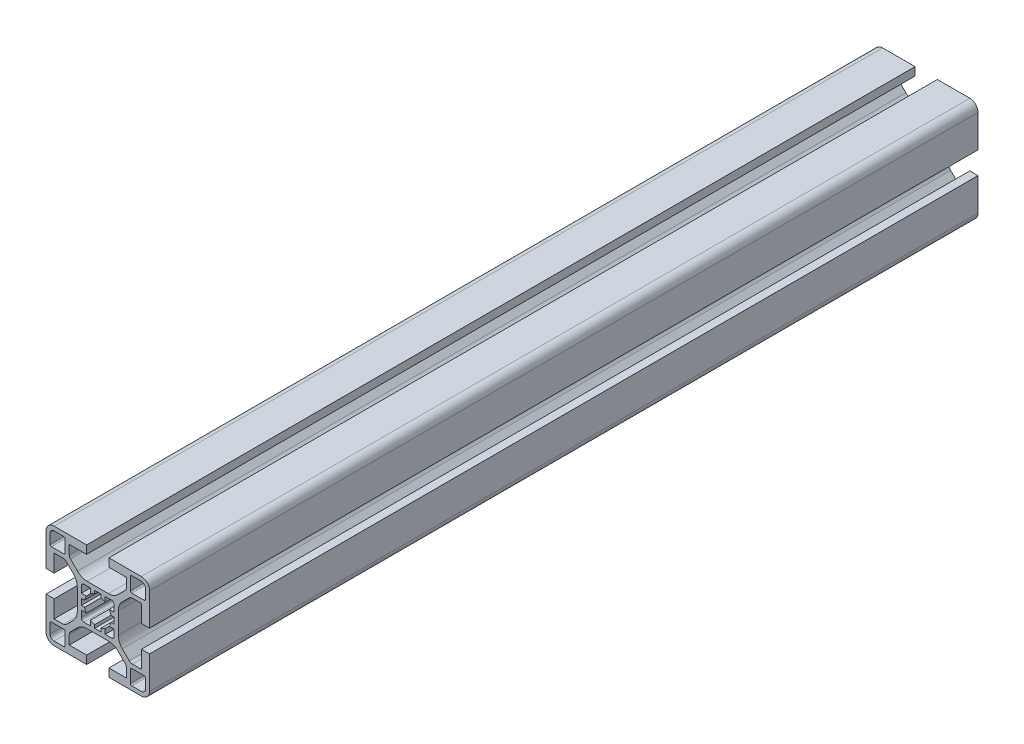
ISO-10303-21;
HEADER;
FILE_DESCRIPTION(('STEP AP214'),'2;1');
FILE_NAME('part.step','',(''),(''),'','','');
FILE_SCHEMA(('AUTOMOTIVE_DESIGN { 1 0 10303 214 1 1 1 1 }'));
ENDSEC;
DATA;
#1=APPLICATION_CONTEXT('core data for automotive mechanical design processes');
#2=APPLICATION_PROTOCOL_DEFINITION('international standard','automotive_design',2000,#1);
#3=PRODUCT_CONTEXT('',#1,'mechanical');
#4=PRODUCT('Part','Part','',(#3));
#5=PRODUCT_RELATED_PRODUCT_CATEGORY('part','',(#4));
#6=PRODUCT_DEFINITION_FORMATION('','',#4);
#7=PRODUCT_DEFINITION_CONTEXT('part definition',#1,'design');
#8=PRODUCT_DEFINITION('design','',#6,#7);
#9=PRODUCT_DEFINITION_SHAPE('','',#8);
#10=(LENGTH_UNIT() NAMED_UNIT(*) SI_UNIT(.MILLI.,.METRE.));
#11=(NAMED_UNIT(*) PLANE_ANGLE_UNIT() SI_UNIT($,.RADIAN.));
#12=(NAMED_UNIT(*) SI_UNIT($,.STERADIAN.) SOLID_ANGLE_UNIT());
#13=UNCERTAINTY_MEASURE_WITH_UNIT(LENGTH_MEASURE(1.E-05),#10,'distance_accuracy_value','');
#14=(GEOMETRIC_REPRESENTATION_CONTEXT(3) GLOBAL_UNCERTAINTY_ASSIGNED_CONTEXT((#13)) GLOBAL_UNIT_ASSIGNED_CONTEXT((#10,
#11,#12)) REPRESENTATION_CONTEXT('',''));
#15=CARTESIAN_POINT('',(0.,0.,0.));
#16=DIRECTION('',(0.,0.,1.));
#17=DIRECTION('',(1.,0.,0.));
#18=AXIS2_PLACEMENT_3D('',#15,#16,#17);
#19=CARTESIAN_POINT('',(0.,0.,-304.8));
#20=DIRECTION('',(0.,0.,1.));
#21=DIRECTION('',(1.,0.,0.));
#22=AXIS2_PLACEMENT_3D('',#19,#20,#21);
#23=CYLINDRICAL_SURFACE('',#22,5.);
#24=CARTESIAN_POINT('',(0.,0.,0.));
#25=DIRECTION('',(0.,0.,1.));
#26=DIRECTION('',(1.,0.,0.));
#27=AXIS2_PLACEMENT_3D('',#24,#25,#26);
#28=CIRCLE('',#27,5.);
#29=CARTESIAN_POINT('',(-4.20832508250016,2.7,0.));
#30=VERTEX_POINT('',#29);
#31=CARTESIAN_POINT('',(-4.88394911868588,1.07100000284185,0.));
#32=VERTEX_POINT('',#31);
#33=EDGE_CURVE('E1928',#30,#32,#28,.T.);
#34=ORIENTED_EDGE('',*,*,#33,.T.);
#35=DIRECTION('',(0.,0.,1.));
#36=VECTOR('',#35,1.);
#37=CARTESIAN_POINT('',(-4.8839491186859,1.07100000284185,-304.8));
#38=LINE('',#37,#36);
#39=CARTESIAN_POINT('',(-4.88394911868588,1.07100000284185,-304.8));
#40=VERTEX_POINT('',#39);
#41=EDGE_CURVE('E11',#32,#40,#38,.F.);
#42=ORIENTED_EDGE('',*,*,#41,.T.);
#43=CARTESIAN_POINT('',(0.,0.,-304.8));
#44=DIRECTION('',(0.,0.,1.));
#45=DIRECTION('',(1.,0.,0.));
#46=AXIS2_PLACEMENT_3D('',#43,#44,#45);
#47=CIRCLE('',#46,5.);
#48=CARTESIAN_POINT('',(-4.20832508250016,2.7,-304.8));
#49=VERTEX_POINT('',#48);
#50=EDGE_CURVE('E1930',#49,#40,#47,.T.);
#51=ORIENTED_EDGE('',*,*,#50,.F.);
#52=DIRECTION('',(0.,0.,1.));
#53=VECTOR('',#52,1.);
#54=CARTESIAN_POINT('',(-4.20832508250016,2.7,-304.8));
#55=LINE('',#54,#53);
#56=EDGE_CURVE('E41',#49,#30,#55,.T.);
#57=ORIENTED_EDGE('',*,*,#56,.T.);
#58=EDGE_LOOP('',(#34,#42,#51,#57));
#59=FACE_BOUND('',#58,.T.);
#60=ADVANCED_FACE('F33',(#59),#23,.F.);
#61=CARTESIAN_POINT('',(-1.15,4.86595314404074,0.));
#62=VERTEX_POINT('',#61);
#63=CARTESIAN_POINT('',(-2.69999999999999,4.20832508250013,0.));
#64=VERTEX_POINT('',#63);
#65=EDGE_CURVE('E1938',#62,#64,#28,.T.);
#66=ORIENTED_EDGE('',*,*,#65,.T.);
#67=DIRECTION('',(0.,0.,1.));
#68=VECTOR('',#67,1.);
#69=CARTESIAN_POINT('',(-2.70000000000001,4.20832508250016,-304.8));
#70=LINE('',#69,#68);
#71=CARTESIAN_POINT('',(-2.70000000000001,4.20832508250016,-304.8));
#72=VERTEX_POINT('',#71);
#73=EDGE_CURVE('E1921',#64,#72,#70,.F.);
#74=ORIENTED_EDGE('',*,*,#73,.T.);
#75=CARTESIAN_POINT('',(-1.15,4.86595314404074,-304.8));
#76=VERTEX_POINT('',#75);
#77=EDGE_CURVE('E1978',#76,#72,#47,.T.);
#78=ORIENTED_EDGE('',*,*,#77,.F.);
#79=DIRECTION('',(0.,0.,1.));
#80=VECTOR('',#79,1.);
#81=CARTESIAN_POINT('',(-1.15,4.86595314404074,-304.8));
#82=LINE('',#81,#80);
#83=EDGE_CURVE('E1918',#76,#62,#82,.T.);
#84=ORIENTED_EDGE('',*,*,#83,.T.);
#85=EDGE_LOOP('',(#66,#74,#78,#84));
#86=FACE_BOUND('',#85,.T.);
#87=ADVANCED_FACE('F2000',(#86),#23,.F.);
#88=CARTESIAN_POINT('',(2.70000000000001,4.20832508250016,0.));
#89=VERTEX_POINT('',#88);
#90=CARTESIAN_POINT('',(1.14999999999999,4.86595314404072,0.));
#91=VERTEX_POINT('',#90);
#92=EDGE_CURVE('E1370',#89,#91,#28,.T.);
#93=ORIENTED_EDGE('',*,*,#92,.T.);
#94=DIRECTION('',(0.,0.,1.));
#95=VECTOR('',#94,1.);
#96=CARTESIAN_POINT('',(1.15,4.86595314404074,-304.8));
#97=LINE('',#96,#95);
#98=CARTESIAN_POINT('',(1.15,4.86595314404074,-304.8));
#99=VERTEX_POINT('',#98);
#100=EDGE_CURVE('E1915',#91,#99,#97,.F.);
#101=ORIENTED_EDGE('',*,*,#100,.T.);
#102=CARTESIAN_POINT('',(2.70000000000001,4.20832508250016,-304.8));
#103=VERTEX_POINT('',#102);
#104=EDGE_CURVE('E1365',#103,#99,#47,.T.);
#105=ORIENTED_EDGE('',*,*,#104,.F.);
#106=DIRECTION('',(0.,0.,1.));
#107=VECTOR('',#106,1.);
#108=CARTESIAN_POINT('',(2.70000000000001,4.20832508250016,-304.8));
#109=LINE('',#108,#107);
#110=EDGE_CURVE('E1912',#103,#89,#109,.T.);
#111=ORIENTED_EDGE('',*,*,#110,.T.);
#112=EDGE_LOOP('',(#93,#101,#105,#111));
#113=FACE_BOUND('',#112,.T.);
#114=ADVANCED_FACE('F1985',(#113),#23,.F.);
#115=CARTESIAN_POINT('',(4.87693487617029,1.10249998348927,0.));
#116=VERTEX_POINT('',#115);
#117=CARTESIAN_POINT('',(4.20832508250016,2.7,0.));
#118=VERTEX_POINT('',#117);
#119=EDGE_CURVE('E1367',#116,#118,#28,.T.);
#120=ORIENTED_EDGE('',*,*,#119,.T.);
#121=DIRECTION('',(0.,0.,1.));
#122=VECTOR('',#121,1.);
#123=CARTESIAN_POINT('',(4.20832508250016,2.7,-304.8));
#124=LINE('',#123,#122);
#125=CARTESIAN_POINT('',(4.20832508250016,2.7,-304.8));
#126=VERTEX_POINT('',#125);
#127=EDGE_CURVE('E1909',#118,#126,#124,.F.);
#128=ORIENTED_EDGE('',*,*,#127,.T.);
#129=CARTESIAN_POINT('',(4.87693487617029,1.10249998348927,-304.8));
#130=VERTEX_POINT('',#129);
#131=EDGE_CURVE('E1361',#130,#126,#47,.T.);
#132=ORIENTED_EDGE('',*,*,#131,.F.);
#133=DIRECTION('',(0.,0.,1.));
#134=VECTOR('',#133,1.);
#135=CARTESIAN_POINT('',(4.87693487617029,1.10249998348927,-304.8));
#136=LINE('',#135,#134);
#137=EDGE_CURVE('E1906',#130,#116,#136,.T.);
#138=ORIENTED_EDGE('',*,*,#137,.T.);
#139=EDGE_LOOP('',(#120,#128,#132,#138));
#140=FACE_BOUND('',#139,.T.);
#141=ADVANCED_FACE('F2057',(#140),#23,.F.);
#142=CARTESIAN_POINT('',(4.20832508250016,-2.7,0.));
#143=VERTEX_POINT('',#142);
#144=CARTESIAN_POINT('',(4.86032236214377,-1.1735699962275,0.));
#145=VERTEX_POINT('',#144);
#146=EDGE_CURVE('E1360',#143,#145,#28,.T.);
#147=ORIENTED_EDGE('',*,*,#146,.T.);
#148=DIRECTION('',(0.,0.,1.));
#149=VECTOR('',#148,1.);
#150=CARTESIAN_POINT('',(4.86032236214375,-1.1735699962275,-304.8));
#151=LINE('',#150,#149);
#152=CARTESIAN_POINT('',(4.86032236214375,-1.1735699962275,-304.8));
#153=VERTEX_POINT('',#152);
#154=EDGE_CURVE('E1903',#145,#153,#151,.F.);
#155=ORIENTED_EDGE('',*,*,#154,.T.);
#156=CARTESIAN_POINT('',(4.20832508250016,-2.7,-304.8));
#157=VERTEX_POINT('',#156);
#158=EDGE_CURVE('E1366',#157,#153,#47,.T.);
#159=ORIENTED_EDGE('',*,*,#158,.F.);
#160=DIRECTION('',(0.,0.,1.));
#161=VECTOR('',#160,1.);
#162=CARTESIAN_POINT('',(4.20832508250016,-2.7,-304.8));
#163=LINE('',#162,#161);
#164=EDGE_CURVE('E1900',#157,#143,#163,.T.);
#165=ORIENTED_EDGE('',*,*,#164,.T.);
#166=EDGE_LOOP('',(#147,#155,#159,#165));
#167=FACE_BOUND('',#166,.T.);
#168=ADVANCED_FACE('F1955',(#167),#23,.F.);
#169=CARTESIAN_POINT('',(1.15,-4.86595314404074,0.));
#170=VERTEX_POINT('',#169);
#171=CARTESIAN_POINT('',(2.70000000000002,-4.20832508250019,0.));
#172=VERTEX_POINT('',#171);
#173=EDGE_CURVE('E1946',#170,#172,#28,.T.);
#174=ORIENTED_EDGE('',*,*,#173,.T.);
#175=DIRECTION('',(0.,0.,1.));
#176=VECTOR('',#175,1.);
#177=CARTESIAN_POINT('',(2.70000000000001,-4.20832508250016,-304.8));
#178=LINE('',#177,#176);
#179=CARTESIAN_POINT('',(2.70000000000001,-4.20832508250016,-304.8));
#180=VERTEX_POINT('',#179);
#181=EDGE_CURVE('E1897',#172,#180,#178,.F.);
#182=ORIENTED_EDGE('',*,*,#181,.T.);
#183=CARTESIAN_POINT('',(1.15,-4.86595314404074,-304.8));
#184=VERTEX_POINT('',#183);
#185=EDGE_CURVE('E1969',#184,#180,#47,.T.);
#186=ORIENTED_EDGE('',*,*,#185,.F.);
#187=DIRECTION('',(0.,0.,1.));
#188=VECTOR('',#187,1.);
#189=CARTESIAN_POINT('',(1.15,-4.86595314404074,-304.8));
#190=LINE('',#189,#188);
#191=EDGE_CURVE('E1894',#184,#170,#190,.T.);
#192=ORIENTED_EDGE('',*,*,#191,.T.);
#193=EDGE_LOOP('',(#174,#182,#186,#192));
#194=FACE_BOUND('',#193,.T.);
#195=ADVANCED_FACE('F2047',(#194),#23,.F.);
#196=CARTESIAN_POINT('',(-2.70000000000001,-4.20832508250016,0.));
#197=VERTEX_POINT('',#196);
#198=CARTESIAN_POINT('',(-1.15,-4.86595314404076,0.));
#199=VERTEX_POINT('',#198);
#200=EDGE_CURVE('E1942',#197,#199,#28,.T.);
#201=ORIENTED_EDGE('',*,*,#200,.T.);
#202=DIRECTION('',(0.,0.,1.));
#203=VECTOR('',#202,1.);
#204=CARTESIAN_POINT('',(-1.15,-4.86595314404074,-304.8));
#205=LINE('',#204,#203);
#206=CARTESIAN_POINT('',(-1.15,-4.86595314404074,-304.8));
#207=VERTEX_POINT('',#206);
#208=EDGE_CURVE('E1891',#199,#207,#205,.F.);
#209=ORIENTED_EDGE('',*,*,#208,.T.);
#210=CARTESIAN_POINT('',(-2.70000000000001,-4.20832508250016,-304.8));
#211=VERTEX_POINT('',#210);
#212=EDGE_CURVE('E1971',#211,#207,#47,.T.);
#213=ORIENTED_EDGE('',*,*,#212,.F.);
#214=DIRECTION('',(0.,0.,1.));
#215=VECTOR('',#214,1.);
#216=CARTESIAN_POINT('',(-2.70000000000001,-4.20832508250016,-304.8));
#217=LINE('',#216,#215);
#218=EDGE_CURVE('E1888',#211,#197,#217,.T.);
#219=ORIENTED_EDGE('',*,*,#218,.T.);
#220=EDGE_LOOP('',(#201,#209,#213,#219));
#221=FACE_BOUND('',#220,.T.);
#222=ADVANCED_FACE('F2038',(#221),#23,.F.);
#223=CARTESIAN_POINT('',(-16.05,-4.1,-304.8));
#224=DIRECTION('',(0.,1.,0.));
#225=DIRECTION('',(0.,0.,1.));
#226=AXIS2_PLACEMENT_3D('',#223,#224,#225);
#227=PLANE('',#226);
#228=DIRECTION('',(-1.,0.,0.));
#229=VECTOR('',#228,1.);
#230=CARTESIAN_POINT('',(-16.05,-4.1,0.));
#231=LINE('',#230,#229);
#232=CARTESIAN_POINT('',(-16.05,-4.1,0.));
#233=VERTEX_POINT('',#232);
#234=CARTESIAN_POINT('',(-19.05,-4.1,0.));
#235=VERTEX_POINT('',#234);
#236=EDGE_CURVE('E1364',#233,#235,#231,.T.);
#237=ORIENTED_EDGE('',*,*,#236,.F.);
#238=DIRECTION('',(0.,0.,1.));
#239=VECTOR('',#238,1.);
#240=CARTESIAN_POINT('',(-16.05,-4.1,-304.8));
#241=LINE('',#240,#239);
#242=CARTESIAN_POINT('',(-16.05,-4.1,-304.8));
#243=VERTEX_POINT('',#242);
#244=EDGE_CURVE('E1755',#243,#233,#241,.T.);
#245=ORIENTED_EDGE('',*,*,#244,.F.);
#246=DIRECTION('',(-1.,0.,0.));
#247=VECTOR('',#246,1.);
#248=CARTESIAN_POINT('',(-16.05,-4.1,-304.8));
#249=LINE('',#248,#247);
#250=CARTESIAN_POINT('',(-19.05,-4.1,-304.8));
#251=VERTEX_POINT('',#250);
#252=EDGE_CURVE('E1371',#243,#251,#249,.T.);
#253=ORIENTED_EDGE('',*,*,#252,.T.);
#254=DIRECTION('',(0.,0.,1.));
#255=VECTOR('',#254,1.);
#256=CARTESIAN_POINT('',(-19.05,-4.1,-304.8));
#257=LINE('',#256,#255);
#258=EDGE_CURVE('E1564',#251,#235,#257,.T.);
#259=ORIENTED_EDGE('',*,*,#258,.T.);
#260=EDGE_LOOP('',(#237,#245,#253,#259));
#261=FACE_BOUND('',#260,.T.);
#262=ADVANCED_FACE('F35',(#261),#227,.T.);
#263=CARTESIAN_POINT('',(-16.05,-10.5,-304.8));
#264=DIRECTION('',(1.,0.,0.));
#265=DIRECTION('',(0.,0.,-1.));
#266=AXIS2_PLACEMENT_3D('',#263,#264,#265);
#267=PLANE('',#266);
#268=DIRECTION('',(0.,1.,0.));
#269=VECTOR('',#268,1.);
#270=CARTESIAN_POINT('',(-16.05,-10.5,0.));
#271=LINE('',#270,#269);
#272=CARTESIAN_POINT('',(-16.05,-10.5,0.));
#273=VERTEX_POINT('',#272);
#274=EDGE_CURVE('E1375',#273,#233,#271,.T.);
#275=ORIENTED_EDGE('',*,*,#274,.F.);
#276=DIRECTION('',(0.,0.,1.));
#277=VECTOR('',#276,1.);
#278=CARTESIAN_POINT('',(-16.05,-10.5,-304.8));
#279=LINE('',#278,#277);
#280=CARTESIAN_POINT('',(-16.05,-10.5,-304.8));
#281=VERTEX_POINT('',#280);
#282=EDGE_CURVE('E1758',#281,#273,#279,.T.);
#283=ORIENTED_EDGE('',*,*,#282,.F.);
#284=DIRECTION('',(0.,1.,0.));
#285=VECTOR('',#284,1.);
#286=CARTESIAN_POINT('',(-16.05,-10.5,-304.8));
#287=LINE('',#286,#285);
#288=EDGE_CURVE('E1561',#281,#243,#287,.T.);
#289=ORIENTED_EDGE('',*,*,#288,.T.);
#290=ORIENTED_EDGE('',*,*,#244,.T.);
#291=EDGE_LOOP('',(#275,#283,#289,#290));
#292=FACE_BOUND('',#291,.T.);
#293=ADVANCED_FACE('F2052',(#292),#267,.T.);
#294=CARTESIAN_POINT('',(-12.7127,-10.5,-304.8));
#295=DIRECTION('',(0.,1.,0.));
#296=DIRECTION('',(0.,0.,1.));
#297=AXIS2_PLACEMENT_3D('',#294,#295,#296);
#298=PLANE('',#297);
#299=DIRECTION('',(-1.,0.,0.));
#300=VECTOR('',#299,1.);
#301=CARTESIAN_POINT('',(-12.7127,-10.5,0.));
#302=LINE('',#301,#300);
#303=CARTESIAN_POINT('',(-12.7127,-10.5,0.));
#304=VERTEX_POINT('',#303);
#305=EDGE_CURVE('E1750',#304,#273,#302,.T.);
#306=ORIENTED_EDGE('',*,*,#305,.F.);
#307=DIRECTION('',(0.,0.,1.));
#308=VECTOR('',#307,1.);
#309=CARTESIAN_POINT('',(-12.7127,-10.5,-304.8));
#310=LINE('',#309,#308);
#311=CARTESIAN_POINT('',(-12.7127,-10.5,-304.8));
#312=VERTEX_POINT('',#311);
#313=EDGE_CURVE('E1760',#312,#304,#310,.T.);
#314=ORIENTED_EDGE('',*,*,#313,.F.);
#315=DIRECTION('',(-1.,0.,0.));
#316=VECTOR('',#315,1.);
#317=CARTESIAN_POINT('',(-12.7127,-10.5,-304.8));
#318=LINE('',#317,#316);
#319=EDGE_CURVE('E1558',#312,#281,#318,.T.);
#320=ORIENTED_EDGE('',*,*,#319,.T.);
#321=ORIENTED_EDGE('',*,*,#282,.T.);
#322=EDGE_LOOP('',(#306,#314,#320,#321));
#323=FACE_BOUND('',#322,.T.);
#324=ADVANCED_FACE('F2248',(#323),#298,.T.);
#325=CARTESIAN_POINT('',(-12.7126614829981,-8.90019364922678,-304.8));
#326=DIRECTION('',(0.,0.,1.));
#327=DIRECTION('',(1.,0.,0.));
#328=AXIS2_PLACEMENT_3D('',#325,#326,#327);
#329=CYLINDRICAL_SURFACE('',#328,1.59980635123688);
#330=CARTESIAN_POINT('',(-12.7126614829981,-8.90019364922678,0.));
#331=DIRECTION('',(0.,0.,-1.));
#332=DIRECTION('',(-1.,0.,0.));
#333=AXIS2_PLACEMENT_3D('',#330,#331,#332);
#334=CIRCLE('',#333,1.59980635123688);
#335=CARTESIAN_POINT('',(-11.58135,-10.03135,0.));
#336=VERTEX_POINT('',#335);
#337=EDGE_CURVE('E1747',#336,#304,#334,.T.);
#338=ORIENTED_EDGE('',*,*,#337,.F.);
#339=DIRECTION('',(0.,0.,1.));
#340=VECTOR('',#339,1.);
#341=CARTESIAN_POINT('',(-11.58135,-10.03135,-304.8));
#342=LINE('',#341,#340);
#343=CARTESIAN_POINT('',(-11.58135,-10.03135,-304.8));
#344=VERTEX_POINT('',#343);
#345=EDGE_CURVE('E1762',#344,#336,#342,.T.);
#346=ORIENTED_EDGE('',*,*,#345,.F.);
#347=CARTESIAN_POINT('',(-12.7126614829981,-8.90019364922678,-304.8));
#348=DIRECTION('',(0.,0.,-1.));
#349=DIRECTION('',(-1.,0.,0.));
#350=AXIS2_PLACEMENT_3D('',#347,#348,#349);
#351=CIRCLE('',#350,1.59980635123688);
#352=EDGE_CURVE('E1555',#344,#312,#351,.T.);
#353=ORIENTED_EDGE('',*,*,#352,.T.);
#354=ORIENTED_EDGE('',*,*,#313,.T.);
#355=EDGE_LOOP('',(#338,#346,#353,#354));
#356=FACE_BOUND('',#355,.T.);
#357=ADVANCED_FACE('F2253',(#356),#329,.F.);
#358=CARTESIAN_POINT('',(-9.01446500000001,-7.464465,-304.8));
#359=DIRECTION('',(-0.707106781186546,0.707106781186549,0.));
#360=DIRECTION('',(-0.707106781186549,-0.707106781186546,0.));
#361=AXIS2_PLACEMENT_3D('',#358,#359,#360);
#362=PLANE('',#361);
#363=DIRECTION('',(-0.707106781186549,-0.707106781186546,0.));
#364=VECTOR('',#363,1.);
#365=CARTESIAN_POINT('',(-9.01446500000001,-7.464465,0.));
#366=LINE('',#365,#364);
#367=CARTESIAN_POINT('',(-9.01446500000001,-7.464465,0.));
#368=VERTEX_POINT('',#367);
#369=EDGE_CURVE('E1744',#368,#336,#366,.T.);
#370=ORIENTED_EDGE('',*,*,#369,.F.);
#371=DIRECTION('',(0.,0.,1.));
#372=VECTOR('',#371,1.);
#373=CARTESIAN_POINT('',(-9.01446500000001,-7.464465,-304.8));
#374=LINE('',#373,#372);
#375=CARTESIAN_POINT('',(-9.01446500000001,-7.464465,-304.8));
#376=VERTEX_POINT('',#375);
#377=EDGE_CURVE('E1764',#376,#368,#374,.T.);
#378=ORIENTED_EDGE('',*,*,#377,.F.);
#379=DIRECTION('',(-0.707106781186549,-0.707106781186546,0.));
#380=VECTOR('',#379,1.);
#381=CARTESIAN_POINT('',(-9.01446500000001,-7.464465,-304.8));
#382=LINE('',#381,#380);
#383=EDGE_CURVE('E1552',#376,#344,#382,.T.);
#384=ORIENTED_EDGE('',*,*,#383,.T.);
#385=ORIENTED_EDGE('',*,*,#345,.T.);
#386=EDGE_LOOP('',(#370,#378,#384,#385));
#387=FACE_BOUND('',#386,.T.);
#388=ADVANCED_FACE('F2256',(#387),#362,.T.);
#389=CARTESIAN_POINT('',(-12.5500101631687,-3.92892797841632,-304.8));
#390=DIRECTION('',(0.,0.,1.));
#391=DIRECTION('',(1.,0.,0.));
#392=AXIS2_PLACEMENT_3D('',#389,#390,#391);
#393=CYLINDRICAL_SURFACE('',#392,5.00001016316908);
#394=CARTESIAN_POINT('',(-12.5500101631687,-3.92892797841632,0.));
#395=DIRECTION('',(0.,0.,-1.));
#396=DIRECTION('',(-1.,0.,0.));
#397=AXIS2_PLACEMENT_3D('',#394,#395,#396);
#398=CIRCLE('',#397,5.00001016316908);
#399=CARTESIAN_POINT('',(-7.55,-3.92893,0.));
#400=VERTEX_POINT('',#399);
#401=EDGE_CURVE('E1741',#400,#368,#398,.T.);
#402=ORIENTED_EDGE('',*,*,#401,.F.);
#403=DIRECTION('',(0.,0.,1.));
#404=VECTOR('',#403,1.);
#405=CARTESIAN_POINT('',(-7.55,-3.92893,-304.8));
#406=LINE('',#405,#404);
#407=CARTESIAN_POINT('',(-7.55,-3.92893,-304.8));
#408=VERTEX_POINT('',#407);
#409=EDGE_CURVE('E1766',#408,#400,#406,.T.);
#410=ORIENTED_EDGE('',*,*,#409,.F.);
#411=CARTESIAN_POINT('',(-12.5500101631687,-3.92892797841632,-304.8));
#412=DIRECTION('',(0.,0.,-1.));
#413=DIRECTION('',(-1.,0.,0.));
#414=AXIS2_PLACEMENT_3D('',#411,#412,#413);
#415=CIRCLE('',#414,5.00001016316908);
#416=EDGE_CURVE('E1549',#408,#376,#415,.T.);
#417=ORIENTED_EDGE('',*,*,#416,.T.);
#418=ORIENTED_EDGE('',*,*,#377,.T.);
#419=EDGE_LOOP('',(#402,#410,#417,#418));
#420=FACE_BOUND('',#419,.T.);
#421=ADVANCED_FACE('F2261',(#420),#393,.F.);
#422=CARTESIAN_POINT('',(-7.55,3.92893,-304.8));
#423=DIRECTION('',(-1.,0.,0.));
#424=DIRECTION('',(0.,0.,1.));
#425=AXIS2_PLACEMENT_3D('',#422,#423,#424);
#426=PLANE('',#425);
#427=DIRECTION('',(0.,-1.,0.));
#428=VECTOR('',#427,1.);
#429=CARTESIAN_POINT('',(-7.55,3.92893,0.));
#430=LINE('',#429,#428);
#431=CARTESIAN_POINT('',(-7.55,3.92893,0.));
#432=VERTEX_POINT('',#431);
#433=EDGE_CURVE('E1738',#432,#400,#430,.T.);
#434=ORIENTED_EDGE('',*,*,#433,.F.);
#435=DIRECTION('',(0.,0.,1.));
#436=VECTOR('',#435,1.);
#437=CARTESIAN_POINT('',(-7.55,3.92893,-304.8));
#438=LINE('',#437,#436);
#439=CARTESIAN_POINT('',(-7.55,3.92893,-304.8));
#440=VERTEX_POINT('',#439);
#441=EDGE_CURVE('E1768',#440,#432,#438,.T.);
#442=ORIENTED_EDGE('',*,*,#441,.F.);
#443=DIRECTION('',(0.,-1.,0.));
#444=VECTOR('',#443,1.);
#445=CARTESIAN_POINT('',(-7.55,3.92893,-304.8));
#446=LINE('',#445,#444);
#447=EDGE_CURVE('E1546',#440,#408,#446,.T.);
#448=ORIENTED_EDGE('',*,*,#447,.T.);
#449=ORIENTED_EDGE('',*,*,#409,.T.);
#450=EDGE_LOOP('',(#434,#442,#448,#449));
#451=FACE_BOUND('',#450,.T.);
#452=ADVANCED_FACE('F2264',(#451),#426,.T.);
#453=CARTESIAN_POINT('',(-12.5500101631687,3.92892797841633,-304.8));
#454=DIRECTION('',(0.,0.,1.));
#455=DIRECTION('',(1.,0.,0.));
#456=AXIS2_PLACEMENT_3D('',#453,#454,#455);
#457=CYLINDRICAL_SURFACE('',#456,5.00001016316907);
#458=CARTESIAN_POINT('',(-12.5500101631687,3.92892797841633,0.));
#459=DIRECTION('',(0.,0.,-1.));
#460=DIRECTION('',(-1.,0.,0.));
#461=AXIS2_PLACEMENT_3D('',#458,#459,#460);
#462=CIRCLE('',#461,5.00001016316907);
#463=CARTESIAN_POINT('',(-9.01446500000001,7.464465,0.));
#464=VERTEX_POINT('',#463);
#465=EDGE_CURVE('E1735',#464,#432,#462,.T.);
#466=ORIENTED_EDGE('',*,*,#465,.F.);
#467=DIRECTION('',(0.,0.,1.));
#468=VECTOR('',#467,1.);
#469=CARTESIAN_POINT('',(-9.01446500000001,7.464465,-304.8));
#470=LINE('',#469,#468);
#471=CARTESIAN_POINT('',(-9.01446500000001,7.464465,-304.8));
#472=VERTEX_POINT('',#471);
#473=EDGE_CURVE('E1770',#472,#464,#470,.T.);
#474=ORIENTED_EDGE('',*,*,#473,.F.);
#475=CARTESIAN_POINT('',(-12.5500101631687,3.92892797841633,-304.8));
#476=DIRECTION('',(0.,0.,-1.));
#477=DIRECTION('',(-1.,0.,0.));
#478=AXIS2_PLACEMENT_3D('',#475,#476,#477);
#479=CIRCLE('',#478,5.00001016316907);
#480=EDGE_CURVE('E1543',#472,#440,#479,.T.);
#481=ORIENTED_EDGE('',*,*,#480,.T.);
#482=ORIENTED_EDGE('',*,*,#441,.T.);
#483=EDGE_LOOP('',(#466,#474,#481,#482));
#484=FACE_BOUND('',#483,.T.);
#485=ADVANCED_FACE('F2269',(#484),#457,.F.);
#486=CARTESIAN_POINT('',(-11.58135,10.03135,-304.8));
#487=DIRECTION('',(-0.707106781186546,-0.707106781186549,0.));
#488=DIRECTION('',(0.707106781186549,-0.707106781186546,0.));
#489=AXIS2_PLACEMENT_3D('',#486,#487,#488);
#490=PLANE('',#489);
#491=DIRECTION('',(0.707106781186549,-0.707106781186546,0.));
#492=VECTOR('',#491,1.);
#493=CARTESIAN_POINT('',(-11.58135,10.03135,0.));
#494=LINE('',#493,#492);
#495=CARTESIAN_POINT('',(-11.58135,10.03135,0.));
#496=VERTEX_POINT('',#495);
#497=EDGE_CURVE('E1732',#496,#464,#494,.T.);
#498=ORIENTED_EDGE('',*,*,#497,.F.);
#499=DIRECTION('',(0.,0.,1.));
#500=VECTOR('',#499,1.);
#501=CARTESIAN_POINT('',(-11.58135,10.03135,-304.8));
#502=LINE('',#501,#500);
#503=CARTESIAN_POINT('',(-11.58135,10.03135,-304.8));
#504=VERTEX_POINT('',#503);
#505=EDGE_CURVE('E1772',#504,#496,#502,.T.);
#506=ORIENTED_EDGE('',*,*,#505,.F.);
#507=DIRECTION('',(0.707106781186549,-0.707106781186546,0.));
#508=VECTOR('',#507,1.);
#509=CARTESIAN_POINT('',(-11.58135,10.03135,-304.8));
#510=LINE('',#509,#508);
#511=EDGE_CURVE('E1540',#504,#472,#510,.T.);
#512=ORIENTED_EDGE('',*,*,#511,.T.);
#513=ORIENTED_EDGE('',*,*,#473,.T.);
#514=EDGE_LOOP('',(#498,#506,#512,#513));
#515=FACE_BOUND('',#514,.T.);
#516=ADVANCED_FACE('F2272',(#515),#490,.T.);
#517=CARTESIAN_POINT('',(-12.7126614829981,8.90019364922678,-304.8));
#518=DIRECTION('',(0.,0.,1.));
#519=DIRECTION('',(1.,0.,0.));
#520=AXIS2_PLACEMENT_3D('',#517,#518,#519);
#521=CYLINDRICAL_SURFACE('',#520,1.59980635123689);
#522=CARTESIAN_POINT('',(-12.7126614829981,8.90019364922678,0.));
#523=DIRECTION('',(0.,0.,-1.));
#524=DIRECTION('',(-1.,0.,0.));
#525=AXIS2_PLACEMENT_3D('',#522,#523,#524);
#526=CIRCLE('',#525,1.59980635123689);
#527=CARTESIAN_POINT('',(-12.7127,10.5,0.));
#528=VERTEX_POINT('',#527);
#529=EDGE_CURVE('E1729',#528,#496,#526,.T.);
#530=ORIENTED_EDGE('',*,*,#529,.F.);
#531=DIRECTION('',(0.,0.,1.));
#532=VECTOR('',#531,1.);
#533=CARTESIAN_POINT('',(-12.7127,10.5,-304.8));
#534=LINE('',#533,#532);
#535=CARTESIAN_POINT('',(-12.7127,10.5,-304.8));
#536=VERTEX_POINT('',#535);
#537=EDGE_CURVE('E1774',#536,#528,#534,.T.);
#538=ORIENTED_EDGE('',*,*,#537,.F.);
#539=CARTESIAN_POINT('',(-12.7126614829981,8.90019364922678,-304.8));
#540=DIRECTION('',(0.,0.,-1.));
#541=DIRECTION('',(-1.,0.,0.));
#542=AXIS2_PLACEMENT_3D('',#539,#540,#541);
#543=CIRCLE('',#542,1.59980635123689);
#544=EDGE_CURVE('E1537',#536,#504,#543,.T.);
#545=ORIENTED_EDGE('',*,*,#544,.T.);
#546=ORIENTED_EDGE('',*,*,#505,.T.);
#547=EDGE_LOOP('',(#530,#538,#545,#546));
#548=FACE_BOUND('',#547,.T.);
#549=ADVANCED_FACE('F2277',(#548),#521,.F.);
#550=CARTESIAN_POINT('',(-16.05,10.5,-304.8));
#551=DIRECTION('',(0.,-1.,0.));
#552=DIRECTION('',(0.,0.,-1.));
#553=AXIS2_PLACEMENT_3D('',#550,#551,#552);
#554=PLANE('',#553);
#555=DIRECTION('',(1.,0.,0.));
#556=VECTOR('',#555,1.);
#557=CARTESIAN_POINT('',(-16.05,10.5,0.));
#558=LINE('',#557,#556);
#559=CARTESIAN_POINT('',(-16.05,10.5,0.));
#560=VERTEX_POINT('',#559);
#561=EDGE_CURVE('E1726',#560,#528,#558,.T.);
#562=ORIENTED_EDGE('',*,*,#561,.F.);
#563=DIRECTION('',(0.,0.,1.));
#564=VECTOR('',#563,1.);
#565=CARTESIAN_POINT('',(-16.05,10.5,-304.8));
#566=LINE('',#565,#564);
#567=CARTESIAN_POINT('',(-16.05,10.5,-304.8));
#568=VERTEX_POINT('',#567);
#569=EDGE_CURVE('E1776',#568,#560,#566,.T.);
#570=ORIENTED_EDGE('',*,*,#569,.F.);
#571=DIRECTION('',(1.,0.,0.));
#572=VECTOR('',#571,1.);
#573=CARTESIAN_POINT('',(-16.05,10.5,-304.8));
#574=LINE('',#573,#572);
#575=EDGE_CURVE('E1534',#568,#536,#574,.T.);
#576=ORIENTED_EDGE('',*,*,#575,.T.);
#577=ORIENTED_EDGE('',*,*,#537,.T.);
#578=EDGE_LOOP('',(#562,#570,#576,#577));
#579=FACE_BOUND('',#578,.T.);
#580=ADVANCED_FACE('F2280',(#579),#554,.T.);
#581=CARTESIAN_POINT('',(-16.05,4.1,-304.8));
#582=DIRECTION('',(1.,0.,0.));
#583=DIRECTION('',(0.,0.,-1.));
#584=AXIS2_PLACEMENT_3D('',#581,#582,#583);
#585=PLANE('',#584);
#586=DIRECTION('',(0.,1.,0.));
#587=VECTOR('',#586,1.);
#588=CARTESIAN_POINT('',(-16.05,4.1,0.));
#589=LINE('',#588,#587);
#590=CARTESIAN_POINT('',(-16.05,4.1,0.));
#591=VERTEX_POINT('',#590);
#592=EDGE_CURVE('E1723',#591,#560,#589,.T.);
#593=ORIENTED_EDGE('',*,*,#592,.F.);
#594=DIRECTION('',(0.,0.,1.));
#595=VECTOR('',#594,1.);
#596=CARTESIAN_POINT('',(-16.05,4.1,-304.8));
#597=LINE('',#596,#595);
#598=CARTESIAN_POINT('',(-16.05,4.1,-304.8));
#599=VERTEX_POINT('',#598);
#600=EDGE_CURVE('E1778',#599,#591,#597,.T.);
#601=ORIENTED_EDGE('',*,*,#600,.F.);
#602=DIRECTION('',(0.,1.,0.));
#603=VECTOR('',#602,1.);
#604=CARTESIAN_POINT('',(-16.05,4.1,-304.8));
#605=LINE('',#604,#603);
#606=EDGE_CURVE('E1531',#599,#568,#605,.T.);
#607=ORIENTED_EDGE('',*,*,#606,.T.);
#608=ORIENTED_EDGE('',*,*,#569,.T.);
#609=EDGE_LOOP('',(#593,#601,#607,#608));
#610=FACE_BOUND('',#609,.T.);
#611=ADVANCED_FACE('F2285',(#610),#585,.T.);
#612=CARTESIAN_POINT('',(-19.05,4.1,-304.8));
#613=DIRECTION('',(0.,-1.,0.));
#614=DIRECTION('',(0.,0.,-1.));
#615=AXIS2_PLACEMENT_3D('',#612,#613,#614);
#616=PLANE('',#615);
#617=DIRECTION('',(1.,0.,0.));
#618=VECTOR('',#617,1.);
#619=CARTESIAN_POINT('',(-19.05,4.1,0.));
#620=LINE('',#619,#618);
#621=CARTESIAN_POINT('',(-19.05,4.1,0.));
#622=VERTEX_POINT('',#621);
#623=EDGE_CURVE('E1720',#622,#591,#620,.T.);
#624=ORIENTED_EDGE('',*,*,#623,.F.);
#625=DIRECTION('',(0.,0.,1.));
#626=VECTOR('',#625,1.);
#627=CARTESIAN_POINT('',(-19.05,4.1,-304.8));
#628=LINE('',#627,#626);
#629=CARTESIAN_POINT('',(-19.05,4.1,-304.8));
#630=VERTEX_POINT('',#629);
#631=EDGE_CURVE('E1780',#630,#622,#628,.T.);
#632=ORIENTED_EDGE('',*,*,#631,.F.);
#633=DIRECTION('',(1.,0.,0.));
#634=VECTOR('',#633,1.);
#635=CARTESIAN_POINT('',(-19.05,4.1,-304.8));
#636=LINE('',#635,#634);
#637=EDGE_CURVE('E1528',#630,#599,#636,.T.);
#638=ORIENTED_EDGE('',*,*,#637,.T.);
#639=ORIENTED_EDGE('',*,*,#600,.T.);
#640=EDGE_LOOP('',(#624,#632,#638,#639));
#641=FACE_BOUND('',#640,.T.);
#642=ADVANCED_FACE('F2288',(#641),#616,.T.);
#643=CARTESIAN_POINT('',(-19.05,16.05,-304.8));
#644=DIRECTION('',(-1.,0.,0.));
#645=DIRECTION('',(0.,0.,1.));
#646=AXIS2_PLACEMENT_3D('',#643,#644,#645);
#647=PLANE('',#646);
#648=DIRECTION('',(0.,-1.,0.));
#649=VECTOR('',#648,1.);
#650=CARTESIAN_POINT('',(-19.05,16.05,0.));
#651=LINE('',#650,#649);
#652=CARTESIAN_POINT('',(-19.05,16.05,0.));
#653=VERTEX_POINT('',#652);
#654=EDGE_CURVE('E1717',#653,#622,#651,.T.);
#655=ORIENTED_EDGE('',*,*,#654,.F.);
#656=DIRECTION('',(0.,0.,1.));
#657=VECTOR('',#656,1.);
#658=CARTESIAN_POINT('',(-19.05,16.05,-304.8));
#659=LINE('',#658,#657);
#660=CARTESIAN_POINT('',(-19.05,16.05,-304.8));
#661=VERTEX_POINT('',#660);
#662=EDGE_CURVE('E1782',#661,#653,#659,.T.);
#663=ORIENTED_EDGE('',*,*,#662,.F.);
#664=DIRECTION('',(0.,-1.,0.));
#665=VECTOR('',#664,1.);
#666=CARTESIAN_POINT('',(-19.05,16.05,-304.8));
#667=LINE('',#666,#665);
#668=EDGE_CURVE('E1525',#661,#630,#667,.T.);
#669=ORIENTED_EDGE('',*,*,#668,.T.);
#670=ORIENTED_EDGE('',*,*,#631,.T.);
#671=EDGE_LOOP('',(#655,#663,#669,#670));
#672=FACE_BOUND('',#671,.T.);
#673=ADVANCED_FACE('F2293',(#672),#647,.T.);
#674=CARTESIAN_POINT('',(-16.05,16.05,-304.8));
#675=DIRECTION('',(0.,0.,1.));
#676=DIRECTION('',(1.,0.,0.));
#677=AXIS2_PLACEMENT_3D('',#674,#675,#676);
#678=CYLINDRICAL_SURFACE('',#677,3.);
#679=CARTESIAN_POINT('',(-16.05,16.05,0.));
#680=DIRECTION('',(0.,0.,1.));
#681=DIRECTION('',(1.,0.,0.));
#682=AXIS2_PLACEMENT_3D('',#679,#680,#681);
#683=CIRCLE('',#682,3.);
#684=CARTESIAN_POINT('',(-16.05,19.05,0.));
#685=VERTEX_POINT('',#684);
#686=EDGE_CURVE('E1714',#685,#653,#683,.T.);
#687=ORIENTED_EDGE('',*,*,#686,.F.);
#688=DIRECTION('',(0.,0.,1.));
#689=VECTOR('',#688,1.);
#690=CARTESIAN_POINT('',(-16.05,19.05,-304.8));
#691=LINE('',#690,#689);
#692=CARTESIAN_POINT('',(-16.05,19.05,-304.8));
#693=VERTEX_POINT('',#692);
#694=EDGE_CURVE('E1784',#693,#685,#691,.T.);
#695=ORIENTED_EDGE('',*,*,#694,.F.);
#696=CARTESIAN_POINT('',(-16.05,16.05,-304.8));
#697=DIRECTION('',(0.,0.,1.));
#698=DIRECTION('',(1.,0.,0.));
#699=AXIS2_PLACEMENT_3D('',#696,#697,#698);
#700=CIRCLE('',#699,3.);
#701=EDGE_CURVE('E1522',#693,#661,#700,.T.);
#702=ORIENTED_EDGE('',*,*,#701,.T.);
#703=ORIENTED_EDGE('',*,*,#662,.T.);
#704=EDGE_LOOP('',(#687,#695,#702,#703));
#705=FACE_BOUND('',#704,.T.);
#706=ADVANCED_FACE('F2296',(#705),#678,.T.);
#707=CARTESIAN_POINT('',(-4.1,19.05,-304.8));
#708=DIRECTION('',(0.,1.,0.));
#709=DIRECTION('',(0.,0.,1.));
#710=AXIS2_PLACEMENT_3D('',#707,#708,#709);
#711=PLANE('',#710);
#712=DIRECTION('',(-1.,0.,0.));
#713=VECTOR('',#712,1.);
#714=CARTESIAN_POINT('',(-4.1,19.05,0.));
#715=LINE('',#714,#713);
#716=CARTESIAN_POINT('',(-4.1,19.05,0.));
#717=VERTEX_POINT('',#716);
#718=EDGE_CURVE('E1711',#717,#685,#715,.T.);
#719=ORIENTED_EDGE('',*,*,#718,.F.);
#720=DIRECTION('',(0.,0.,1.));
#721=VECTOR('',#720,1.);
#722=CARTESIAN_POINT('',(-4.1,19.05,-304.8));
#723=LINE('',#722,#721);
#724=CARTESIAN_POINT('',(-4.1,19.05,-304.8));
#725=VERTEX_POINT('',#724);
#726=EDGE_CURVE('E1786',#725,#717,#723,.T.);
#727=ORIENTED_EDGE('',*,*,#726,.F.);
#728=DIRECTION('',(-1.,0.,0.));
#729=VECTOR('',#728,1.);
#730=CARTESIAN_POINT('',(-4.1,19.05,-304.8));
#731=LINE('',#730,#729);
#732=EDGE_CURVE('E1519',#725,#693,#731,.T.);
#733=ORIENTED_EDGE('',*,*,#732,.T.);
#734=ORIENTED_EDGE('',*,*,#694,.T.);
#735=EDGE_LOOP('',(#719,#727,#733,#734));
#736=FACE_BOUND('',#735,.T.);
#737=ADVANCED_FACE('F2301',(#736),#711,.T.);
#738=CARTESIAN_POINT('',(-4.1,16.05,-304.8));
#739=DIRECTION('',(1.,0.,0.));
#740=DIRECTION('',(0.,0.,-1.));
#741=AXIS2_PLACEMENT_3D('',#738,#739,#740);
#742=PLANE('',#741);
#743=DIRECTION('',(0.,1.,0.));
#744=VECTOR('',#743,1.);
#745=CARTESIAN_POINT('',(-4.1,16.05,0.));
#746=LINE('',#745,#744);
#747=CARTESIAN_POINT('',(-4.1,16.05,0.));
#748=VERTEX_POINT('',#747);
#749=EDGE_CURVE('E1708',#748,#717,#746,.T.);
#750=ORIENTED_EDGE('',*,*,#749,.F.);
#751=DIRECTION('',(0.,0.,1.));
#752=VECTOR('',#751,1.);
#753=CARTESIAN_POINT('',(-4.1,16.05,-304.8));
#754=LINE('',#753,#752);
#755=CARTESIAN_POINT('',(-4.1,16.05,-304.8));
#756=VERTEX_POINT('',#755);
#757=EDGE_CURVE('E1788',#756,#748,#754,.T.);
#758=ORIENTED_EDGE('',*,*,#757,.F.);
#759=DIRECTION('',(0.,1.,0.));
#760=VECTOR('',#759,1.);
#761=CARTESIAN_POINT('',(-4.1,16.05,-304.8));
#762=LINE('',#761,#760);
#763=EDGE_CURVE('E1516',#756,#725,#762,.T.);
#764=ORIENTED_EDGE('',*,*,#763,.T.);
#765=ORIENTED_EDGE('',*,*,#726,.T.);
#766=EDGE_LOOP('',(#750,#758,#764,#765));
#767=FACE_BOUND('',#766,.T.);
#768=ADVANCED_FACE('F2304',(#767),#742,.T.);
#769=CARTESIAN_POINT('',(-10.5,16.05,-304.8));
#770=DIRECTION('',(0.,-1.,0.));
#771=DIRECTION('',(0.,0.,-1.));
#772=AXIS2_PLACEMENT_3D('',#769,#770,#771);
#773=PLANE('',#772);
#774=DIRECTION('',(1.,0.,0.));
#775=VECTOR('',#774,1.);
#776=CARTESIAN_POINT('',(-10.5,16.05,0.));
#777=LINE('',#776,#775);
#778=CARTESIAN_POINT('',(-10.5,16.05,0.));
#779=VERTEX_POINT('',#778);
#780=EDGE_CURVE('E1705',#779,#748,#777,.T.);
#781=ORIENTED_EDGE('',*,*,#780,.F.);
#782=DIRECTION('',(0.,0.,1.));
#783=VECTOR('',#782,1.);
#784=CARTESIAN_POINT('',(-10.5,16.05,-304.8));
#785=LINE('',#784,#783);
#786=CARTESIAN_POINT('',(-10.5,16.05,-304.8));
#787=VERTEX_POINT('',#786);
#788=EDGE_CURVE('E1790',#787,#779,#785,.T.);
#789=ORIENTED_EDGE('',*,*,#788,.F.);
#790=DIRECTION('',(1.,0.,0.));
#791=VECTOR('',#790,1.);
#792=CARTESIAN_POINT('',(-10.5,16.05,-304.8));
#793=LINE('',#792,#791);
#794=EDGE_CURVE('E1513',#787,#756,#793,.T.);
#795=ORIENTED_EDGE('',*,*,#794,.T.);
#796=ORIENTED_EDGE('',*,*,#757,.T.);
#797=EDGE_LOOP('',(#781,#789,#795,#796));
#798=FACE_BOUND('',#797,.T.);
#799=ADVANCED_FACE('F2309',(#798),#773,.T.);
#800=CARTESIAN_POINT('',(-10.5,12.7127,-304.8));
#801=DIRECTION('',(1.,0.,0.));
#802=DIRECTION('',(0.,0.,-1.));
#803=AXIS2_PLACEMENT_3D('',#800,#801,#802);
#804=PLANE('',#803);
#805=DIRECTION('',(0.,1.,0.));
#806=VECTOR('',#805,1.);
#807=CARTESIAN_POINT('',(-10.5,12.7127,0.));
#808=LINE('',#807,#806);
#809=CARTESIAN_POINT('',(-10.5,12.7127,0.));
#810=VERTEX_POINT('',#809);
#811=EDGE_CURVE('E1702',#810,#779,#808,.T.);
#812=ORIENTED_EDGE('',*,*,#811,.F.);
#813=DIRECTION('',(0.,0.,1.));
#814=VECTOR('',#813,1.);
#815=CARTESIAN_POINT('',(-10.5,12.7127,-304.8));
#816=LINE('',#815,#814);
#817=CARTESIAN_POINT('',(-10.5,12.7127,-304.8));
#818=VERTEX_POINT('',#817);
#819=EDGE_CURVE('E1792',#818,#810,#816,.T.);
#820=ORIENTED_EDGE('',*,*,#819,.F.);
#821=DIRECTION('',(0.,1.,0.));
#822=VECTOR('',#821,1.);
#823=CARTESIAN_POINT('',(-10.5,12.7127,-304.8));
#824=LINE('',#823,#822);
#825=EDGE_CURVE('E1510',#818,#787,#824,.T.);
#826=ORIENTED_EDGE('',*,*,#825,.T.);
#827=ORIENTED_EDGE('',*,*,#788,.T.);
#828=EDGE_LOOP('',(#812,#820,#826,#827));
#829=FACE_BOUND('',#828,.T.);
#830=ADVANCED_FACE('F2312',(#829),#804,.T.);
#831=CARTESIAN_POINT('',(-8.90019364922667,12.7126614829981,-304.8));
#832=DIRECTION('',(0.,0.,1.));
#833=DIRECTION('',(1.,0.,0.));
#834=AXIS2_PLACEMENT_3D('',#831,#832,#833);
#835=CYLINDRICAL_SURFACE('',#834,1.599806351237);
#836=CARTESIAN_POINT('',(-8.90019364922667,12.7126614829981,0.));
#837=DIRECTION('',(0.,0.,-1.));
#838=DIRECTION('',(-1.,0.,0.));
#839=AXIS2_PLACEMENT_3D('',#836,#837,#838);
#840=CIRCLE('',#839,1.599806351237);
#841=CARTESIAN_POINT('',(-10.03135,11.58135,0.));
#842=VERTEX_POINT('',#841);
#843=EDGE_CURVE('E1699',#842,#810,#840,.T.);
#844=ORIENTED_EDGE('',*,*,#843,.F.);
#845=DIRECTION('',(0.,0.,1.));
#846=VECTOR('',#845,1.);
#847=CARTESIAN_POINT('',(-10.03135,11.58135,-304.8));
#848=LINE('',#847,#846);
#849=CARTESIAN_POINT('',(-10.03135,11.58135,-304.8));
#850=VERTEX_POINT('',#849);
#851=EDGE_CURVE('E1794',#850,#842,#848,.T.);
#852=ORIENTED_EDGE('',*,*,#851,.F.);
#853=CARTESIAN_POINT('',(-8.90019364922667,12.7126614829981,-304.8));
#854=DIRECTION('',(0.,0.,-1.));
#855=DIRECTION('',(-1.,0.,0.));
#856=AXIS2_PLACEMENT_3D('',#853,#854,#855);
#857=CIRCLE('',#856,1.599806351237);
#858=EDGE_CURVE('E1507',#850,#818,#857,.T.);
#859=ORIENTED_EDGE('',*,*,#858,.T.);
#860=ORIENTED_EDGE('',*,*,#819,.T.);
#861=EDGE_LOOP('',(#844,#852,#859,#860));
#862=FACE_BOUND('',#861,.T.);
#863=ADVANCED_FACE('F2317',(#862),#835,.F.);
#864=CARTESIAN_POINT('',(-7.464465,9.014465,-304.8));
#865=DIRECTION('',(0.707106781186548,0.707106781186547,0.));
#866=DIRECTION('',(-0.707106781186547,0.707106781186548,0.));
#867=AXIS2_PLACEMENT_3D('',#864,#865,#866);
#868=PLANE('',#867);
#869=DIRECTION('',(-0.707106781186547,0.707106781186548,0.));
#870=VECTOR('',#869,1.);
#871=CARTESIAN_POINT('',(-7.464465,9.014465,0.));
#872=LINE('',#871,#870);
#873=CARTESIAN_POINT('',(-7.464465,9.014465,0.));
#874=VERTEX_POINT('',#873);
#875=EDGE_CURVE('E1696',#874,#842,#872,.T.);
#876=ORIENTED_EDGE('',*,*,#875,.F.);
#877=DIRECTION('',(0.,0.,1.));
#878=VECTOR('',#877,1.);
#879=CARTESIAN_POINT('',(-7.464465,9.014465,-304.8));
#880=LINE('',#879,#878);
#881=CARTESIAN_POINT('',(-7.464465,9.014465,-304.8));
#882=VERTEX_POINT('',#881);
#883=EDGE_CURVE('E1796',#882,#874,#880,.T.);
#884=ORIENTED_EDGE('',*,*,#883,.F.);
#885=DIRECTION('',(-0.707106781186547,0.707106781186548,0.));
#886=VECTOR('',#885,1.);
#887=CARTESIAN_POINT('',(-7.464465,9.014465,-304.8));
#888=LINE('',#887,#886);
#889=EDGE_CURVE('E1504',#882,#850,#888,.T.);
#890=ORIENTED_EDGE('',*,*,#889,.T.);
#891=ORIENTED_EDGE('',*,*,#851,.T.);
#892=EDGE_LOOP('',(#876,#884,#890,#891));
#893=FACE_BOUND('',#892,.T.);
#894=ADVANCED_FACE('F2320',(#893),#868,.T.);
#895=CARTESIAN_POINT('',(-3.92892797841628,12.5500101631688,-304.8));
#896=DIRECTION('',(0.,0.,1.));
#897=DIRECTION('',(1.,0.,0.));
#898=AXIS2_PLACEMENT_3D('',#895,#896,#897);
#899=CYLINDRICAL_SURFACE('',#898,5.0000101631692);
#900=CARTESIAN_POINT('',(-3.92892797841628,12.5500101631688,0.));
#901=DIRECTION('',(0.,0.,-1.));
#902=DIRECTION('',(-1.,0.,0.));
#903=AXIS2_PLACEMENT_3D('',#900,#901,#902);
#904=CIRCLE('',#903,5.0000101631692);
#905=CARTESIAN_POINT('',(-3.92893,7.55,0.));
#906=VERTEX_POINT('',#905);
#907=EDGE_CURVE('E1693',#906,#874,#904,.T.);
#908=ORIENTED_EDGE('',*,*,#907,.F.);
#909=DIRECTION('',(0.,0.,1.));
#910=VECTOR('',#909,1.);
#911=CARTESIAN_POINT('',(-3.92893,7.55,-304.8));
#912=LINE('',#911,#910);
#913=CARTESIAN_POINT('',(-3.92893,7.55,-304.8));
#914=VERTEX_POINT('',#913);
#915=EDGE_CURVE('E1798',#914,#906,#912,.T.);
#916=ORIENTED_EDGE('',*,*,#915,.F.);
#917=CARTESIAN_POINT('',(-3.92892797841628,12.5500101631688,-304.8));
#918=DIRECTION('',(0.,0.,-1.));
#919=DIRECTION('',(-1.,0.,0.));
#920=AXIS2_PLACEMENT_3D('',#917,#918,#919);
#921=CIRCLE('',#920,5.0000101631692);
#922=EDGE_CURVE('E1501',#914,#882,#921,.T.);
#923=ORIENTED_EDGE('',*,*,#922,.T.);
#924=ORIENTED_EDGE('',*,*,#883,.T.);
#925=EDGE_LOOP('',(#908,#916,#923,#924));
#926=FACE_BOUND('',#925,.T.);
#927=ADVANCED_FACE('F2325',(#926),#899,.F.);
#928=CARTESIAN_POINT('',(3.92893,7.55,-304.8));
#929=DIRECTION('',(0.,1.,0.));
#930=DIRECTION('',(0.,0.,1.));
#931=AXIS2_PLACEMENT_3D('',#928,#929,#930);
#932=PLANE('',#931);
#933=DIRECTION('',(-1.,0.,0.));
#934=VECTOR('',#933,1.);
#935=CARTESIAN_POINT('',(3.92893,7.55,0.));
#936=LINE('',#935,#934);
#937=CARTESIAN_POINT('',(3.92893,7.55,0.));
#938=VERTEX_POINT('',#937);
#939=EDGE_CURVE('E1690',#938,#906,#936,.T.);
#940=ORIENTED_EDGE('',*,*,#939,.F.);
#941=DIRECTION('',(0.,0.,1.));
#942=VECTOR('',#941,1.);
#943=CARTESIAN_POINT('',(3.92893,7.55,-304.8));
#944=LINE('',#943,#942);
#945=CARTESIAN_POINT('',(3.92893,7.55,-304.8));
#946=VERTEX_POINT('',#945);
#947=EDGE_CURVE('E1800',#946,#938,#944,.T.);
#948=ORIENTED_EDGE('',*,*,#947,.F.);
#949=DIRECTION('',(-1.,0.,0.));
#950=VECTOR('',#949,1.);
#951=CARTESIAN_POINT('',(3.92893,7.55,-304.8));
#952=LINE('',#951,#950);
#953=EDGE_CURVE('E1498',#946,#914,#952,.T.);
#954=ORIENTED_EDGE('',*,*,#953,.T.);
#955=ORIENTED_EDGE('',*,*,#915,.T.);
#956=EDGE_LOOP('',(#940,#948,#954,#955));
#957=FACE_BOUND('',#956,.T.);
#958=ADVANCED_FACE('F2328',(#957),#932,.T.);
#959=CARTESIAN_POINT('',(3.92892797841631,12.5500101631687,-304.8));
#960=DIRECTION('',(0.,0.,1.));
#961=DIRECTION('',(1.,0.,0.));
#962=AXIS2_PLACEMENT_3D('',#959,#960,#961);
#963=CYLINDRICAL_SURFACE('',#962,5.00001016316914);
#964=CARTESIAN_POINT('',(3.92892797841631,12.5500101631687,0.));
#965=DIRECTION('',(0.,0.,-1.));
#966=DIRECTION('',(-1.,0.,0.));
#967=AXIS2_PLACEMENT_3D('',#964,#965,#966);
#968=CIRCLE('',#967,5.00001016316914);
#969=CARTESIAN_POINT('',(7.464465,9.014465,0.));
#970=VERTEX_POINT('',#969);
#971=EDGE_CURVE('E1687',#970,#938,#968,.T.);
#972=ORIENTED_EDGE('',*,*,#971,.F.);
#973=DIRECTION('',(0.,0.,1.));
#974=VECTOR('',#973,1.);
#975=CARTESIAN_POINT('',(7.464465,9.014465,-304.8));
#976=LINE('',#975,#974);
#977=CARTESIAN_POINT('',(7.464465,9.014465,-304.8));
#978=VERTEX_POINT('',#977);
#979=EDGE_CURVE('E1802',#978,#970,#976,.T.);
#980=ORIENTED_EDGE('',*,*,#979,.F.);
#981=CARTESIAN_POINT('',(3.92892797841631,12.5500101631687,-304.8));
#982=DIRECTION('',(0.,0.,-1.));
#983=DIRECTION('',(-1.,0.,0.));
#984=AXIS2_PLACEMENT_3D('',#981,#982,#983);
#985=CIRCLE('',#984,5.00001016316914);
#986=EDGE_CURVE('E1495',#978,#946,#985,.T.);
#987=ORIENTED_EDGE('',*,*,#986,.T.);
#988=ORIENTED_EDGE('',*,*,#947,.T.);
#989=EDGE_LOOP('',(#972,#980,#987,#988));
#990=FACE_BOUND('',#989,.T.);
#991=ADVANCED_FACE('F2333',(#990),#963,.F.);
#992=CARTESIAN_POINT('',(10.03135,11.58135,-304.8));
#993=DIRECTION('',(-0.707106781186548,0.707106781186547,0.));
#994=DIRECTION('',(-0.707106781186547,-0.707106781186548,0.));
#995=AXIS2_PLACEMENT_3D('',#992,#993,#994);
#996=PLANE('',#995);
#997=DIRECTION('',(-0.707106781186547,-0.707106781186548,0.));
#998=VECTOR('',#997,1.);
#999=CARTESIAN_POINT('',(10.03135,11.58135,0.));
#1000=LINE('',#999,#998);
#1001=CARTESIAN_POINT('',(10.03135,11.58135,0.));
#1002=VERTEX_POINT('',#1001);
#1003=EDGE_CURVE('E1684',#1002,#970,#1000,.T.);
#1004=ORIENTED_EDGE('',*,*,#1003,.F.);
#1005=DIRECTION('',(0.,0.,1.));
#1006=VECTOR('',#1005,1.);
#1007=CARTESIAN_POINT('',(10.03135,11.58135,-304.8));
#1008=LINE('',#1007,#1006);
#1009=CARTESIAN_POINT('',(10.03135,11.58135,-304.8));
#1010=VERTEX_POINT('',#1009);
#1011=EDGE_CURVE('E1804',#1010,#1002,#1008,.T.);
#1012=ORIENTED_EDGE('',*,*,#1011,.F.);
#1013=DIRECTION('',(-0.707106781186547,-0.707106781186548,0.));
#1014=VECTOR('',#1013,1.);
#1015=CARTESIAN_POINT('',(10.03135,11.58135,-304.8));
#1016=LINE('',#1015,#1014);
#1017=EDGE_CURVE('E1492',#1010,#978,#1016,.T.);
#1018=ORIENTED_EDGE('',*,*,#1017,.T.);
#1019=ORIENTED_EDGE('',*,*,#979,.T.);
#1020=EDGE_LOOP('',(#1004,#1012,#1018,#1019));
#1021=FACE_BOUND('',#1020,.T.);
#1022=ADVANCED_FACE('F2336',(#1021),#996,.T.);
#1023=CARTESIAN_POINT('',(8.90019364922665,12.7126614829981,-304.8));
#1024=DIRECTION('',(0.,0.,1.));
#1025=DIRECTION('',(1.,0.,0.));
#1026=AXIS2_PLACEMENT_3D('',#1023,#1024,#1025);
#1027=CYLINDRICAL_SURFACE('',#1026,1.59980635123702);
#1028=CARTESIAN_POINT('',(8.90019364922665,12.7126614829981,0.));
#1029=DIRECTION('',(0.,0.,-1.));
#1030=DIRECTION('',(-1.,0.,0.));
#1031=AXIS2_PLACEMENT_3D('',#1028,#1029,#1030);
#1032=CIRCLE('',#1031,1.59980635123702);
#1033=CARTESIAN_POINT('',(10.5,12.7127,0.));
#1034=VERTEX_POINT('',#1033);
#1035=EDGE_CURVE('E1681',#1034,#1002,#1032,.T.);
#1036=ORIENTED_EDGE('',*,*,#1035,.F.);
#1037=DIRECTION('',(0.,0.,1.));
#1038=VECTOR('',#1037,1.);
#1039=CARTESIAN_POINT('',(10.5,12.7127,-304.8));
#1040=LINE('',#1039,#1038);
#1041=CARTESIAN_POINT('',(10.5,12.7127,-304.8));
#1042=VERTEX_POINT('',#1041);
#1043=EDGE_CURVE('E1806',#1042,#1034,#1040,.T.);
#1044=ORIENTED_EDGE('',*,*,#1043,.F.);
#1045=CARTESIAN_POINT('',(8.90019364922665,12.7126614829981,-304.8));
#1046=DIRECTION('',(0.,0.,-1.));
#1047=DIRECTION('',(-1.,0.,0.));
#1048=AXIS2_PLACEMENT_3D('',#1045,#1046,#1047);
#1049=CIRCLE('',#1048,1.59980635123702);
#1050=EDGE_CURVE('E1489',#1042,#1010,#1049,.T.);
#1051=ORIENTED_EDGE('',*,*,#1050,.T.);
#1052=ORIENTED_EDGE('',*,*,#1011,.T.);
#1053=EDGE_LOOP('',(#1036,#1044,#1051,#1052));
#1054=FACE_BOUND('',#1053,.T.);
#1055=ADVANCED_FACE('F2341',(#1054),#1027,.F.);
#1056=CARTESIAN_POINT('',(10.5,16.05,-304.8));
#1057=DIRECTION('',(-1.,0.,0.));
#1058=DIRECTION('',(0.,0.,1.));
#1059=AXIS2_PLACEMENT_3D('',#1056,#1057,#1058);
#1060=PLANE('',#1059);
#1061=DIRECTION('',(0.,-1.,0.));
#1062=VECTOR('',#1061,1.);
#1063=CARTESIAN_POINT('',(10.5,16.05,0.));
#1064=LINE('',#1063,#1062);
#1065=CARTESIAN_POINT('',(10.5,16.05,0.));
#1066=VERTEX_POINT('',#1065);
#1067=EDGE_CURVE('E1678',#1066,#1034,#1064,.T.);
#1068=ORIENTED_EDGE('',*,*,#1067,.F.);
#1069=DIRECTION('',(0.,0.,1.));
#1070=VECTOR('',#1069,1.);
#1071=CARTESIAN_POINT('',(10.5,16.05,-304.8));
#1072=LINE('',#1071,#1070);
#1073=CARTESIAN_POINT('',(10.5,16.05,-304.8));
#1074=VERTEX_POINT('',#1073);
#1075=EDGE_CURVE('E1808',#1074,#1066,#1072,.T.);
#1076=ORIENTED_EDGE('',*,*,#1075,.F.);
#1077=DIRECTION('',(0.,-1.,0.));
#1078=VECTOR('',#1077,1.);
#1079=CARTESIAN_POINT('',(10.5,16.05,-304.8));
#1080=LINE('',#1079,#1078);
#1081=EDGE_CURVE('E1486',#1074,#1042,#1080,.T.);
#1082=ORIENTED_EDGE('',*,*,#1081,.T.);
#1083=ORIENTED_EDGE('',*,*,#1043,.T.);
#1084=EDGE_LOOP('',(#1068,#1076,#1082,#1083));
#1085=FACE_BOUND('',#1084,.T.);
#1086=ADVANCED_FACE('F2344',(#1085),#1060,.T.);
#1087=CARTESIAN_POINT('',(4.1,16.05,-304.8));
#1088=DIRECTION('',(0.,-1.,0.));
#1089=DIRECTION('',(0.,0.,-1.));
#1090=AXIS2_PLACEMENT_3D('',#1087,#1088,#1089);
#1091=PLANE('',#1090);
#1092=DIRECTION('',(1.,0.,0.));
#1093=VECTOR('',#1092,1.);
#1094=CARTESIAN_POINT('',(4.1,16.05,0.));
#1095=LINE('',#1094,#1093);
#1096=CARTESIAN_POINT('',(4.1,16.05,0.));
#1097=VERTEX_POINT('',#1096);
#1098=EDGE_CURVE('E1675',#1097,#1066,#1095,.T.);
#1099=ORIENTED_EDGE('',*,*,#1098,.F.);
#1100=DIRECTION('',(0.,0.,1.));
#1101=VECTOR('',#1100,1.);
#1102=CARTESIAN_POINT('',(4.1,16.05,-304.8));
#1103=LINE('',#1102,#1101);
#1104=CARTESIAN_POINT('',(4.1,16.05,-304.8));
#1105=VERTEX_POINT('',#1104);
#1106=EDGE_CURVE('E1810',#1105,#1097,#1103,.T.);
#1107=ORIENTED_EDGE('',*,*,#1106,.F.);
#1108=DIRECTION('',(1.,0.,0.));
#1109=VECTOR('',#1108,1.);
#1110=CARTESIAN_POINT('',(4.1,16.05,-304.8));
#1111=LINE('',#1110,#1109);
#1112=EDGE_CURVE('E1483',#1105,#1074,#1111,.T.);
#1113=ORIENTED_EDGE('',*,*,#1112,.T.);
#1114=ORIENTED_EDGE('',*,*,#1075,.T.);
#1115=EDGE_LOOP('',(#1099,#1107,#1113,#1114));
#1116=FACE_BOUND('',#1115,.T.);
#1117=ADVANCED_FACE('F2349',(#1116),#1091,.T.);
#1118=CARTESIAN_POINT('',(4.1,19.05,-304.8));
#1119=DIRECTION('',(-1.,0.,0.));
#1120=DIRECTION('',(0.,0.,1.));
#1121=AXIS2_PLACEMENT_3D('',#1118,#1119,#1120);
#1122=PLANE('',#1121);
#1123=DIRECTION('',(0.,-1.,0.));
#1124=VECTOR('',#1123,1.);
#1125=CARTESIAN_POINT('',(4.1,19.05,0.));
#1126=LINE('',#1125,#1124);
#1127=CARTESIAN_POINT('',(4.1,19.05,0.));
#1128=VERTEX_POINT('',#1127);
#1129=EDGE_CURVE('E1672',#1128,#1097,#1126,.T.);
#1130=ORIENTED_EDGE('',*,*,#1129,.F.);
#1131=DIRECTION('',(0.,0.,1.));
#1132=VECTOR('',#1131,1.);
#1133=CARTESIAN_POINT('',(4.1,19.05,-304.8));
#1134=LINE('',#1133,#1132);
#1135=CARTESIAN_POINT('',(4.1,19.05,-304.8));
#1136=VERTEX_POINT('',#1135);
#1137=EDGE_CURVE('E1812',#1136,#1128,#1134,.T.);
#1138=ORIENTED_EDGE('',*,*,#1137,.F.);
#1139=DIRECTION('',(0.,-1.,0.));
#1140=VECTOR('',#1139,1.);
#1141=CARTESIAN_POINT('',(4.1,19.05,-304.8));
#1142=LINE('',#1141,#1140);
#1143=EDGE_CURVE('E1480',#1136,#1105,#1142,.T.);
#1144=ORIENTED_EDGE('',*,*,#1143,.T.);
#1145=ORIENTED_EDGE('',*,*,#1106,.T.);
#1146=EDGE_LOOP('',(#1130,#1138,#1144,#1145));
#1147=FACE_BOUND('',#1146,.T.);
#1148=ADVANCED_FACE('F2352',(#1147),#1122,.T.);
#1149=CARTESIAN_POINT('',(16.05,19.05,-304.8));
#1150=DIRECTION('',(0.,1.,0.));
#1151=DIRECTION('',(0.,0.,1.));
#1152=AXIS2_PLACEMENT_3D('',#1149,#1150,#1151);
#1153=PLANE('',#1152);
#1154=DIRECTION('',(-1.,0.,0.));
#1155=VECTOR('',#1154,1.);
#1156=CARTESIAN_POINT('',(16.05,19.05,0.));
#1157=LINE('',#1156,#1155);
#1158=CARTESIAN_POINT('',(16.05,19.05,0.));
#1159=VERTEX_POINT('',#1158);
#1160=EDGE_CURVE('E1669',#1159,#1128,#1157,.T.);
#1161=ORIENTED_EDGE('',*,*,#1160,.F.);
#1162=DIRECTION('',(0.,0.,1.));
#1163=VECTOR('',#1162,1.);
#1164=CARTESIAN_POINT('',(16.05,19.05,-304.8));
#1165=LINE('',#1164,#1163);
#1166=CARTESIAN_POINT('',(16.05,19.05,-304.8));
#1167=VERTEX_POINT('',#1166);
#1168=EDGE_CURVE('E1814',#1167,#1159,#1165,.T.);
#1169=ORIENTED_EDGE('',*,*,#1168,.F.);
#1170=DIRECTION('',(-1.,0.,0.));
#1171=VECTOR('',#1170,1.);
#1172=CARTESIAN_POINT('',(16.05,19.05,-304.8));
#1173=LINE('',#1172,#1171);
#1174=EDGE_CURVE('E1477',#1167,#1136,#1173,.T.);
#1175=ORIENTED_EDGE('',*,*,#1174,.T.);
#1176=ORIENTED_EDGE('',*,*,#1137,.T.);
#1177=EDGE_LOOP('',(#1161,#1169,#1175,#1176));
#1178=FACE_BOUND('',#1177,.T.);
#1179=ADVANCED_FACE('F2357',(#1178),#1153,.T.);
#1180=CARTESIAN_POINT('',(16.05,16.05,-304.8));
#1181=DIRECTION('',(0.,0.,1.));
#1182=DIRECTION('',(1.,0.,0.));
#1183=AXIS2_PLACEMENT_3D('',#1180,#1181,#1182);
#1184=CYLINDRICAL_SURFACE('',#1183,3.);
#1185=CARTESIAN_POINT('',(16.05,16.05,0.));
#1186=DIRECTION('',(0.,0.,1.));
#1187=DIRECTION('',(1.,0.,0.));
#1188=AXIS2_PLACEMENT_3D('',#1185,#1186,#1187);
#1189=CIRCLE('',#1188,3.);
#1190=CARTESIAN_POINT('',(19.05,16.05,0.));
#1191=VERTEX_POINT('',#1190);
#1192=EDGE_CURVE('E1666',#1191,#1159,#1189,.T.);
#1193=ORIENTED_EDGE('',*,*,#1192,.F.);
#1194=DIRECTION('',(0.,0.,1.));
#1195=VECTOR('',#1194,1.);
#1196=CARTESIAN_POINT('',(19.05,16.05,-304.8));
#1197=LINE('',#1196,#1195);
#1198=CARTESIAN_POINT('',(19.05,16.05,-304.8));
#1199=VERTEX_POINT('',#1198);
#1200=EDGE_CURVE('E1816',#1199,#1191,#1197,.T.);
#1201=ORIENTED_EDGE('',*,*,#1200,.F.);
#1202=CARTESIAN_POINT('',(16.05,16.05,-304.8));
#1203=DIRECTION('',(0.,0.,1.));
#1204=DIRECTION('',(1.,0.,0.));
#1205=AXIS2_PLACEMENT_3D('',#1202,#1203,#1204);
#1206=CIRCLE('',#1205,3.);
#1207=EDGE_CURVE('E1474',#1199,#1167,#1206,.T.);
#1208=ORIENTED_EDGE('',*,*,#1207,.T.);
#1209=ORIENTED_EDGE('',*,*,#1168,.T.);
#1210=EDGE_LOOP('',(#1193,#1201,#1208,#1209));
#1211=FACE_BOUND('',#1210,.T.);
#1212=ADVANCED_FACE('F2360',(#1211),#1184,.T.);
#1213=CARTESIAN_POINT('',(19.05,4.1,-304.8));
#1214=DIRECTION('',(1.,0.,0.));
#1215=DIRECTION('',(0.,0.,-1.));
#1216=AXIS2_PLACEMENT_3D('',#1213,#1214,#1215);
#1217=PLANE('',#1216);
#1218=DIRECTION('',(0.,1.,0.));
#1219=VECTOR('',#1218,1.);
#1220=CARTESIAN_POINT('',(19.05,4.1,0.));
#1221=LINE('',#1220,#1219);
#1222=CARTESIAN_POINT('',(19.05,4.1,0.));
#1223=VERTEX_POINT('',#1222);
#1224=EDGE_CURVE('E1663',#1223,#1191,#1221,.T.);
#1225=ORIENTED_EDGE('',*,*,#1224,.F.);
#1226=DIRECTION('',(0.,0.,1.));
#1227=VECTOR('',#1226,1.);
#1228=CARTESIAN_POINT('',(19.05,4.1,-304.8));
#1229=LINE('',#1228,#1227);
#1230=CARTESIAN_POINT('',(19.05,4.1,-304.8));
#1231=VERTEX_POINT('',#1230);
#1232=EDGE_CURVE('E1818',#1231,#1223,#1229,.T.);
#1233=ORIENTED_EDGE('',*,*,#1232,.F.);
#1234=DIRECTION('',(0.,1.,0.));
#1235=VECTOR('',#1234,1.);
#1236=CARTESIAN_POINT('',(19.05,4.1,-304.8));
#1237=LINE('',#1236,#1235);
#1238=EDGE_CURVE('E1471',#1231,#1199,#1237,.T.);
#1239=ORIENTED_EDGE('',*,*,#1238,.T.);
#1240=ORIENTED_EDGE('',*,*,#1200,.T.);
#1241=EDGE_LOOP('',(#1225,#1233,#1239,#1240));
#1242=FACE_BOUND('',#1241,.T.);
#1243=ADVANCED_FACE('F2365',(#1242),#1217,.T.);
#1244=CARTESIAN_POINT('',(16.05,4.1,-304.8));
#1245=DIRECTION('',(0.,-1.,0.));
#1246=DIRECTION('',(0.,0.,-1.));
#1247=AXIS2_PLACEMENT_3D('',#1244,#1245,#1246);
#1248=PLANE('',#1247);
#1249=DIRECTION('',(1.,0.,0.));
#1250=VECTOR('',#1249,1.);
#1251=CARTESIAN_POINT('',(16.05,4.1,0.));
#1252=LINE('',#1251,#1250);
#1253=CARTESIAN_POINT('',(16.05,4.1,0.));
#1254=VERTEX_POINT('',#1253);
#1255=EDGE_CURVE('E1660',#1254,#1223,#1252,.T.);
#1256=ORIENTED_EDGE('',*,*,#1255,.F.);
#1257=DIRECTION('',(0.,0.,1.));
#1258=VECTOR('',#1257,1.);
#1259=CARTESIAN_POINT('',(16.05,4.1,-304.8));
#1260=LINE('',#1259,#1258);
#1261=CARTESIAN_POINT('',(16.05,4.1,-304.8));
#1262=VERTEX_POINT('',#1261);
#1263=EDGE_CURVE('E1820',#1262,#1254,#1260,.T.);
#1264=ORIENTED_EDGE('',*,*,#1263,.F.);
#1265=DIRECTION('',(1.,0.,0.));
#1266=VECTOR('',#1265,1.);
#1267=CARTESIAN_POINT('',(16.05,4.1,-304.8));
#1268=LINE('',#1267,#1266);
#1269=EDGE_CURVE('E1468',#1262,#1231,#1268,.T.);
#1270=ORIENTED_EDGE('',*,*,#1269,.T.);
#1271=ORIENTED_EDGE('',*,*,#1232,.T.);
#1272=EDGE_LOOP('',(#1256,#1264,#1270,#1271));
#1273=FACE_BOUND('',#1272,.T.);
#1274=ADVANCED_FACE('F2368',(#1273),#1248,.T.);
#1275=CARTESIAN_POINT('',(16.05,10.5,-304.8));
#1276=DIRECTION('',(-1.,0.,0.));
#1277=DIRECTION('',(0.,0.,1.));
#1278=AXIS2_PLACEMENT_3D('',#1275,#1276,#1277);
#1279=PLANE('',#1278);
#1280=DIRECTION('',(0.,-1.,0.));
#1281=VECTOR('',#1280,1.);
#1282=CARTESIAN_POINT('',(16.05,10.5,0.));
#1283=LINE('',#1282,#1281);
#1284=CARTESIAN_POINT('',(16.05,10.5,0.));
#1285=VERTEX_POINT('',#1284);
#1286=EDGE_CURVE('E1657',#1285,#1254,#1283,.T.);
#1287=ORIENTED_EDGE('',*,*,#1286,.F.);
#1288=DIRECTION('',(0.,0.,1.));
#1289=VECTOR('',#1288,1.);
#1290=CARTESIAN_POINT('',(16.05,10.5,-304.8));
#1291=LINE('',#1290,#1289);
#1292=CARTESIAN_POINT('',(16.05,10.5,-304.8));
#1293=VERTEX_POINT('',#1292);
#1294=EDGE_CURVE('E1822',#1293,#1285,#1291,.T.);
#1295=ORIENTED_EDGE('',*,*,#1294,.F.);
#1296=DIRECTION('',(0.,-1.,0.));
#1297=VECTOR('',#1296,1.);
#1298=CARTESIAN_POINT('',(16.05,10.5,-304.8));
#1299=LINE('',#1298,#1297);
#1300=EDGE_CURVE('E1465',#1293,#1262,#1299,.T.);
#1301=ORIENTED_EDGE('',*,*,#1300,.T.);
#1302=ORIENTED_EDGE('',*,*,#1263,.T.);
#1303=EDGE_LOOP('',(#1287,#1295,#1301,#1302));
#1304=FACE_BOUND('',#1303,.T.);
#1305=ADVANCED_FACE('F2373',(#1304),#1279,.T.);
#1306=CARTESIAN_POINT('',(12.7127,10.5,-304.8));
#1307=DIRECTION('',(0.,-1.,0.));
#1308=DIRECTION('',(0.,0.,-1.));
#1309=AXIS2_PLACEMENT_3D('',#1306,#1307,#1308);
#1310=PLANE('',#1309);
#1311=DIRECTION('',(1.,0.,0.));
#1312=VECTOR('',#1311,1.);
#1313=CARTESIAN_POINT('',(12.7127,10.5,0.));
#1314=LINE('',#1313,#1312);
#1315=CARTESIAN_POINT('',(12.7127,10.5,0.));
#1316=VERTEX_POINT('',#1315);
#1317=EDGE_CURVE('E1654',#1316,#1285,#1314,.T.);
#1318=ORIENTED_EDGE('',*,*,#1317,.F.);
#1319=DIRECTION('',(0.,0.,1.));
#1320=VECTOR('',#1319,1.);
#1321=CARTESIAN_POINT('',(12.7127,10.5,-304.8));
#1322=LINE('',#1321,#1320);
#1323=CARTESIAN_POINT('',(12.7127,10.5,-304.8));
#1324=VERTEX_POINT('',#1323);
#1325=EDGE_CURVE('E1824',#1324,#1316,#1322,.T.);
#1326=ORIENTED_EDGE('',*,*,#1325,.F.);
#1327=DIRECTION('',(1.,0.,0.));
#1328=VECTOR('',#1327,1.);
#1329=CARTESIAN_POINT('',(12.7127,10.5,-304.8));
#1330=LINE('',#1329,#1328);
#1331=EDGE_CURVE('E1462',#1324,#1293,#1330,.T.);
#1332=ORIENTED_EDGE('',*,*,#1331,.T.);
#1333=ORIENTED_EDGE('',*,*,#1294,.T.);
#1334=EDGE_LOOP('',(#1318,#1326,#1332,#1333));
#1335=FACE_BOUND('',#1334,.T.);
#1336=ADVANCED_FACE('F2376',(#1335),#1310,.T.);
#1337=CARTESIAN_POINT('',(12.7126614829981,8.90019364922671,-304.8));
#1338=DIRECTION('',(0.,0.,1.));
#1339=DIRECTION('',(1.,0.,0.));
#1340=AXIS2_PLACEMENT_3D('',#1337,#1338,#1339);
#1341=CYLINDRICAL_SURFACE('',#1340,1.59980635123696);
#1342=CARTESIAN_POINT('',(12.7126614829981,8.90019364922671,0.));
#1343=DIRECTION('',(0.,0.,-1.));
#1344=DIRECTION('',(-1.,0.,0.));
#1345=AXIS2_PLACEMENT_3D('',#1342,#1343,#1344);
#1346=CIRCLE('',#1345,1.59980635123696);
#1347=CARTESIAN_POINT('',(11.58135,10.03135,0.));
#1348=VERTEX_POINT('',#1347);
#1349=EDGE_CURVE('E1651',#1348,#1316,#1346,.T.);
#1350=ORIENTED_EDGE('',*,*,#1349,.F.);
#1351=DIRECTION('',(0.,0.,1.));
#1352=VECTOR('',#1351,1.);
#1353=CARTESIAN_POINT('',(11.58135,10.03135,-304.8));
#1354=LINE('',#1353,#1352);
#1355=CARTESIAN_POINT('',(11.58135,10.03135,-304.8));
#1356=VERTEX_POINT('',#1355);
#1357=EDGE_CURVE('E1826',#1356,#1348,#1354,.T.);
#1358=ORIENTED_EDGE('',*,*,#1357,.F.);
#1359=CARTESIAN_POINT('',(12.7126614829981,8.90019364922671,-304.8));
#1360=DIRECTION('',(0.,0.,-1.));
#1361=DIRECTION('',(-1.,0.,0.));
#1362=AXIS2_PLACEMENT_3D('',#1359,#1360,#1361);
#1363=CIRCLE('',#1362,1.59980635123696);
#1364=EDGE_CURVE('E1459',#1356,#1324,#1363,.T.);
#1365=ORIENTED_EDGE('',*,*,#1364,.T.);
#1366=ORIENTED_EDGE('',*,*,#1325,.T.);
#1367=EDGE_LOOP('',(#1350,#1358,#1365,#1366));
#1368=FACE_BOUND('',#1367,.T.);
#1369=ADVANCED_FACE('F2381',(#1368),#1341,.F.);
#1370=CARTESIAN_POINT('',(9.014465,7.46446500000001,-304.8));
#1371=DIRECTION('',(0.707106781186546,-0.707106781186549,0.));
#1372=DIRECTION('',(0.707106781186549,0.707106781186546,0.));
#1373=AXIS2_PLACEMENT_3D('',#1370,#1371,#1372);
#1374=PLANE('',#1373);
#1375=DIRECTION('',(0.707106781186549,0.707106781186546,0.));
#1376=VECTOR('',#1375,1.);
#1377=CARTESIAN_POINT('',(9.014465,7.46446500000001,0.));
#1378=LINE('',#1377,#1376);
#1379=CARTESIAN_POINT('',(9.014465,7.46446500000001,0.));
#1380=VERTEX_POINT('',#1379);
#1381=EDGE_CURVE('E1648',#1380,#1348,#1378,.T.);
#1382=ORIENTED_EDGE('',*,*,#1381,.F.);
#1383=DIRECTION('',(0.,0.,1.));
#1384=VECTOR('',#1383,1.);
#1385=CARTESIAN_POINT('',(9.014465,7.46446500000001,-304.8));
#1386=LINE('',#1385,#1384);
#1387=CARTESIAN_POINT('',(9.014465,7.46446500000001,-304.8));
#1388=VERTEX_POINT('',#1387);
#1389=EDGE_CURVE('E1828',#1388,#1380,#1386,.T.);
#1390=ORIENTED_EDGE('',*,*,#1389,.F.);
#1391=DIRECTION('',(0.707106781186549,0.707106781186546,0.));
#1392=VECTOR('',#1391,1.);
#1393=CARTESIAN_POINT('',(9.014465,7.46446500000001,-304.8));
#1394=LINE('',#1393,#1392);
#1395=EDGE_CURVE('E1456',#1388,#1356,#1394,.T.);
#1396=ORIENTED_EDGE('',*,*,#1395,.T.);
#1397=ORIENTED_EDGE('',*,*,#1357,.T.);
#1398=EDGE_LOOP('',(#1382,#1390,#1396,#1397));
#1399=FACE_BOUND('',#1398,.T.);
#1400=ADVANCED_FACE('F2384',(#1399),#1374,.T.);
#1401=CARTESIAN_POINT('',(12.5500101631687,3.92892797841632,-304.8));
#1402=DIRECTION('',(0.,0.,1.));
#1403=DIRECTION('',(1.,0.,0.));
#1404=AXIS2_PLACEMENT_3D('',#1401,#1402,#1403);
#1405=CYLINDRICAL_SURFACE('',#1404,5.00001016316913);
#1406=CARTESIAN_POINT('',(12.5500101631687,3.92892797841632,0.));
#1407=DIRECTION('',(0.,0.,-1.));
#1408=DIRECTION('',(-1.,0.,0.));
#1409=AXIS2_PLACEMENT_3D('',#1406,#1407,#1408);
#1410=CIRCLE('',#1409,5.00001016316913);
#1411=CARTESIAN_POINT('',(7.55,3.92893,0.));
#1412=VERTEX_POINT('',#1411);
#1413=EDGE_CURVE('E1645',#1412,#1380,#1410,.T.);
#1414=ORIENTED_EDGE('',*,*,#1413,.F.);
#1415=DIRECTION('',(0.,0.,1.));
#1416=VECTOR('',#1415,1.);
#1417=CARTESIAN_POINT('',(7.55,3.92893,-304.8));
#1418=LINE('',#1417,#1416);
#1419=CARTESIAN_POINT('',(7.55,3.92893,-304.8));
#1420=VERTEX_POINT('',#1419);
#1421=EDGE_CURVE('E1830',#1420,#1412,#1418,.T.);
#1422=ORIENTED_EDGE('',*,*,#1421,.F.);
#1423=CARTESIAN_POINT('',(12.5500101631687,3.92892797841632,-304.8));
#1424=DIRECTION('',(0.,0.,-1.));
#1425=DIRECTION('',(-1.,0.,0.));
#1426=AXIS2_PLACEMENT_3D('',#1423,#1424,#1425);
#1427=CIRCLE('',#1426,5.00001016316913);
#1428=EDGE_CURVE('E1453',#1420,#1388,#1427,.T.);
#1429=ORIENTED_EDGE('',*,*,#1428,.T.);
#1430=ORIENTED_EDGE('',*,*,#1389,.T.);
#1431=EDGE_LOOP('',(#1414,#1422,#1429,#1430));
#1432=FACE_BOUND('',#1431,.T.);
#1433=ADVANCED_FACE('F2389',(#1432),#1405,.F.);
#1434=CARTESIAN_POINT('',(7.55,-3.92893,-304.8));
#1435=DIRECTION('',(1.,0.,0.));
#1436=DIRECTION('',(0.,0.,-1.));
#1437=AXIS2_PLACEMENT_3D('',#1434,#1435,#1436);
#1438=PLANE('',#1437);
#1439=DIRECTION('',(0.,1.,0.));
#1440=VECTOR('',#1439,1.);
#1441=CARTESIAN_POINT('',(7.55,-3.92893,0.));
#1442=LINE('',#1441,#1440);
#1443=CARTESIAN_POINT('',(7.55,-3.92893,0.));
#1444=VERTEX_POINT('',#1443);
#1445=EDGE_CURVE('E1642',#1444,#1412,#1442,.T.);
#1446=ORIENTED_EDGE('',*,*,#1445,.F.);
#1447=DIRECTION('',(0.,0.,1.));
#1448=VECTOR('',#1447,1.);
#1449=CARTESIAN_POINT('',(7.55,-3.92893,-304.8));
#1450=LINE('',#1449,#1448);
#1451=CARTESIAN_POINT('',(7.55,-3.92893,-304.8));
#1452=VERTEX_POINT('',#1451);
#1453=EDGE_CURVE('E1832',#1452,#1444,#1450,.T.);
#1454=ORIENTED_EDGE('',*,*,#1453,.F.);
#1455=DIRECTION('',(0.,1.,0.));
#1456=VECTOR('',#1455,1.);
#1457=CARTESIAN_POINT('',(7.55,-3.92893,-304.8));
#1458=LINE('',#1457,#1456);
#1459=EDGE_CURVE('E1450',#1452,#1420,#1458,.T.);
#1460=ORIENTED_EDGE('',*,*,#1459,.T.);
#1461=ORIENTED_EDGE('',*,*,#1421,.T.);
#1462=EDGE_LOOP('',(#1446,#1454,#1460,#1461));
#1463=FACE_BOUND('',#1462,.T.);
#1464=ADVANCED_FACE('F2392',(#1463),#1438,.T.);
#1465=CARTESIAN_POINT('',(12.5500101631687,-3.92892797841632,-304.8));
#1466=DIRECTION('',(0.,0.,1.));
#1467=DIRECTION('',(1.,0.,0.));
#1468=AXIS2_PLACEMENT_3D('',#1465,#1466,#1467);
#1469=CYLINDRICAL_SURFACE('',#1468,5.00001016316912);
#1470=CARTESIAN_POINT('',(12.5500101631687,-3.92892797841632,0.));
#1471=DIRECTION('',(0.,0.,-1.));
#1472=DIRECTION('',(-1.,0.,0.));
#1473=AXIS2_PLACEMENT_3D('',#1470,#1471,#1472);
#1474=CIRCLE('',#1473,5.00001016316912);
#1475=CARTESIAN_POINT('',(9.014465,-7.46446500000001,0.));
#1476=VERTEX_POINT('',#1475);
#1477=EDGE_CURVE('E1639',#1476,#1444,#1474,.T.);
#1478=ORIENTED_EDGE('',*,*,#1477,.F.);
#1479=DIRECTION('',(0.,0.,1.));
#1480=VECTOR('',#1479,1.);
#1481=CARTESIAN_POINT('',(9.014465,-7.46446500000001,-304.8));
#1482=LINE('',#1481,#1480);
#1483=CARTESIAN_POINT('',(9.014465,-7.46446500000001,-304.8));
#1484=VERTEX_POINT('',#1483);
#1485=EDGE_CURVE('E1834',#1484,#1476,#1482,.T.);
#1486=ORIENTED_EDGE('',*,*,#1485,.F.);
#1487=CARTESIAN_POINT('',(12.5500101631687,-3.92892797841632,-304.8));
#1488=DIRECTION('',(0.,0.,-1.));
#1489=DIRECTION('',(-1.,0.,0.));
#1490=AXIS2_PLACEMENT_3D('',#1487,#1488,#1489);
#1491=CIRCLE('',#1490,5.00001016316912);
#1492=EDGE_CURVE('E1447',#1484,#1452,#1491,.T.);
#1493=ORIENTED_EDGE('',*,*,#1492,.T.);
#1494=ORIENTED_EDGE('',*,*,#1453,.T.);
#1495=EDGE_LOOP('',(#1478,#1486,#1493,#1494));
#1496=FACE_BOUND('',#1495,.T.);
#1497=ADVANCED_FACE('F2397',(#1496),#1469,.F.);
#1498=CARTESIAN_POINT('',(11.58135,-10.03135,-304.8));
#1499=DIRECTION('',(0.707106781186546,0.707106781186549,0.));
#1500=DIRECTION('',(-0.707106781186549,0.707106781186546,0.));
#1501=AXIS2_PLACEMENT_3D('',#1498,#1499,#1500);
#1502=PLANE('',#1501);
#1503=DIRECTION('',(-0.707106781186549,0.707106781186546,0.));
#1504=VECTOR('',#1503,1.);
#1505=CARTESIAN_POINT('',(11.58135,-10.03135,0.));
#1506=LINE('',#1505,#1504);
#1507=CARTESIAN_POINT('',(11.58135,-10.03135,0.));
#1508=VERTEX_POINT('',#1507);
#1509=EDGE_CURVE('E1636',#1508,#1476,#1506,.T.);
#1510=ORIENTED_EDGE('',*,*,#1509,.F.);
#1511=DIRECTION('',(0.,0.,1.));
#1512=VECTOR('',#1511,1.);
#1513=CARTESIAN_POINT('',(11.58135,-10.03135,-304.8));
#1514=LINE('',#1513,#1512);
#1515=CARTESIAN_POINT('',(11.58135,-10.03135,-304.8));
#1516=VERTEX_POINT('',#1515);
#1517=EDGE_CURVE('E1836',#1516,#1508,#1514,.T.);
#1518=ORIENTED_EDGE('',*,*,#1517,.F.);
#1519=DIRECTION('',(-0.707106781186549,0.707106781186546,0.));
#1520=VECTOR('',#1519,1.);
#1521=CARTESIAN_POINT('',(11.58135,-10.03135,-304.8));
#1522=LINE('',#1521,#1520);
#1523=EDGE_CURVE('E1444',#1516,#1484,#1522,.T.);
#1524=ORIENTED_EDGE('',*,*,#1523,.T.);
#1525=ORIENTED_EDGE('',*,*,#1485,.T.);
#1526=EDGE_LOOP('',(#1510,#1518,#1524,#1525));
#1527=FACE_BOUND('',#1526,.T.);
#1528=ADVANCED_FACE('F2400',(#1527),#1502,.T.);
#1529=CARTESIAN_POINT('',(12.7126614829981,-8.90019364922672,-304.8));
#1530=DIRECTION('',(0.,0.,1.));
#1531=DIRECTION('',(1.,0.,0.));
#1532=AXIS2_PLACEMENT_3D('',#1529,#1530,#1531);
#1533=CYLINDRICAL_SURFACE('',#1532,1.59980635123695);
#1534=CARTESIAN_POINT('',(12.7126614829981,-8.90019364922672,0.));
#1535=DIRECTION('',(0.,0.,-1.));
#1536=DIRECTION('',(-1.,0.,0.));
#1537=AXIS2_PLACEMENT_3D('',#1534,#1535,#1536);
#1538=CIRCLE('',#1537,1.59980635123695);
#1539=CARTESIAN_POINT('',(12.7127,-10.5,0.));
#1540=VERTEX_POINT('',#1539);
#1541=EDGE_CURVE('E1633',#1540,#1508,#1538,.T.);
#1542=ORIENTED_EDGE('',*,*,#1541,.F.);
#1543=DIRECTION('',(0.,0.,1.));
#1544=VECTOR('',#1543,1.);
#1545=CARTESIAN_POINT('',(12.7127,-10.5,-304.8));
#1546=LINE('',#1545,#1544);
#1547=CARTESIAN_POINT('',(12.7127,-10.5,-304.8));
#1548=VERTEX_POINT('',#1547);
#1549=EDGE_CURVE('E1838',#1548,#1540,#1546,.T.);
#1550=ORIENTED_EDGE('',*,*,#1549,.F.);
#1551=CARTESIAN_POINT('',(12.7126614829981,-8.90019364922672,-304.8));
#1552=DIRECTION('',(0.,0.,-1.));
#1553=DIRECTION('',(-1.,0.,0.));
#1554=AXIS2_PLACEMENT_3D('',#1551,#1552,#1553);
#1555=CIRCLE('',#1554,1.59980635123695);
#1556=EDGE_CURVE('E1441',#1548,#1516,#1555,.T.);
#1557=ORIENTED_EDGE('',*,*,#1556,.T.);
#1558=ORIENTED_EDGE('',*,*,#1517,.T.);
#1559=EDGE_LOOP('',(#1542,#1550,#1557,#1558));
#1560=FACE_BOUND('',#1559,.T.);
#1561=ADVANCED_FACE('F2405',(#1560),#1533,.F.);
#1562=CARTESIAN_POINT('',(16.05,-10.5,-304.8));
#1563=DIRECTION('',(0.,1.,0.));
#1564=DIRECTION('',(0.,0.,1.));
#1565=AXIS2_PLACEMENT_3D('',#1562,#1563,#1564);
#1566=PLANE('',#1565);
#1567=DIRECTION('',(-1.,0.,0.));
#1568=VECTOR('',#1567,1.);
#1569=CARTESIAN_POINT('',(16.05,-10.5,0.));
#1570=LINE('',#1569,#1568);
#1571=CARTESIAN_POINT('',(16.05,-10.5,0.));
#1572=VERTEX_POINT('',#1571);
#1573=EDGE_CURVE('E1630',#1572,#1540,#1570,.T.);
#1574=ORIENTED_EDGE('',*,*,#1573,.F.);
#1575=DIRECTION('',(0.,0.,1.));
#1576=VECTOR('',#1575,1.);
#1577=CARTESIAN_POINT('',(16.05,-10.5,-304.8));
#1578=LINE('',#1577,#1576);
#1579=CARTESIAN_POINT('',(16.05,-10.5,-304.8));
#1580=VERTEX_POINT('',#1579);
#1581=EDGE_CURVE('E1840',#1580,#1572,#1578,.T.);
#1582=ORIENTED_EDGE('',*,*,#1581,.F.);
#1583=DIRECTION('',(-1.,0.,0.));
#1584=VECTOR('',#1583,1.);
#1585=CARTESIAN_POINT('',(16.05,-10.5,-304.8));
#1586=LINE('',#1585,#1584);
#1587=EDGE_CURVE('E1438',#1580,#1548,#1586,.T.);
#1588=ORIENTED_EDGE('',*,*,#1587,.T.);
#1589=ORIENTED_EDGE('',*,*,#1549,.T.);
#1590=EDGE_LOOP('',(#1574,#1582,#1588,#1589));
#1591=FACE_BOUND('',#1590,.T.);
#1592=ADVANCED_FACE('F2408',(#1591),#1566,.T.);
#1593=CARTESIAN_POINT('',(16.05,-4.1,-304.8));
#1594=DIRECTION('',(-1.,0.,0.));
#1595=DIRECTION('',(0.,0.,1.));
#1596=AXIS2_PLACEMENT_3D('',#1593,#1594,#1595);
#1597=PLANE('',#1596);
#1598=DIRECTION('',(0.,-1.,0.));
#1599=VECTOR('',#1598,1.);
#1600=CARTESIAN_POINT('',(16.05,-4.1,0.));
#1601=LINE('',#1600,#1599);
#1602=CARTESIAN_POINT('',(16.05,-4.1,0.));
#1603=VERTEX_POINT('',#1602);
#1604=EDGE_CURVE('E1627',#1603,#1572,#1601,.T.);
#1605=ORIENTED_EDGE('',*,*,#1604,.F.);
#1606=DIRECTION('',(0.,0.,1.));
#1607=VECTOR('',#1606,1.);
#1608=CARTESIAN_POINT('',(16.05,-4.1,-304.8));
#1609=LINE('',#1608,#1607);
#1610=CARTESIAN_POINT('',(16.05,-4.1,-304.8));
#1611=VERTEX_POINT('',#1610);
#1612=EDGE_CURVE('E1842',#1611,#1603,#1609,.T.);
#1613=ORIENTED_EDGE('',*,*,#1612,.F.);
#1614=DIRECTION('',(0.,-1.,0.));
#1615=VECTOR('',#1614,1.);
#1616=CARTESIAN_POINT('',(16.05,-4.1,-304.8));
#1617=LINE('',#1616,#1615);
#1618=EDGE_CURVE('E1435',#1611,#1580,#1617,.T.);
#1619=ORIENTED_EDGE('',*,*,#1618,.T.);
#1620=ORIENTED_EDGE('',*,*,#1581,.T.);
#1621=EDGE_LOOP('',(#1605,#1613,#1619,#1620));
#1622=FACE_BOUND('',#1621,.T.);
#1623=ADVANCED_FACE('F2413',(#1622),#1597,.T.);
#1624=CARTESIAN_POINT('',(19.05,-4.1,-304.8));
#1625=DIRECTION('',(0.,1.,0.));
#1626=DIRECTION('',(0.,0.,1.));
#1627=AXIS2_PLACEMENT_3D('',#1624,#1625,#1626);
#1628=PLANE('',#1627);
#1629=DIRECTION('',(-1.,0.,0.));
#1630=VECTOR('',#1629,1.);
#1631=CARTESIAN_POINT('',(19.05,-4.1,0.));
#1632=LINE('',#1631,#1630);
#1633=CARTESIAN_POINT('',(19.05,-4.1,0.));
#1634=VERTEX_POINT('',#1633);
#1635=EDGE_CURVE('E1624',#1634,#1603,#1632,.T.);
#1636=ORIENTED_EDGE('',*,*,#1635,.F.);
#1637=DIRECTION('',(0.,0.,1.));
#1638=VECTOR('',#1637,1.);
#1639=CARTESIAN_POINT('',(19.05,-4.1,-304.8));
#1640=LINE('',#1639,#1638);
#1641=CARTESIAN_POINT('',(19.05,-4.1,-304.8));
#1642=VERTEX_POINT('',#1641);
#1643=EDGE_CURVE('E1844',#1642,#1634,#1640,.T.);
#1644=ORIENTED_EDGE('',*,*,#1643,.F.);
#1645=DIRECTION('',(-1.,0.,0.));
#1646=VECTOR('',#1645,1.);
#1647=CARTESIAN_POINT('',(19.05,-4.1,-304.8));
#1648=LINE('',#1647,#1646);
#1649=EDGE_CURVE('E1432',#1642,#1611,#1648,.T.);
#1650=ORIENTED_EDGE('',*,*,#1649,.T.);
#1651=ORIENTED_EDGE('',*,*,#1612,.T.);
#1652=EDGE_LOOP('',(#1636,#1644,#1650,#1651));
#1653=FACE_BOUND('',#1652,.T.);
#1654=ADVANCED_FACE('F2416',(#1653),#1628,.T.);
#1655=CARTESIAN_POINT('',(19.05,-16.05,-304.8));
#1656=DIRECTION('',(1.,0.,0.));
#1657=DIRECTION('',(0.,0.,-1.));
#1658=AXIS2_PLACEMENT_3D('',#1655,#1656,#1657);
#1659=PLANE('',#1658);
#1660=DIRECTION('',(0.,1.,0.));
#1661=VECTOR('',#1660,1.);
#1662=CARTESIAN_POINT('',(19.05,-16.05,0.));
#1663=LINE('',#1662,#1661);
#1664=CARTESIAN_POINT('',(19.05,-16.05,0.));
#1665=VERTEX_POINT('',#1664);
#1666=EDGE_CURVE('E1621',#1665,#1634,#1663,.T.);
#1667=ORIENTED_EDGE('',*,*,#1666,.F.);
#1668=DIRECTION('',(0.,0.,1.));
#1669=VECTOR('',#1668,1.);
#1670=CARTESIAN_POINT('',(19.05,-16.05,-304.8));
#1671=LINE('',#1670,#1669);
#1672=CARTESIAN_POINT('',(19.05,-16.05,-304.8));
#1673=VERTEX_POINT('',#1672);
#1674=EDGE_CURVE('E1846',#1673,#1665,#1671,.T.);
#1675=ORIENTED_EDGE('',*,*,#1674,.F.);
#1676=DIRECTION('',(0.,1.,0.));
#1677=VECTOR('',#1676,1.);
#1678=CARTESIAN_POINT('',(19.05,-16.05,-304.8));
#1679=LINE('',#1678,#1677);
#1680=EDGE_CURVE('E1429',#1673,#1642,#1679,.T.);
#1681=ORIENTED_EDGE('',*,*,#1680,.T.);
#1682=ORIENTED_EDGE('',*,*,#1643,.T.);
#1683=EDGE_LOOP('',(#1667,#1675,#1681,#1682));
#1684=FACE_BOUND('',#1683,.T.);
#1685=ADVANCED_FACE('F2421',(#1684),#1659,.T.);
#1686=CARTESIAN_POINT('',(16.05,-16.05,-304.8));
#1687=DIRECTION('',(0.,0.,1.));
#1688=DIRECTION('',(1.,0.,0.));
#1689=AXIS2_PLACEMENT_3D('',#1686,#1687,#1688);
#1690=CYLINDRICAL_SURFACE('',#1689,3.);
#1691=CARTESIAN_POINT('',(16.05,-16.05,0.));
#1692=DIRECTION('',(0.,0.,1.));
#1693=DIRECTION('',(1.,0.,0.));
#1694=AXIS2_PLACEMENT_3D('',#1691,#1692,#1693);
#1695=CIRCLE('',#1694,3.);
#1696=CARTESIAN_POINT('',(16.05,-19.05,0.));
#1697=VERTEX_POINT('',#1696);
#1698=EDGE_CURVE('E1618',#1697,#1665,#1695,.T.);
#1699=ORIENTED_EDGE('',*,*,#1698,.F.);
#1700=DIRECTION('',(0.,0.,1.));
#1701=VECTOR('',#1700,1.);
#1702=CARTESIAN_POINT('',(16.05,-19.05,-304.8));
#1703=LINE('',#1702,#1701);
#1704=CARTESIAN_POINT('',(16.05,-19.05,-304.8));
#1705=VERTEX_POINT('',#1704);
#1706=EDGE_CURVE('E1848',#1705,#1697,#1703,.T.);
#1707=ORIENTED_EDGE('',*,*,#1706,.F.);
#1708=CARTESIAN_POINT('',(16.05,-16.05,-304.8));
#1709=DIRECTION('',(0.,0.,1.));
#1710=DIRECTION('',(1.,0.,0.));
#1711=AXIS2_PLACEMENT_3D('',#1708,#1709,#1710);
#1712=CIRCLE('',#1711,3.);
#1713=EDGE_CURVE('E1426',#1705,#1673,#1712,.T.);
#1714=ORIENTED_EDGE('',*,*,#1713,.T.);
#1715=ORIENTED_EDGE('',*,*,#1674,.T.);
#1716=EDGE_LOOP('',(#1699,#1707,#1714,#1715));
#1717=FACE_BOUND('',#1716,.T.);
#1718=ADVANCED_FACE('F2424',(#1717),#1690,.T.);
#1719=CARTESIAN_POINT('',(4.1,-19.05,-304.8));
#1720=DIRECTION('',(0.,-1.,0.));
#1721=DIRECTION('',(0.,0.,-1.));
#1722=AXIS2_PLACEMENT_3D('',#1719,#1720,#1721);
#1723=PLANE('',#1722);
#1724=DIRECTION('',(1.,0.,0.));
#1725=VECTOR('',#1724,1.);
#1726=CARTESIAN_POINT('',(4.1,-19.05,0.));
#1727=LINE('',#1726,#1725);
#1728=CARTESIAN_POINT('',(4.1,-19.05,0.));
#1729=VERTEX_POINT('',#1728);
#1730=EDGE_CURVE('E1615',#1729,#1697,#1727,.T.);
#1731=ORIENTED_EDGE('',*,*,#1730,.F.);
#1732=DIRECTION('',(0.,0.,1.));
#1733=VECTOR('',#1732,1.);
#1734=CARTESIAN_POINT('',(4.1,-19.05,-304.8));
#1735=LINE('',#1734,#1733);
#1736=CARTESIAN_POINT('',(4.1,-19.05,-304.8));
#1737=VERTEX_POINT('',#1736);
#1738=EDGE_CURVE('E1850',#1737,#1729,#1735,.T.);
#1739=ORIENTED_EDGE('',*,*,#1738,.F.);
#1740=DIRECTION('',(1.,0.,0.));
#1741=VECTOR('',#1740,1.);
#1742=CARTESIAN_POINT('',(4.1,-19.05,-304.8));
#1743=LINE('',#1742,#1741);
#1744=EDGE_CURVE('E1423',#1737,#1705,#1743,.T.);
#1745=ORIENTED_EDGE('',*,*,#1744,.T.);
#1746=ORIENTED_EDGE('',*,*,#1706,.T.);
#1747=EDGE_LOOP('',(#1731,#1739,#1745,#1746));
#1748=FACE_BOUND('',#1747,.T.);
#1749=ADVANCED_FACE('F2429',(#1748),#1723,.T.);
#1750=CARTESIAN_POINT('',(4.1,-16.05,-304.8));
#1751=DIRECTION('',(-1.,0.,0.));
#1752=DIRECTION('',(0.,0.,1.));
#1753=AXIS2_PLACEMENT_3D('',#1750,#1751,#1752);
#1754=PLANE('',#1753);
#1755=DIRECTION('',(0.,-1.,0.));
#1756=VECTOR('',#1755,1.);
#1757=CARTESIAN_POINT('',(4.1,-16.05,0.));
#1758=LINE('',#1757,#1756);
#1759=CARTESIAN_POINT('',(4.1,-16.05,0.));
#1760=VERTEX_POINT('',#1759);
#1761=EDGE_CURVE('E1612',#1760,#1729,#1758,.T.);
#1762=ORIENTED_EDGE('',*,*,#1761,.F.);
#1763=DIRECTION('',(0.,0.,1.));
#1764=VECTOR('',#1763,1.);
#1765=CARTESIAN_POINT('',(4.1,-16.05,-304.8));
#1766=LINE('',#1765,#1764);
#1767=CARTESIAN_POINT('',(4.1,-16.05,-304.8));
#1768=VERTEX_POINT('',#1767);
#1769=EDGE_CURVE('E1852',#1768,#1760,#1766,.T.);
#1770=ORIENTED_EDGE('',*,*,#1769,.F.);
#1771=DIRECTION('',(0.,-1.,0.));
#1772=VECTOR('',#1771,1.);
#1773=CARTESIAN_POINT('',(4.1,-16.05,-304.8));
#1774=LINE('',#1773,#1772);
#1775=EDGE_CURVE('E1420',#1768,#1737,#1774,.T.);
#1776=ORIENTED_EDGE('',*,*,#1775,.T.);
#1777=ORIENTED_EDGE('',*,*,#1738,.T.);
#1778=EDGE_LOOP('',(#1762,#1770,#1776,#1777));
#1779=FACE_BOUND('',#1778,.T.);
#1780=ADVANCED_FACE('F2432',(#1779),#1754,.T.);
#1781=CARTESIAN_POINT('',(10.5,-16.05,-304.8));
#1782=DIRECTION('',(0.,1.,0.));
#1783=DIRECTION('',(0.,0.,1.));
#1784=AXIS2_PLACEMENT_3D('',#1781,#1782,#1783);
#1785=PLANE('',#1784);
#1786=DIRECTION('',(-1.,0.,0.));
#1787=VECTOR('',#1786,1.);
#1788=CARTESIAN_POINT('',(10.5,-16.05,0.));
#1789=LINE('',#1788,#1787);
#1790=CARTESIAN_POINT('',(10.5,-16.05,0.));
#1791=VERTEX_POINT('',#1790);
#1792=EDGE_CURVE('E1609',#1791,#1760,#1789,.T.);
#1793=ORIENTED_EDGE('',*,*,#1792,.F.);
#1794=DIRECTION('',(0.,0.,1.));
#1795=VECTOR('',#1794,1.);
#1796=CARTESIAN_POINT('',(10.5,-16.05,-304.8));
#1797=LINE('',#1796,#1795);
#1798=CARTESIAN_POINT('',(10.5,-16.05,-304.8));
#1799=VERTEX_POINT('',#1798);
#1800=EDGE_CURVE('E1854',#1799,#1791,#1797,.T.);
#1801=ORIENTED_EDGE('',*,*,#1800,.F.);
#1802=DIRECTION('',(-1.,0.,0.));
#1803=VECTOR('',#1802,1.);
#1804=CARTESIAN_POINT('',(10.5,-16.05,-304.8));
#1805=LINE('',#1804,#1803);
#1806=EDGE_CURVE('E1417',#1799,#1768,#1805,.T.);
#1807=ORIENTED_EDGE('',*,*,#1806,.T.);
#1808=ORIENTED_EDGE('',*,*,#1769,.T.);
#1809=EDGE_LOOP('',(#1793,#1801,#1807,#1808));
#1810=FACE_BOUND('',#1809,.T.);
#1811=ADVANCED_FACE('F2437',(#1810),#1785,.T.);
#1812=CARTESIAN_POINT('',(10.5,-12.7127,-304.8));
#1813=DIRECTION('',(-1.,0.,0.));
#1814=DIRECTION('',(0.,0.,1.));
#1815=AXIS2_PLACEMENT_3D('',#1812,#1813,#1814);
#1816=PLANE('',#1815);
#1817=DIRECTION('',(0.,-1.,0.));
#1818=VECTOR('',#1817,1.);
#1819=CARTESIAN_POINT('',(10.5,-12.7127,0.));
#1820=LINE('',#1819,#1818);
#1821=CARTESIAN_POINT('',(10.5,-12.7127,0.));
#1822=VERTEX_POINT('',#1821);
#1823=EDGE_CURVE('E1606',#1822,#1791,#1820,.T.);
#1824=ORIENTED_EDGE('',*,*,#1823,.F.);
#1825=DIRECTION('',(0.,0.,1.));
#1826=VECTOR('',#1825,1.);
#1827=CARTESIAN_POINT('',(10.5,-12.7127,-304.8));
#1828=LINE('',#1827,#1826);
#1829=CARTESIAN_POINT('',(10.5,-12.7127,-304.8));
#1830=VERTEX_POINT('',#1829);
#1831=EDGE_CURVE('E1856',#1830,#1822,#1828,.T.);
#1832=ORIENTED_EDGE('',*,*,#1831,.F.);
#1833=DIRECTION('',(0.,-1.,0.));
#1834=VECTOR('',#1833,1.);
#1835=CARTESIAN_POINT('',(10.5,-12.7127,-304.8));
#1836=LINE('',#1835,#1834);
#1837=EDGE_CURVE('E1414',#1830,#1799,#1836,.T.);
#1838=ORIENTED_EDGE('',*,*,#1837,.T.);
#1839=ORIENTED_EDGE('',*,*,#1800,.T.);
#1840=EDGE_LOOP('',(#1824,#1832,#1838,#1839));
#1841=FACE_BOUND('',#1840,.T.);
#1842=ADVANCED_FACE('F2440',(#1841),#1816,.T.);
#1843=CARTESIAN_POINT('',(8.90019364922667,-12.7126614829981,-304.8));
#1844=DIRECTION('',(0.,0.,1.));
#1845=DIRECTION('',(1.,0.,0.));
#1846=AXIS2_PLACEMENT_3D('',#1843,#1844,#1845);
#1847=CYLINDRICAL_SURFACE('',#1846,1.599806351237);
#1848=CARTESIAN_POINT('',(8.90019364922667,-12.7126614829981,0.));
#1849=DIRECTION('',(0.,0.,-1.));
#1850=DIRECTION('',(-1.,0.,0.));
#1851=AXIS2_PLACEMENT_3D('',#1848,#1849,#1850);
#1852=CIRCLE('',#1851,1.599806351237);
#1853=CARTESIAN_POINT('',(10.03135,-11.58135,0.));
#1854=VERTEX_POINT('',#1853);
#1855=EDGE_CURVE('E1603',#1854,#1822,#1852,.T.);
#1856=ORIENTED_EDGE('',*,*,#1855,.F.);
#1857=DIRECTION('',(0.,0.,1.));
#1858=VECTOR('',#1857,1.);
#1859=CARTESIAN_POINT('',(10.03135,-11.58135,-304.8));
#1860=LINE('',#1859,#1858);
#1861=CARTESIAN_POINT('',(10.03135,-11.58135,-304.8));
#1862=VERTEX_POINT('',#1861);
#1863=EDGE_CURVE('E1858',#1862,#1854,#1860,.T.);
#1864=ORIENTED_EDGE('',*,*,#1863,.F.);
#1865=CARTESIAN_POINT('',(8.90019364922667,-12.7126614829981,-304.8));
#1866=DIRECTION('',(0.,0.,-1.));
#1867=DIRECTION('',(-1.,0.,0.));
#1868=AXIS2_PLACEMENT_3D('',#1865,#1866,#1867);
#1869=CIRCLE('',#1868,1.599806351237);
#1870=EDGE_CURVE('E1411',#1862,#1830,#1869,.T.);
#1871=ORIENTED_EDGE('',*,*,#1870,.T.);
#1872=ORIENTED_EDGE('',*,*,#1831,.T.);
#1873=EDGE_LOOP('',(#1856,#1864,#1871,#1872));
#1874=FACE_BOUND('',#1873,.T.);
#1875=ADVANCED_FACE('F2445',(#1874),#1847,.F.);
#1876=CARTESIAN_POINT('',(7.464465,-9.014465,-304.8));
#1877=DIRECTION('',(-0.707106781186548,-0.707106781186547,0.));
#1878=DIRECTION('',(0.707106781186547,-0.707106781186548,0.));
#1879=AXIS2_PLACEMENT_3D('',#1876,#1877,#1878);
#1880=PLANE('',#1879);
#1881=DIRECTION('',(0.707106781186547,-0.707106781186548,0.));
#1882=VECTOR('',#1881,1.);
#1883=CARTESIAN_POINT('',(7.464465,-9.014465,0.));
#1884=LINE('',#1883,#1882);
#1885=CARTESIAN_POINT('',(7.464465,-9.014465,0.));
#1886=VERTEX_POINT('',#1885);
#1887=EDGE_CURVE('E1600',#1886,#1854,#1884,.T.);
#1888=ORIENTED_EDGE('',*,*,#1887,.F.);
#1889=DIRECTION('',(0.,0.,1.));
#1890=VECTOR('',#1889,1.);
#1891=CARTESIAN_POINT('',(7.464465,-9.014465,-304.8));
#1892=LINE('',#1891,#1890);
#1893=CARTESIAN_POINT('',(7.464465,-9.014465,-304.8));
#1894=VERTEX_POINT('',#1893);
#1895=EDGE_CURVE('E1860',#1894,#1886,#1892,.T.);
#1896=ORIENTED_EDGE('',*,*,#1895,.F.);
#1897=DIRECTION('',(0.707106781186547,-0.707106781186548,0.));
#1898=VECTOR('',#1897,1.);
#1899=CARTESIAN_POINT('',(7.464465,-9.014465,-304.8));
#1900=LINE('',#1899,#1898);
#1901=EDGE_CURVE('E1408',#1894,#1862,#1900,.T.);
#1902=ORIENTED_EDGE('',*,*,#1901,.T.);
#1903=ORIENTED_EDGE('',*,*,#1863,.T.);
#1904=EDGE_LOOP('',(#1888,#1896,#1902,#1903));
#1905=FACE_BOUND('',#1904,.T.);
#1906=ADVANCED_FACE('F2448',(#1905),#1880,.T.);
#1907=CARTESIAN_POINT('',(3.9289279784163,-12.5500101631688,-304.8));
#1908=DIRECTION('',(0.,0.,1.));
#1909=DIRECTION('',(1.,0.,0.));
#1910=AXIS2_PLACEMENT_3D('',#1907,#1908,#1909);
#1911=CYLINDRICAL_SURFACE('',#1910,5.00001016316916);
#1912=CARTESIAN_POINT('',(3.9289279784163,-12.5500101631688,0.));
#1913=DIRECTION('',(0.,0.,-1.));
#1914=DIRECTION('',(-1.,0.,0.));
#1915=AXIS2_PLACEMENT_3D('',#1912,#1913,#1914);
#1916=CIRCLE('',#1915,5.00001016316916);
#1917=CARTESIAN_POINT('',(3.92893,-7.55,0.));
#1918=VERTEX_POINT('',#1917);
#1919=EDGE_CURVE('E1597',#1918,#1886,#1916,.T.);
#1920=ORIENTED_EDGE('',*,*,#1919,.F.);
#1921=DIRECTION('',(0.,0.,1.));
#1922=VECTOR('',#1921,1.);
#1923=CARTESIAN_POINT('',(3.92893,-7.55,-304.8));
#1924=LINE('',#1923,#1922);
#1925=CARTESIAN_POINT('',(3.92893,-7.55,-304.8));
#1926=VERTEX_POINT('',#1925);
#1927=EDGE_CURVE('E1862',#1926,#1918,#1924,.T.);
#1928=ORIENTED_EDGE('',*,*,#1927,.F.);
#1929=CARTESIAN_POINT('',(3.9289279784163,-12.5500101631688,-304.8));
#1930=DIRECTION('',(0.,0.,-1.));
#1931=DIRECTION('',(-1.,0.,0.));
#1932=AXIS2_PLACEMENT_3D('',#1929,#1930,#1931);
#1933=CIRCLE('',#1932,5.00001016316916);
#1934=EDGE_CURVE('E1405',#1926,#1894,#1933,.T.);
#1935=ORIENTED_EDGE('',*,*,#1934,.T.);
#1936=ORIENTED_EDGE('',*,*,#1895,.T.);
#1937=EDGE_LOOP('',(#1920,#1928,#1935,#1936));
#1938=FACE_BOUND('',#1937,.T.);
#1939=ADVANCED_FACE('F2453',(#1938),#1911,.F.);
#1940=CARTESIAN_POINT('',(-3.92893,-7.55,-304.8));
#1941=DIRECTION('',(0.,-1.,0.));
#1942=DIRECTION('',(0.,0.,-1.));
#1943=AXIS2_PLACEMENT_3D('',#1940,#1941,#1942);
#1944=PLANE('',#1943);
#1945=DIRECTION('',(1.,0.,0.));
#1946=VECTOR('',#1945,1.);
#1947=CARTESIAN_POINT('',(-3.92893,-7.55,0.));
#1948=LINE('',#1947,#1946);
#1949=CARTESIAN_POINT('',(-3.92893,-7.55,0.));
#1950=VERTEX_POINT('',#1949);
#1951=EDGE_CURVE('E1594',#1950,#1918,#1948,.T.);
#1952=ORIENTED_EDGE('',*,*,#1951,.F.);
#1953=DIRECTION('',(0.,0.,1.));
#1954=VECTOR('',#1953,1.);
#1955=CARTESIAN_POINT('',(-3.92893,-7.55,-304.8));
#1956=LINE('',#1955,#1954);
#1957=CARTESIAN_POINT('',(-3.92893,-7.55,-304.8));
#1958=VERTEX_POINT('',#1957);
#1959=EDGE_CURVE('E1864',#1958,#1950,#1956,.T.);
#1960=ORIENTED_EDGE('',*,*,#1959,.F.);
#1961=DIRECTION('',(1.,0.,0.));
#1962=VECTOR('',#1961,1.);
#1963=CARTESIAN_POINT('',(-3.92893,-7.55,-304.8));
#1964=LINE('',#1963,#1962);
#1965=EDGE_CURVE('E1402',#1958,#1926,#1964,.T.);
#1966=ORIENTED_EDGE('',*,*,#1965,.T.);
#1967=ORIENTED_EDGE('',*,*,#1927,.T.);
#1968=EDGE_LOOP('',(#1952,#1960,#1966,#1967));
#1969=FACE_BOUND('',#1968,.T.);
#1970=ADVANCED_FACE('F2456',(#1969),#1944,.T.);
#1971=CARTESIAN_POINT('',(-3.9289279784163,-12.5500101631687,-304.8));
#1972=DIRECTION('',(0.,0.,1.));
#1973=DIRECTION('',(1.,0.,0.));
#1974=AXIS2_PLACEMENT_3D('',#1971,#1972,#1973);
#1975=CYLINDRICAL_SURFACE('',#1974,5.00001016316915);
#1976=CARTESIAN_POINT('',(-3.9289279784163,-12.5500101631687,0.));
#1977=DIRECTION('',(0.,0.,-1.));
#1978=DIRECTION('',(-1.,0.,0.));
#1979=AXIS2_PLACEMENT_3D('',#1976,#1977,#1978);
#1980=CIRCLE('',#1979,5.00001016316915);
#1981=CARTESIAN_POINT('',(-7.464465,-9.014465,0.));
#1982=VERTEX_POINT('',#1981);
#1983=EDGE_CURVE('E1591',#1982,#1950,#1980,.T.);
#1984=ORIENTED_EDGE('',*,*,#1983,.F.);
#1985=DIRECTION('',(0.,0.,1.));
#1986=VECTOR('',#1985,1.);
#1987=CARTESIAN_POINT('',(-7.464465,-9.014465,-304.8));
#1988=LINE('',#1987,#1986);
#1989=CARTESIAN_POINT('',(-7.464465,-9.014465,-304.8));
#1990=VERTEX_POINT('',#1989);
#1991=EDGE_CURVE('E1866',#1990,#1982,#1988,.T.);
#1992=ORIENTED_EDGE('',*,*,#1991,.F.);
#1993=CARTESIAN_POINT('',(-3.9289279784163,-12.5500101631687,-304.8));
#1994=DIRECTION('',(0.,0.,-1.));
#1995=DIRECTION('',(-1.,0.,0.));
#1996=AXIS2_PLACEMENT_3D('',#1993,#1994,#1995);
#1997=CIRCLE('',#1996,5.00001016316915);
#1998=EDGE_CURVE('E1399',#1990,#1958,#1997,.T.);
#1999=ORIENTED_EDGE('',*,*,#1998,.T.);
#2000=ORIENTED_EDGE('',*,*,#1959,.T.);
#2001=EDGE_LOOP('',(#1984,#1992,#1999,#2000));
#2002=FACE_BOUND('',#2001,.T.);
#2003=ADVANCED_FACE('F2461',(#2002),#1975,.F.);
#2004=CARTESIAN_POINT('',(-10.03135,-11.58135,-304.8));
#2005=DIRECTION('',(0.707106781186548,-0.707106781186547,0.));
#2006=DIRECTION('',(0.707106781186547,0.707106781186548,0.));
#2007=AXIS2_PLACEMENT_3D('',#2004,#2005,#2006);
#2008=PLANE('',#2007);
#2009=DIRECTION('',(0.707106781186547,0.707106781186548,0.));
#2010=VECTOR('',#2009,1.);
#2011=CARTESIAN_POINT('',(-10.03135,-11.58135,0.));
#2012=LINE('',#2011,#2010);
#2013=CARTESIAN_POINT('',(-10.03135,-11.58135,0.));
#2014=VERTEX_POINT('',#2013);
#2015=EDGE_CURVE('E1588',#2014,#1982,#2012,.T.);
#2016=ORIENTED_EDGE('',*,*,#2015,.F.);
#2017=DIRECTION('',(0.,0.,1.));
#2018=VECTOR('',#2017,1.);
#2019=CARTESIAN_POINT('',(-10.03135,-11.58135,-304.8));
#2020=LINE('',#2019,#2018);
#2021=CARTESIAN_POINT('',(-10.03135,-11.58135,-304.8));
#2022=VERTEX_POINT('',#2021);
#2023=EDGE_CURVE('E1868',#2022,#2014,#2020,.T.);
#2024=ORIENTED_EDGE('',*,*,#2023,.F.);
#2025=DIRECTION('',(0.707106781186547,0.707106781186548,0.));
#2026=VECTOR('',#2025,1.);
#2027=CARTESIAN_POINT('',(-10.03135,-11.58135,-304.8));
#2028=LINE('',#2027,#2026);
#2029=EDGE_CURVE('E1396',#2022,#1990,#2028,.T.);
#2030=ORIENTED_EDGE('',*,*,#2029,.T.);
#2031=ORIENTED_EDGE('',*,*,#1991,.T.);
#2032=EDGE_LOOP('',(#2016,#2024,#2030,#2031));
#2033=FACE_BOUND('',#2032,.T.);
#2034=ADVANCED_FACE('F2464',(#2033),#2008,.T.);
#2035=CARTESIAN_POINT('',(-8.90019364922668,-12.7126614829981,-304.8));
#2036=DIRECTION('',(0.,0.,1.));
#2037=DIRECTION('',(1.,0.,0.));
#2038=AXIS2_PLACEMENT_3D('',#2035,#2036,#2037);
#2039=CYLINDRICAL_SURFACE('',#2038,1.59980635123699);
#2040=CARTESIAN_POINT('',(-8.90019364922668,-12.7126614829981,0.));
#2041=DIRECTION('',(0.,0.,-1.));
#2042=DIRECTION('',(-1.,0.,0.));
#2043=AXIS2_PLACEMENT_3D('',#2040,#2041,#2042);
#2044=CIRCLE('',#2043,1.59980635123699);
#2045=CARTESIAN_POINT('',(-10.5,-12.7127,0.));
#2046=VERTEX_POINT('',#2045);
#2047=EDGE_CURVE('E1585',#2046,#2014,#2044,.T.);
#2048=ORIENTED_EDGE('',*,*,#2047,.F.);
#2049=DIRECTION('',(0.,0.,1.));
#2050=VECTOR('',#2049,1.);
#2051=CARTESIAN_POINT('',(-10.5,-12.7127,-304.8));
#2052=LINE('',#2051,#2050);
#2053=CARTESIAN_POINT('',(-10.5,-12.7127,-304.8));
#2054=VERTEX_POINT('',#2053);
#2055=EDGE_CURVE('E1870',#2054,#2046,#2052,.T.);
#2056=ORIENTED_EDGE('',*,*,#2055,.F.);
#2057=CARTESIAN_POINT('',(-8.90019364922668,-12.7126614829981,-304.8));
#2058=DIRECTION('',(0.,0.,-1.));
#2059=DIRECTION('',(-1.,0.,0.));
#2060=AXIS2_PLACEMENT_3D('',#2057,#2058,#2059);
#2061=CIRCLE('',#2060,1.59980635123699);
#2062=EDGE_CURVE('E1393',#2054,#2022,#2061,.T.);
#2063=ORIENTED_EDGE('',*,*,#2062,.T.);
#2064=ORIENTED_EDGE('',*,*,#2023,.T.);
#2065=EDGE_LOOP('',(#2048,#2056,#2063,#2064));
#2066=FACE_BOUND('',#2065,.T.);
#2067=ADVANCED_FACE('F2469',(#2066),#2039,.F.);
#2068=CARTESIAN_POINT('',(-10.5,-16.05,-304.8));
#2069=DIRECTION('',(1.,0.,0.));
#2070=DIRECTION('',(0.,0.,-1.));
#2071=AXIS2_PLACEMENT_3D('',#2068,#2069,#2070);
#2072=PLANE('',#2071);
#2073=DIRECTION('',(0.,1.,0.));
#2074=VECTOR('',#2073,1.);
#2075=CARTESIAN_POINT('',(-10.5,-16.05,0.));
#2076=LINE('',#2075,#2074);
#2077=CARTESIAN_POINT('',(-10.5,-16.05,0.));
#2078=VERTEX_POINT('',#2077);
#2079=EDGE_CURVE('E1582',#2078,#2046,#2076,.T.);
#2080=ORIENTED_EDGE('',*,*,#2079,.F.);
#2081=DIRECTION('',(0.,0.,1.));
#2082=VECTOR('',#2081,1.);
#2083=CARTESIAN_POINT('',(-10.5,-16.05,-304.8));
#2084=LINE('',#2083,#2082);
#2085=CARTESIAN_POINT('',(-10.5,-16.05,-304.8));
#2086=VERTEX_POINT('',#2085);
#2087=EDGE_CURVE('E1872',#2086,#2078,#2084,.T.);
#2088=ORIENTED_EDGE('',*,*,#2087,.F.);
#2089=DIRECTION('',(0.,1.,0.));
#2090=VECTOR('',#2089,1.);
#2091=CARTESIAN_POINT('',(-10.5,-16.05,-304.8));
#2092=LINE('',#2091,#2090);
#2093=EDGE_CURVE('E1390',#2086,#2054,#2092,.T.);
#2094=ORIENTED_EDGE('',*,*,#2093,.T.);
#2095=ORIENTED_EDGE('',*,*,#2055,.T.);
#2096=EDGE_LOOP('',(#2080,#2088,#2094,#2095));
#2097=FACE_BOUND('',#2096,.T.);
#2098=ADVANCED_FACE('F2472',(#2097),#2072,.T.);
#2099=CARTESIAN_POINT('',(-4.1,-16.05,-304.8));
#2100=DIRECTION('',(0.,1.,0.));
#2101=DIRECTION('',(0.,0.,1.));
#2102=AXIS2_PLACEMENT_3D('',#2099,#2100,#2101);
#2103=PLANE('',#2102);
#2104=DIRECTION('',(-1.,0.,0.));
#2105=VECTOR('',#2104,1.);
#2106=CARTESIAN_POINT('',(-4.1,-16.05,0.));
#2107=LINE('',#2106,#2105);
#2108=CARTESIAN_POINT('',(-4.1,-16.05,0.));
#2109=VERTEX_POINT('',#2108);
#2110=EDGE_CURVE('E1579',#2109,#2078,#2107,.T.);
#2111=ORIENTED_EDGE('',*,*,#2110,.F.);
#2112=DIRECTION('',(0.,0.,1.));
#2113=VECTOR('',#2112,1.);
#2114=CARTESIAN_POINT('',(-4.1,-16.05,-304.8));
#2115=LINE('',#2114,#2113);
#2116=CARTESIAN_POINT('',(-4.1,-16.05,-304.8));
#2117=VERTEX_POINT('',#2116);
#2118=EDGE_CURVE('E1874',#2117,#2109,#2115,.T.);
#2119=ORIENTED_EDGE('',*,*,#2118,.F.);
#2120=DIRECTION('',(-1.,0.,0.));
#2121=VECTOR('',#2120,1.);
#2122=CARTESIAN_POINT('',(-4.1,-16.05,-304.8));
#2123=LINE('',#2122,#2121);
#2124=EDGE_CURVE('E1387',#2117,#2086,#2123,.T.);
#2125=ORIENTED_EDGE('',*,*,#2124,.T.);
#2126=ORIENTED_EDGE('',*,*,#2087,.T.);
#2127=EDGE_LOOP('',(#2111,#2119,#2125,#2126));
#2128=FACE_BOUND('',#2127,.T.);
#2129=ADVANCED_FACE('F2477',(#2128),#2103,.T.);
#2130=CARTESIAN_POINT('',(-4.1,-19.05,-304.8));
#2131=DIRECTION('',(1.,0.,0.));
#2132=DIRECTION('',(0.,0.,-1.));
#2133=AXIS2_PLACEMENT_3D('',#2130,#2131,#2132);
#2134=PLANE('',#2133);
#2135=DIRECTION('',(0.,1.,0.));
#2136=VECTOR('',#2135,1.);
#2137=CARTESIAN_POINT('',(-4.1,-19.05,0.));
#2138=LINE('',#2137,#2136);
#2139=CARTESIAN_POINT('',(-4.1,-19.05,0.));
#2140=VERTEX_POINT('',#2139);
#2141=EDGE_CURVE('E1576',#2140,#2109,#2138,.T.);
#2142=ORIENTED_EDGE('',*,*,#2141,.F.);
#2143=DIRECTION('',(0.,0.,1.));
#2144=VECTOR('',#2143,1.);
#2145=CARTESIAN_POINT('',(-4.1,-19.05,-304.8));
#2146=LINE('',#2145,#2144);
#2147=CARTESIAN_POINT('',(-4.1,-19.05,-304.8));
#2148=VERTEX_POINT('',#2147);
#2149=EDGE_CURVE('E1876',#2148,#2140,#2146,.T.);
#2150=ORIENTED_EDGE('',*,*,#2149,.F.);
#2151=DIRECTION('',(0.,1.,0.));
#2152=VECTOR('',#2151,1.);
#2153=CARTESIAN_POINT('',(-4.1,-19.05,-304.8));
#2154=LINE('',#2153,#2152);
#2155=EDGE_CURVE('E1384',#2148,#2117,#2154,.T.);
#2156=ORIENTED_EDGE('',*,*,#2155,.T.);
#2157=ORIENTED_EDGE('',*,*,#2118,.T.);
#2158=EDGE_LOOP('',(#2142,#2150,#2156,#2157));
#2159=FACE_BOUND('',#2158,.T.);
#2160=ADVANCED_FACE('F2480',(#2159),#2134,.T.);
#2161=CARTESIAN_POINT('',(-16.05,-19.05,-304.8));
#2162=DIRECTION('',(0.,-1.,0.));
#2163=DIRECTION('',(0.,0.,-1.));
#2164=AXIS2_PLACEMENT_3D('',#2161,#2162,#2163);
#2165=PLANE('',#2164);
#2166=DIRECTION('',(1.,0.,0.));
#2167=VECTOR('',#2166,1.);
#2168=CARTESIAN_POINT('',(-16.05,-19.05,0.));
#2169=LINE('',#2168,#2167);
#2170=CARTESIAN_POINT('',(-16.05,-19.05,0.));
#2171=VERTEX_POINT('',#2170);
#2172=EDGE_CURVE('E1573',#2171,#2140,#2169,.T.);
#2173=ORIENTED_EDGE('',*,*,#2172,.F.);
#2174=DIRECTION('',(0.,0.,1.));
#2175=VECTOR('',#2174,1.);
#2176=CARTESIAN_POINT('',(-16.05,-19.05,-304.8));
#2177=LINE('',#2176,#2175);
#2178=CARTESIAN_POINT('',(-16.05,-19.05,-304.8));
#2179=VERTEX_POINT('',#2178);
#2180=EDGE_CURVE('E1878',#2179,#2171,#2177,.T.);
#2181=ORIENTED_EDGE('',*,*,#2180,.F.);
#2182=DIRECTION('',(1.,0.,0.));
#2183=VECTOR('',#2182,1.);
#2184=CARTESIAN_POINT('',(-16.05,-19.05,-304.8));
#2185=LINE('',#2184,#2183);
#2186=EDGE_CURVE('E1381',#2179,#2148,#2185,.T.);
#2187=ORIENTED_EDGE('',*,*,#2186,.T.);
#2188=ORIENTED_EDGE('',*,*,#2149,.T.);
#2189=EDGE_LOOP('',(#2173,#2181,#2187,#2188));
#2190=FACE_BOUND('',#2189,.T.);
#2191=ADVANCED_FACE('F2484',(#2190),#2165,.T.);
#2192=CARTESIAN_POINT('',(-16.05,-16.05,-304.8));
#2193=DIRECTION('',(0.,0.,1.));
#2194=DIRECTION('',(1.,0.,0.));
#2195=AXIS2_PLACEMENT_3D('',#2192,#2193,#2194);
#2196=CYLINDRICAL_SURFACE('',#2195,3.00000000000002);
#2197=CARTESIAN_POINT('',(-16.05,-16.05,0.));
#2198=DIRECTION('',(0.,0.,1.));
#2199=DIRECTION('',(1.,0.,0.));
#2200=AXIS2_PLACEMENT_3D('',#2197,#2198,#2199);
#2201=CIRCLE('',#2200,3.00000000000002);
#2202=CARTESIAN_POINT('',(-19.05,-16.05,0.));
#2203=VERTEX_POINT('',#2202);
#2204=EDGE_CURVE('E1570',#2203,#2171,#2201,.T.);
#2205=ORIENTED_EDGE('',*,*,#2204,.F.);
#2206=DIRECTION('',(0.,0.,1.));
#2207=VECTOR('',#2206,1.);
#2208=CARTESIAN_POINT('',(-19.05,-16.05,-304.8));
#2209=LINE('',#2208,#2207);
#2210=CARTESIAN_POINT('',(-19.05,-16.05,-304.8));
#2211=VERTEX_POINT('',#2210);
#2212=EDGE_CURVE('E1880',#2211,#2203,#2209,.T.);
#2213=ORIENTED_EDGE('',*,*,#2212,.F.);
#2214=CARTESIAN_POINT('',(-16.05,-16.05,-304.8));
#2215=DIRECTION('',(0.,0.,1.));
#2216=DIRECTION('',(1.,0.,0.));
#2217=AXIS2_PLACEMENT_3D('',#2214,#2215,#2216);
#2218=CIRCLE('',#2217,3.00000000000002);
#2219=EDGE_CURVE('E1378',#2211,#2179,#2218,.T.);
#2220=ORIENTED_EDGE('',*,*,#2219,.T.);
#2221=ORIENTED_EDGE('',*,*,#2180,.T.);
#2222=EDGE_LOOP('',(#2205,#2213,#2220,#2221));
#2223=FACE_BOUND('',#2222,.T.);
#2224=ADVANCED_FACE('F2487',(#2223),#2196,.T.);
#2225=CARTESIAN_POINT('',(-19.05,-4.1,-304.8));
#2226=DIRECTION('',(-1.,0.,0.));
#2227=DIRECTION('',(0.,0.,1.));
#2228=AXIS2_PLACEMENT_3D('',#2225,#2226,#2227);
#2229=PLANE('',#2228);
#2230=DIRECTION('',(0.,-1.,0.));
#2231=VECTOR('',#2230,1.);
#2232=CARTESIAN_POINT('',(-19.05,-4.1,0.));
#2233=LINE('',#2232,#2231);
#2234=EDGE_CURVE('E1567',#235,#2203,#2233,.T.);
#2235=ORIENTED_EDGE('',*,*,#2234,.F.);
#2236=ORIENTED_EDGE('',*,*,#258,.F.);
#2237=DIRECTION('',(0.,-1.,0.));
#2238=VECTOR('',#2237,1.);
#2239=CARTESIAN_POINT('',(-19.05,-4.1,-304.8));
#2240=LINE('',#2239,#2238);
#2241=EDGE_CURVE('E1374',#251,#2211,#2240,.T.);
#2242=ORIENTED_EDGE('',*,*,#2241,.T.);
#2243=ORIENTED_EDGE('',*,*,#2212,.T.);
#2244=EDGE_LOOP('',(#2235,#2236,#2242,#2243));
#2245=FACE_BOUND('',#2244,.T.);
#2246=ADVANCED_FACE('F2236',(#2245),#2229,.T.);
#2247=CARTESIAN_POINT('',(-16.05,-16.05,-304.8));
#2248=DIRECTION('',(0.,0.,1.));
#2249=DIRECTION('',(1.,0.,0.));
#2250=AXIS2_PLACEMENT_3D('',#2247,#2248,#2249);
#2251=PLANE('',#2250);
#2252=DIRECTION('',(0.,-1.,0.));
#2253=VECTOR('',#2252,1.);
#2254=CARTESIAN_POINT('',(-17.55,-16.05,-304.8));
#2255=LINE('',#2254,#2253);
#2256=CARTESIAN_POINT('',(-17.55,16.05,-304.8));
#2257=VERTEX_POINT('',#2256);
#2258=CARTESIAN_POINT('',(-17.55,12.5,-304.8));
#2259=VERTEX_POINT('',#2258);
#2260=EDGE_CURVE('E930',#2257,#2259,#2255,.T.);
#2261=ORIENTED_EDGE('',*,*,#2260,.T.);
#2262=CARTESIAN_POINT('',(-17.05,12.5,-304.8));
#2263=DIRECTION('',(0.,0.,1.));
#2264=DIRECTION('',(1.,0.,0.));
#2265=AXIS2_PLACEMENT_3D('',#2262,#2263,#2264);
#2266=CIRCLE('',#2265,0.5);
#2267=CARTESIAN_POINT('',(-17.05,12.,-304.8));
#2268=VERTEX_POINT('',#2267);
#2269=EDGE_CURVE('E933',#2259,#2268,#2266,.T.);
#2270=ORIENTED_EDGE('',*,*,#2269,.T.);
#2271=DIRECTION('',(1.,0.,0.));
#2272=VECTOR('',#2271,1.);
#2273=CARTESIAN_POINT('',(-16.05,12.,-304.8));
#2274=LINE('',#2273,#2272);
#2275=CARTESIAN_POINT('',(-12.5,12.,-304.8));
#2276=VERTEX_POINT('',#2275);
#2277=EDGE_CURVE('E905',#2268,#2276,#2274,.T.);
#2278=ORIENTED_EDGE('',*,*,#2277,.T.);
#2279=CARTESIAN_POINT('',(-12.5,12.5,-304.8));
#2280=DIRECTION('',(0.,0.,1.));
#2281=DIRECTION('',(1.,0.,0.));
#2282=AXIS2_PLACEMENT_3D('',#2279,#2280,#2281);
#2283=CIRCLE('',#2282,0.5);
#2284=CARTESIAN_POINT('',(-12.,12.5,-304.8));
#2285=VERTEX_POINT('',#2284);
#2286=EDGE_CURVE('E872',#2276,#2285,#2283,.T.);
#2287=ORIENTED_EDGE('',*,*,#2286,.T.);
#2288=DIRECTION('',(0.,1.,0.));
#2289=VECTOR('',#2288,1.);
#2290=CARTESIAN_POINT('',(-12.,-16.05,-304.8));
#2291=LINE('',#2290,#2289);
#2292=CARTESIAN_POINT('',(-12.,17.05,-304.8));
#2293=VERTEX_POINT('',#2292);
#2294=EDGE_CURVE('E918',#2285,#2293,#2291,.T.);
#2295=ORIENTED_EDGE('',*,*,#2294,.T.);
#2296=CARTESIAN_POINT('',(-12.5,17.05,-304.8));
#2297=DIRECTION('',(0.,0.,1.));
#2298=DIRECTION('',(1.,0.,0.));
#2299=AXIS2_PLACEMENT_3D('',#2296,#2297,#2298);
#2300=CIRCLE('',#2299,0.499999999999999);
#2301=CARTESIAN_POINT('',(-12.5,17.55,-304.8));
#2302=VERTEX_POINT('',#2301);
#2303=EDGE_CURVE('E921',#2293,#2302,#2300,.T.);
#2304=ORIENTED_EDGE('',*,*,#2303,.T.);
#2305=DIRECTION('',(-1.,0.,0.));
#2306=VECTOR('',#2305,1.);
#2307=CARTESIAN_POINT('',(-16.05,17.55,-304.8));
#2308=LINE('',#2307,#2306);
#2309=CARTESIAN_POINT('',(-16.05,17.55,-304.8));
#2310=VERTEX_POINT('',#2309);
#2311=EDGE_CURVE('E924',#2302,#2310,#2308,.T.);
#2312=ORIENTED_EDGE('',*,*,#2311,.T.);
#2313=CARTESIAN_POINT('',(-16.05,16.05,-304.8));
#2314=DIRECTION('',(0.,0.,1.));
#2315=DIRECTION('',(1.,0.,0.));
#2316=AXIS2_PLACEMENT_3D('',#2313,#2314,#2315);
#2317=CIRCLE('',#2316,1.5);
#2318=EDGE_CURVE('E927',#2310,#2257,#2317,.T.);
#2319=ORIENTED_EDGE('',*,*,#2318,.T.);
#2320=EDGE_LOOP('',(#2261,#2270,#2278,#2287,#2295,#2304,#2312,#2319));
#2321=FACE_BOUND('',#2320,.T.);
#2322=DIRECTION('',(-1.,0.,0.));
#2323=VECTOR('',#2322,1.);
#2324=CARTESIAN_POINT('',(-16.05,17.55,-304.8));
#2325=LINE('',#2324,#2323);
#2326=CARTESIAN_POINT('',(16.05,17.55,-304.8));
#2327=VERTEX_POINT('',#2326);
#2328=CARTESIAN_POINT('',(12.5,17.55,-304.8));
#2329=VERTEX_POINT('',#2328);
#2330=EDGE_CURVE('E994',#2327,#2329,#2325,.T.);
#2331=ORIENTED_EDGE('',*,*,#2330,.T.);
#2332=CARTESIAN_POINT('',(12.5,17.05,-304.8));
#2333=DIRECTION('',(0.,0.,1.));
#2334=DIRECTION('',(1.,0.,0.));
#2335=AXIS2_PLACEMENT_3D('',#2332,#2333,#2334);
#2336=CIRCLE('',#2335,0.499999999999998);
#2337=CARTESIAN_POINT('',(12.,17.05,-304.8));
#2338=VERTEX_POINT('',#2337);
#2339=EDGE_CURVE('E997',#2329,#2338,#2336,.T.);
#2340=ORIENTED_EDGE('',*,*,#2339,.T.);
#2341=DIRECTION('',(0.,-1.,0.));
#2342=VECTOR('',#2341,1.);
#2343=CARTESIAN_POINT('',(12.,-16.05,-304.8));
#2344=LINE('',#2343,#2342);
#2345=CARTESIAN_POINT('',(12.,12.5,-304.8));
#2346=VERTEX_POINT('',#2345);
#2347=EDGE_CURVE('E962',#2338,#2346,#2344,.T.);
#2348=ORIENTED_EDGE('',*,*,#2347,.T.);
#2349=CARTESIAN_POINT('',(12.5,12.5,-304.8));
#2350=DIRECTION('',(0.,0.,1.));
#2351=DIRECTION('',(1.,0.,0.));
#2352=AXIS2_PLACEMENT_3D('',#2349,#2350,#2351);
#2353=CIRCLE('',#2352,0.5);
#2354=CARTESIAN_POINT('',(12.5,12.,-304.8));
#2355=VERTEX_POINT('',#2354);
#2356=EDGE_CURVE('E979',#2346,#2355,#2353,.T.);
#2357=ORIENTED_EDGE('',*,*,#2356,.T.);
#2358=DIRECTION('',(1.,0.,0.));
#2359=VECTOR('',#2358,1.);
#2360=CARTESIAN_POINT('',(-16.05,12.,-304.8));
#2361=LINE('',#2360,#2359);
#2362=CARTESIAN_POINT('',(17.05,12.,-304.8));
#2363=VERTEX_POINT('',#2362);
#2364=EDGE_CURVE('E982',#2355,#2363,#2361,.T.);
#2365=ORIENTED_EDGE('',*,*,#2364,.T.);
#2366=CARTESIAN_POINT('',(17.05,12.5,-304.8));
#2367=DIRECTION('',(0.,0.,1.));
#2368=DIRECTION('',(1.,0.,0.));
#2369=AXIS2_PLACEMENT_3D('',#2366,#2367,#2368);
#2370=CIRCLE('',#2369,0.499999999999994);
#2371=CARTESIAN_POINT('',(17.55,12.5,-304.8));
#2372=VERTEX_POINT('',#2371);
#2373=EDGE_CURVE('E985',#2363,#2372,#2370,.T.);
#2374=ORIENTED_EDGE('',*,*,#2373,.T.);
#2375=DIRECTION('',(0.,1.,0.));
#2376=VECTOR('',#2375,1.);
#2377=CARTESIAN_POINT('',(17.55,-16.05,-304.8));
#2378=LINE('',#2377,#2376);
#2379=CARTESIAN_POINT('',(17.55,16.05,-304.8));
#2380=VERTEX_POINT('',#2379);
#2381=EDGE_CURVE('E988',#2372,#2380,#2378,.T.);
#2382=ORIENTED_EDGE('',*,*,#2381,.T.);
#2383=CARTESIAN_POINT('',(16.05,16.05,-304.8));
#2384=DIRECTION('',(0.,0.,1.));
#2385=DIRECTION('',(1.,0.,0.));
#2386=AXIS2_PLACEMENT_3D('',#2383,#2384,#2385);
#2387=CIRCLE('',#2386,1.5);
#2388=EDGE_CURVE('E991',#2380,#2327,#2387,.T.);
#2389=ORIENTED_EDGE('',*,*,#2388,.T.);
#2390=EDGE_LOOP('',(#2331,#2340,#2348,#2357,#2365,#2374,#2382,#2389));
#2391=FACE_BOUND('',#2390,.T.);
#2392=DIRECTION('',(0.,-1.,0.));
#2393=VECTOR('',#2392,1.);
#2394=CARTESIAN_POINT('',(-6.04999999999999,-16.05,-304.8));
#2395=LINE('',#2394,#2393);
#2396=CARTESIAN_POINT('',(-6.04999999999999,5.05,-304.8));
#2397=VERTEX_POINT('',#2396);
#2398=CARTESIAN_POINT('',(-6.04999999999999,2.7,-304.8));
#2399=VERTEX_POINT('',#2398);
#2400=EDGE_CURVE('E1229',#2397,#2399,#2395,.T.);
#2401=ORIENTED_EDGE('',*,*,#2400,.T.);
#2402=DIRECTION('',(1.,0.,0.));
#2403=VECTOR('',#2402,1.);
#2404=CARTESIAN_POINT('',(-16.05,2.7,-304.8));
#2405=LINE('',#2404,#2403);
#2406=EDGE_CURVE('E1178',#2399,#49,#2405,.T.);
#2407=ORIENTED_EDGE('',*,*,#2406,.T.);
#2408=ORIENTED_EDGE('',*,*,#50,.T.);
#2409=DIRECTION('',(-0.999994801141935,-0.00322454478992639,0.));
#2410=VECTOR('',#2409,1.);
#2411=CARTESIAN_POINT('',(-16.1050910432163,1.03481674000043,-304.8));
#2412=LINE('',#2411,#2410);
#2413=CARTESIAN_POINT('',(-6.04999999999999,1.06724,-304.8));
#2414=VERTEX_POINT('',#2413);
#2415=EDGE_CURVE('E1181',#40,#2414,#2412,.T.);
#2416=ORIENTED_EDGE('',*,*,#2415,.T.);
#2417=DIRECTION('',(0.,-1.,0.));
#2418=VECTOR('',#2417,1.);
#2419=CARTESIAN_POINT('',(-6.04999999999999,-16.05,-304.8));
#2420=LINE('',#2419,#2418);
#2421=CARTESIAN_POINT('',(-6.04999999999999,-1.19102,-304.8));
#2422=VERTEX_POINT('',#2421);
#2423=EDGE_CURVE('E1184',#2414,#2422,#2420,.T.);
#2424=ORIENTED_EDGE('',*,*,#2423,.T.);
#2425=DIRECTION('',(0.999998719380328,0.00160038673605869,0.));
#2426=VECTOR('',#2425,1.);
#2427=CARTESIAN_POINT('',(-16.073754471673,-1.20706190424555,-304.8));
#2428=LINE('',#2427,#2426);
#2429=CARTESIAN_POINT('',(-4.85654377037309,-1.18911000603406,-304.8));
#2430=VERTEX_POINT('',#2429);
#2431=EDGE_CURVE('E1091',#2422,#2430,#2428,.T.);
#2432=ORIENTED_EDGE('',*,*,#2431,.T.);
#2433=CARTESIAN_POINT('',(-4.20832508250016,-2.7,-304.8));
#2434=VERTEX_POINT('',#2433);
#2435=EDGE_CURVE('E1974',#2430,#2434,#47,.T.);
#2436=ORIENTED_EDGE('',*,*,#2435,.T.);
#2437=DIRECTION('',(-1.,0.,0.));
#2438=VECTOR('',#2437,1.);
#2439=CARTESIAN_POINT('',(-16.05,-2.7,-304.8));
#2440=LINE('',#2439,#2438);
#2441=CARTESIAN_POINT('',(-6.04999999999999,-2.7,-304.8));
#2442=VERTEX_POINT('',#2441);
#2443=EDGE_CURVE('E1139',#2434,#2442,#2440,.T.);
#2444=ORIENTED_EDGE('',*,*,#2443,.T.);
#2445=DIRECTION('',(0.,-1.,0.));
#2446=VECTOR('',#2445,1.);
#2447=CARTESIAN_POINT('',(-6.04999999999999,-16.05,-304.8));
#2448=LINE('',#2447,#2446);
#2449=CARTESIAN_POINT('',(-6.04999999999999,-5.05,-304.8));
#2450=VERTEX_POINT('',#2449);
#2451=EDGE_CURVE('E1187',#2442,#2450,#2448,.T.);
#2452=ORIENTED_EDGE('',*,*,#2451,.T.);
#2453=CARTESIAN_POINT('',(-5.04999999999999,-5.05,-304.8));
#2454=DIRECTION('',(0.,0.,1.));
#2455=DIRECTION('',(1.,0.,0.));
#2456=AXIS2_PLACEMENT_3D('',#2453,#2454,#2455);
#2457=CIRCLE('',#2456,1.);
#2458=CARTESIAN_POINT('',(-5.04999999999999,-6.05,-304.8));
#2459=VERTEX_POINT('',#2458);
#2460=EDGE_CURVE('E1190',#2450,#2459,#2457,.T.);
#2461=ORIENTED_EDGE('',*,*,#2460,.T.);
#2462=DIRECTION('',(1.,0.,0.));
#2463=VECTOR('',#2462,1.);
#2464=CARTESIAN_POINT('',(-16.05,-6.05,-304.8));
#2465=LINE('',#2464,#2463);
#2466=CARTESIAN_POINT('',(-2.70000000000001,-6.05,-304.8));
#2467=VERTEX_POINT('',#2466);
#2468=EDGE_CURVE('E1193',#2459,#2467,#2465,.T.);
#2469=ORIENTED_EDGE('',*,*,#2468,.T.);
#2470=DIRECTION('',(0.,1.,0.));
#2471=VECTOR('',#2470,1.);
#2472=CARTESIAN_POINT('',(-2.7,-16.05,-304.8));
#2473=LINE('',#2472,#2471);
#2474=EDGE_CURVE('E1142',#2467,#211,#2473,.T.);
#2475=ORIENTED_EDGE('',*,*,#2474,.T.);
#2476=ORIENTED_EDGE('',*,*,#212,.T.);
#2477=DIRECTION('',(0.,-1.,0.));
#2478=VECTOR('',#2477,1.);
#2479=CARTESIAN_POINT('',(-1.15,-16.05,-304.8));
#2480=LINE('',#2479,#2478);
#2481=CARTESIAN_POINT('',(-1.15,-6.05,-304.8));
#2482=VERTEX_POINT('',#2481);
#2483=EDGE_CURVE('E1145',#207,#2482,#2480,.T.);
#2484=ORIENTED_EDGE('',*,*,#2483,.T.);
#2485=DIRECTION('',(1.,0.,0.));
#2486=VECTOR('',#2485,1.);
#2487=CARTESIAN_POINT('',(-16.05,-6.05,-304.8));
#2488=LINE('',#2487,#2486);
#2489=CARTESIAN_POINT('',(1.15,-6.05,-304.8));
#2490=VERTEX_POINT('',#2489);
#2491=EDGE_CURVE('E1196',#2482,#2490,#2488,.T.);
#2492=ORIENTED_EDGE('',*,*,#2491,.T.);
#2493=DIRECTION('',(0.,1.,0.));
#2494=VECTOR('',#2493,1.);
#2495=CARTESIAN_POINT('',(1.15,-16.05,-304.8));
#2496=LINE('',#2495,#2494);
#2497=EDGE_CURVE('E1148',#2490,#184,#2496,.T.);
#2498=ORIENTED_EDGE('',*,*,#2497,.T.);
#2499=ORIENTED_EDGE('',*,*,#185,.T.);
#2500=DIRECTION('',(0.,-1.,0.));
#2501=VECTOR('',#2500,1.);
#2502=CARTESIAN_POINT('',(2.7,-16.05,-304.8));
#2503=LINE('',#2502,#2501);
#2504=CARTESIAN_POINT('',(2.70000000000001,-6.05,-304.8));
#2505=VERTEX_POINT('',#2504);
#2506=EDGE_CURVE('E1151',#180,#2505,#2503,.T.);
#2507=ORIENTED_EDGE('',*,*,#2506,.T.);
#2508=DIRECTION('',(1.,0.,0.));
#2509=VECTOR('',#2508,1.);
#2510=CARTESIAN_POINT('',(-16.05,-6.05,-304.8));
#2511=LINE('',#2510,#2509);
#2512=CARTESIAN_POINT('',(5.04999999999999,-6.05,-304.8));
#2513=VERTEX_POINT('',#2512);
#2514=EDGE_CURVE('E1199',#2505,#2513,#2511,.T.);
#2515=ORIENTED_EDGE('',*,*,#2514,.T.);
#2516=CARTESIAN_POINT('',(5.04999999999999,-5.05,-304.8));
#2517=DIRECTION('',(0.,0.,1.));
#2518=DIRECTION('',(1.,0.,0.));
#2519=AXIS2_PLACEMENT_3D('',#2516,#2517,#2518);
#2520=CIRCLE('',#2519,1.);
#2521=CARTESIAN_POINT('',(6.04999999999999,-5.05,-304.8));
#2522=VERTEX_POINT('',#2521);
#2523=EDGE_CURVE('E1202',#2513,#2522,#2520,.T.);
#2524=ORIENTED_EDGE('',*,*,#2523,.T.);
#2525=DIRECTION('',(0.,1.,0.));
#2526=VECTOR('',#2525,1.);
#2527=CARTESIAN_POINT('',(6.04999999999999,-16.05,-304.8));
#2528=LINE('',#2527,#2526);
#2529=CARTESIAN_POINT('',(6.04999999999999,-2.7,-304.8));
#2530=VERTEX_POINT('',#2529);
#2531=EDGE_CURVE('E1205',#2522,#2530,#2528,.T.);
#2532=ORIENTED_EDGE('',*,*,#2531,.T.);
#2533=DIRECTION('',(-1.,0.,0.));
#2534=VECTOR('',#2533,1.);
#2535=CARTESIAN_POINT('',(-16.05,-2.7,-304.8));
#2536=LINE('',#2535,#2534);
#2537=EDGE_CURVE('E1154',#2530,#157,#2536,.T.);
#2538=ORIENTED_EDGE('',*,*,#2537,.T.);
#2539=ORIENTED_EDGE('',*,*,#158,.T.);
#2540=DIRECTION('',(0.999998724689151,0.00159706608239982,0.));
#2541=VECTOR('',#2540,1.);
#2542=CARTESIAN_POINT('',(-16.0737052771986,-1.20700306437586,-304.8));
#2543=LINE('',#2542,#2541);
#2544=CARTESIAN_POINT('',(6.04999999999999,-1.17167,-304.8));
#2545=VERTEX_POINT('',#2544);
#2546=EDGE_CURVE('E1157',#153,#2545,#2543,.T.);
#2547=ORIENTED_EDGE('',*,*,#2546,.T.);
#2548=DIRECTION('',(0.,1.,0.));
#2549=VECTOR('',#2548,1.);
#2550=CARTESIAN_POINT('',(6.04999999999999,-16.05,-304.8));
#2551=LINE('',#2550,#2549);
#2552=CARTESIAN_POINT('',(6.04999999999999,1.10628,-304.8));
#2553=VERTEX_POINT('',#2552);
#2554=EDGE_CURVE('E1208',#2545,#2553,#2551,.T.);
#2555=ORIENTED_EDGE('',*,*,#2554,.T.);
#2556=DIRECTION('',(-0.99999480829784,-0.00322232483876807,0.));
#2557=VECTOR('',#2556,1.);
#2558=CARTESIAN_POINT('',(-16.1050533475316,1.03488885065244,-304.8));
#2559=LINE('',#2558,#2557);
#2560=EDGE_CURVE('E1160',#2553,#130,#2559,.T.);
#2561=ORIENTED_EDGE('',*,*,#2560,.T.);
#2562=ORIENTED_EDGE('',*,*,#131,.T.);
#2563=DIRECTION('',(1.,0.,0.));
#2564=VECTOR('',#2563,1.);
#2565=CARTESIAN_POINT('',(-16.05,2.7,-304.8));
#2566=LINE('',#2565,#2564);
#2567=CARTESIAN_POINT('',(6.04999999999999,2.7,-304.8));
#2568=VERTEX_POINT('',#2567);
#2569=EDGE_CURVE('E1163',#126,#2568,#2566,.T.);
#2570=ORIENTED_EDGE('',*,*,#2569,.T.);
#2571=DIRECTION('',(0.,1.,0.));
#2572=VECTOR('',#2571,1.);
#2573=CARTESIAN_POINT('',(6.04999999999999,-16.05,-304.8));
#2574=LINE('',#2573,#2572);
#2575=CARTESIAN_POINT('',(6.04999999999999,5.05,-304.8));
#2576=VERTEX_POINT('',#2575);
#2577=EDGE_CURVE('E1211',#2568,#2576,#2574,.T.);
#2578=ORIENTED_EDGE('',*,*,#2577,.T.);
#2579=CARTESIAN_POINT('',(5.04999999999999,5.05,-304.8));
#2580=DIRECTION('',(0.,0.,1.));
#2581=DIRECTION('',(1.,0.,0.));
#2582=AXIS2_PLACEMENT_3D('',#2579,#2580,#2581);
#2583=CIRCLE('',#2582,1.);
#2584=CARTESIAN_POINT('',(5.04999999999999,6.05,-304.8));
#2585=VERTEX_POINT('',#2584);
#2586=EDGE_CURVE('E1214',#2576,#2585,#2583,.T.);
#2587=ORIENTED_EDGE('',*,*,#2586,.T.);
#2588=DIRECTION('',(-1.,0.,0.));
#2589=VECTOR('',#2588,1.);
#2590=CARTESIAN_POINT('',(-16.05,6.05,-304.8));
#2591=LINE('',#2590,#2589);
#2592=CARTESIAN_POINT('',(2.70000000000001,6.05,-304.8));
#2593=VERTEX_POINT('',#2592);
#2594=EDGE_CURVE('E1217',#2585,#2593,#2591,.T.);
#2595=ORIENTED_EDGE('',*,*,#2594,.T.);
#2596=DIRECTION('',(0.,-1.,0.));
#2597=VECTOR('',#2596,1.);
#2598=CARTESIAN_POINT('',(2.7,-16.05,-304.8));
#2599=LINE('',#2598,#2597);
#2600=EDGE_CURVE('E1166',#2593,#103,#2599,.T.);
#2601=ORIENTED_EDGE('',*,*,#2600,.T.);
#2602=ORIENTED_EDGE('',*,*,#104,.T.);
#2603=DIRECTION('',(0.,1.,0.));
#2604=VECTOR('',#2603,1.);
#2605=CARTESIAN_POINT('',(1.15,-16.05,-304.8));
#2606=LINE('',#2605,#2604);
#2607=CARTESIAN_POINT('',(1.15,6.05,-304.8));
#2608=VERTEX_POINT('',#2607);
#2609=EDGE_CURVE('E1169',#99,#2608,#2606,.T.);
#2610=ORIENTED_EDGE('',*,*,#2609,.T.);
#2611=DIRECTION('',(-1.,0.,0.));
#2612=VECTOR('',#2611,1.);
#2613=CARTESIAN_POINT('',(-16.05,6.05,-304.8));
#2614=LINE('',#2613,#2612);
#2615=CARTESIAN_POINT('',(-1.15,6.05,-304.8));
#2616=VERTEX_POINT('',#2615);
#2617=EDGE_CURVE('E1220',#2608,#2616,#2614,.T.);
#2618=ORIENTED_EDGE('',*,*,#2617,.T.);
#2619=DIRECTION('',(0.,-1.,0.));
#2620=VECTOR('',#2619,1.);
#2621=CARTESIAN_POINT('',(-1.15,-16.05,-304.8));
#2622=LINE('',#2621,#2620);
#2623=EDGE_CURVE('E1172',#2616,#76,#2622,.T.);
#2624=ORIENTED_EDGE('',*,*,#2623,.T.);
#2625=ORIENTED_EDGE('',*,*,#77,.T.);
#2626=DIRECTION('',(0.,1.,0.));
#2627=VECTOR('',#2626,1.);
#2628=CARTESIAN_POINT('',(-2.7,-16.05,-304.8));
#2629=LINE('',#2628,#2627);
#2630=CARTESIAN_POINT('',(-2.70000000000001,6.05,-304.8));
#2631=VERTEX_POINT('',#2630);
#2632=EDGE_CURVE('E1175',#72,#2631,#2629,.T.);
#2633=ORIENTED_EDGE('',*,*,#2632,.T.);
#2634=DIRECTION('',(-1.,0.,0.));
#2635=VECTOR('',#2634,1.);
#2636=CARTESIAN_POINT('',(-16.05,6.05,-304.8));
#2637=LINE('',#2636,#2635);
#2638=CARTESIAN_POINT('',(-5.04999999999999,6.05,-304.8));
#2639=VERTEX_POINT('',#2638);
#2640=EDGE_CURVE('E1223',#2631,#2639,#2637,.T.);
#2641=ORIENTED_EDGE('',*,*,#2640,.T.);
#2642=CARTESIAN_POINT('',(-5.04999999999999,5.05,-304.8));
#2643=DIRECTION('',(0.,0.,1.));
#2644=DIRECTION('',(1.,0.,0.));
#2645=AXIS2_PLACEMENT_3D('',#2642,#2643,#2644);
#2646=CIRCLE('',#2645,1.);
#2647=EDGE_CURVE('E1226',#2639,#2397,#2646,.T.);
#2648=ORIENTED_EDGE('',*,*,#2647,.T.);
#2649=EDGE_LOOP('',(#2401,#2407,#2408,#2416,#2424,#2432,#2436,#2444,#2452,#2461,#2469,#2475,
#2476,#2484,#2492,#2498,#2499,#2507,#2515,#2524,#2532,#2538,#2539,#2547,#2555,#2561,#2562,#2570,
#2578,#2587,#2595,#2601,#2602,#2610,#2618,#2624,#2625,#2633,#2641,#2648));
#2650=FACE_BOUND('',#2649,.T.);
#2651=DIRECTION('',(0.,-1.,0.));
#2652=VECTOR('',#2651,1.);
#2653=CARTESIAN_POINT('',(12.,-16.05,-304.8));
#2654=LINE('',#2653,#2652);
#2655=CARTESIAN_POINT('',(12.,-12.5,-304.8));
#2656=VERTEX_POINT('',#2655);
#2657=CARTESIAN_POINT('',(12.,-17.05,-304.8));
#2658=VERTEX_POINT('',#2657);
#2659=EDGE_CURVE('E1290',#2656,#2658,#2654,.T.);
#2660=ORIENTED_EDGE('',*,*,#2659,.T.);
#2661=CARTESIAN_POINT('',(12.5,-17.05,-304.8));
#2662=DIRECTION('',(0.,0.,1.));
#2663=DIRECTION('',(1.,0.,0.));
#2664=AXIS2_PLACEMENT_3D('',#2661,#2662,#2663);
#2665=CIRCLE('',#2664,0.499999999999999);
#2666=CARTESIAN_POINT('',(12.5,-17.55,-304.8));
#2667=VERTEX_POINT('',#2666);
#2668=EDGE_CURVE('E1293',#2658,#2667,#2665,.T.);
#2669=ORIENTED_EDGE('',*,*,#2668,.T.);
#2670=DIRECTION('',(1.,0.,0.));
#2671=VECTOR('',#2670,1.);
#2672=CARTESIAN_POINT('',(-16.05,-17.55,-304.8));
#2673=LINE('',#2672,#2671);
#2674=CARTESIAN_POINT('',(16.05,-17.55,-304.8));
#2675=VERTEX_POINT('',#2674);
#2676=EDGE_CURVE('E1258',#2667,#2675,#2673,.T.);
#2677=ORIENTED_EDGE('',*,*,#2676,.T.);
#2678=CARTESIAN_POINT('',(16.05,-16.05,-304.8));
#2679=DIRECTION('',(0.,0.,1.));
#2680=DIRECTION('',(1.,0.,0.));
#2681=AXIS2_PLACEMENT_3D('',#2678,#2679,#2680);
#2682=CIRCLE('',#2681,1.5);
#2683=CARTESIAN_POINT('',(17.55,-16.05,-304.8));
#2684=VERTEX_POINT('',#2683);
#2685=EDGE_CURVE('E1275',#2675,#2684,#2682,.T.);
#2686=ORIENTED_EDGE('',*,*,#2685,.T.);
#2687=DIRECTION('',(0.,1.,0.));
#2688=VECTOR('',#2687,1.);
#2689=CARTESIAN_POINT('',(17.55,-16.05,-304.8));
#2690=LINE('',#2689,#2688);
#2691=CARTESIAN_POINT('',(17.55,-12.5,-304.8));
#2692=VERTEX_POINT('',#2691);
#2693=EDGE_CURVE('E1278',#2684,#2692,#2690,.T.);
#2694=ORIENTED_EDGE('',*,*,#2693,.T.);
#2695=CARTESIAN_POINT('',(17.05,-12.5,-304.8));
#2696=DIRECTION('',(0.,0.,1.));
#2697=DIRECTION('',(1.,0.,0.));
#2698=AXIS2_PLACEMENT_3D('',#2695,#2696,#2697);
#2699=CIRCLE('',#2698,0.5);
#2700=CARTESIAN_POINT('',(17.05,-12.,-304.8));
#2701=VERTEX_POINT('',#2700);
#2702=EDGE_CURVE('E1281',#2692,#2701,#2699,.T.);
#2703=ORIENTED_EDGE('',*,*,#2702,.T.);
#2704=DIRECTION('',(-1.,0.,0.));
#2705=VECTOR('',#2704,1.);
#2706=CARTESIAN_POINT('',(-16.05,-12.,-304.8));
#2707=LINE('',#2706,#2705);
#2708=CARTESIAN_POINT('',(12.5,-12.,-304.8));
#2709=VERTEX_POINT('',#2708);
#2710=EDGE_CURVE('E1284',#2701,#2709,#2707,.T.);
#2711=ORIENTED_EDGE('',*,*,#2710,.T.);
#2712=CARTESIAN_POINT('',(12.5,-12.5,-304.8));
#2713=DIRECTION('',(0.,0.,1.));
#2714=DIRECTION('',(1.,0.,0.));
#2715=AXIS2_PLACEMENT_3D('',#2712,#2713,#2714);
#2716=CIRCLE('',#2715,0.5);
#2717=EDGE_CURVE('E1287',#2709,#2656,#2716,.T.);
#2718=ORIENTED_EDGE('',*,*,#2717,.T.);
#2719=EDGE_LOOP('',(#2660,#2669,#2677,#2686,#2694,#2703,#2711,#2718));
#2720=FACE_BOUND('',#2719,.T.);
#2721=DIRECTION('',(-1.,0.,0.));
#2722=VECTOR('',#2721,1.);
#2723=CARTESIAN_POINT('',(-16.05,-12.,-304.8));
#2724=LINE('',#2723,#2722);
#2725=CARTESIAN_POINT('',(-12.5,-12.,-304.8));
#2726=VERTEX_POINT('',#2725);
#2727=CARTESIAN_POINT('',(-17.05,-12.,-304.8));
#2728=VERTEX_POINT('',#2727);
#2729=EDGE_CURVE('E1354',#2726,#2728,#2724,.T.);
#2730=ORIENTED_EDGE('',*,*,#2729,.T.);
#2731=CARTESIAN_POINT('',(-17.05,-12.5,-304.8));
#2732=DIRECTION('',(0.,0.,1.));
#2733=DIRECTION('',(1.,0.,0.));
#2734=AXIS2_PLACEMENT_3D('',#2731,#2732,#2733);
#2735=CIRCLE('',#2734,0.499999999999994);
#2736=CARTESIAN_POINT('',(-17.55,-12.5,-304.8));
#2737=VERTEX_POINT('',#2736);
#2738=EDGE_CURVE('E1357',#2728,#2737,#2735,.T.);
#2739=ORIENTED_EDGE('',*,*,#2738,.T.);
#2740=DIRECTION('',(0.,-1.,0.));
#2741=VECTOR('',#2740,1.);
#2742=CARTESIAN_POINT('',(-17.55,-16.05,-304.8));
#2743=LINE('',#2742,#2741);
#2744=CARTESIAN_POINT('',(-17.55,-16.05,-304.8));
#2745=VERTEX_POINT('',#2744);
#2746=EDGE_CURVE('E1322',#2737,#2745,#2743,.T.);
#2747=ORIENTED_EDGE('',*,*,#2746,.T.);
#2748=CARTESIAN_POINT('',(-16.05,-16.05,-304.8));
#2749=DIRECTION('',(0.,0.,1.));
#2750=DIRECTION('',(1.,0.,0.));
#2751=AXIS2_PLACEMENT_3D('',#2748,#2749,#2750);
#2752=CIRCLE('',#2751,1.5);
#2753=CARTESIAN_POINT('',(-16.05,-17.55,-304.8));
#2754=VERTEX_POINT('',#2753);
#2755=EDGE_CURVE('E1339',#2745,#2754,#2752,.T.);
#2756=ORIENTED_EDGE('',*,*,#2755,.T.);
#2757=DIRECTION('',(1.,0.,0.));
#2758=VECTOR('',#2757,1.);
#2759=CARTESIAN_POINT('',(-16.05,-17.55,-304.8));
#2760=LINE('',#2759,#2758);
#2761=CARTESIAN_POINT('',(-12.5,-17.55,-304.8));
#2762=VERTEX_POINT('',#2761);
#2763=EDGE_CURVE('E1342',#2754,#2762,#2760,.T.);
#2764=ORIENTED_EDGE('',*,*,#2763,.T.);
#2765=CARTESIAN_POINT('',(-12.5,-17.05,-304.8));
#2766=DIRECTION('',(0.,0.,1.));
#2767=DIRECTION('',(1.,0.,0.));
#2768=AXIS2_PLACEMENT_3D('',#2765,#2766,#2767);
#2769=CIRCLE('',#2768,0.499999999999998);
#2770=CARTESIAN_POINT('',(-12.,-17.05,-304.8));
#2771=VERTEX_POINT('',#2770);
#2772=EDGE_CURVE('E1345',#2762,#2771,#2769,.T.);
#2773=ORIENTED_EDGE('',*,*,#2772,.T.);
#2774=DIRECTION('',(0.,1.,0.));
#2775=VECTOR('',#2774,1.);
#2776=CARTESIAN_POINT('',(-12.,-16.05,-304.8));
#2777=LINE('',#2776,#2775);
#2778=CARTESIAN_POINT('',(-12.,-12.5,-304.8));
#2779=VERTEX_POINT('',#2778);
#2780=EDGE_CURVE('E1348',#2771,#2779,#2777,.T.);
#2781=ORIENTED_EDGE('',*,*,#2780,.T.);
#2782=CARTESIAN_POINT('',(-12.5,-12.5,-304.8));
#2783=DIRECTION('',(0.,0.,1.));
#2784=DIRECTION('',(1.,0.,0.));
#2785=AXIS2_PLACEMENT_3D('',#2782,#2783,#2784);
#2786=CIRCLE('',#2785,0.5);
#2787=EDGE_CURVE('E1351',#2779,#2726,#2786,.T.);
#2788=ORIENTED_EDGE('',*,*,#2787,.T.);
#2789=EDGE_LOOP('',(#2730,#2739,#2747,#2756,#2764,#2773,#2781,#2788));
#2790=FACE_BOUND('',#2789,.T.);
#2791=ORIENTED_EDGE('',*,*,#252,.F.);
#2792=ORIENTED_EDGE('',*,*,#288,.F.);
#2793=ORIENTED_EDGE('',*,*,#319,.F.);
#2794=ORIENTED_EDGE('',*,*,#352,.F.);
#2795=ORIENTED_EDGE('',*,*,#383,.F.);
#2796=ORIENTED_EDGE('',*,*,#416,.F.);
#2797=ORIENTED_EDGE('',*,*,#447,.F.);
#2798=ORIENTED_EDGE('',*,*,#480,.F.);
#2799=ORIENTED_EDGE('',*,*,#511,.F.);
#2800=ORIENTED_EDGE('',*,*,#544,.F.);
#2801=ORIENTED_EDGE('',*,*,#575,.F.);
#2802=ORIENTED_EDGE('',*,*,#606,.F.);
#2803=ORIENTED_EDGE('',*,*,#637,.F.);
#2804=ORIENTED_EDGE('',*,*,#668,.F.);
#2805=ORIENTED_EDGE('',*,*,#701,.F.);
#2806=ORIENTED_EDGE('',*,*,#732,.F.);
#2807=ORIENTED_EDGE('',*,*,#763,.F.);
#2808=ORIENTED_EDGE('',*,*,#794,.F.);
#2809=ORIENTED_EDGE('',*,*,#825,.F.);
#2810=ORIENTED_EDGE('',*,*,#858,.F.);
#2811=ORIENTED_EDGE('',*,*,#889,.F.);
#2812=ORIENTED_EDGE('',*,*,#922,.F.);
#2813=ORIENTED_EDGE('',*,*,#953,.F.);
#2814=ORIENTED_EDGE('',*,*,#986,.F.);
#2815=ORIENTED_EDGE('',*,*,#1017,.F.);
#2816=ORIENTED_EDGE('',*,*,#1050,.F.);
#2817=ORIENTED_EDGE('',*,*,#1081,.F.);
#2818=ORIENTED_EDGE('',*,*,#1112,.F.);
#2819=ORIENTED_EDGE('',*,*,#1143,.F.);
#2820=ORIENTED_EDGE('',*,*,#1174,.F.);
#2821=ORIENTED_EDGE('',*,*,#1207,.F.);
#2822=ORIENTED_EDGE('',*,*,#1238,.F.);
#2823=ORIENTED_EDGE('',*,*,#1269,.F.);
#2824=ORIENTED_EDGE('',*,*,#1300,.F.);
#2825=ORIENTED_EDGE('',*,*,#1331,.F.);
#2826=ORIENTED_EDGE('',*,*,#1364,.F.);
#2827=ORIENTED_EDGE('',*,*,#1395,.F.);
#2828=ORIENTED_EDGE('',*,*,#1428,.F.);
#2829=ORIENTED_EDGE('',*,*,#1459,.F.);
#2830=ORIENTED_EDGE('',*,*,#1492,.F.);
#2831=ORIENTED_EDGE('',*,*,#1523,.F.);
#2832=ORIENTED_EDGE('',*,*,#1556,.F.);
#2833=ORIENTED_EDGE('',*,*,#1587,.F.);
#2834=ORIENTED_EDGE('',*,*,#1618,.F.);
#2835=ORIENTED_EDGE('',*,*,#1649,.F.);
#2836=ORIENTED_EDGE('',*,*,#1680,.F.);
#2837=ORIENTED_EDGE('',*,*,#1713,.F.);
#2838=ORIENTED_EDGE('',*,*,#1744,.F.);
#2839=ORIENTED_EDGE('',*,*,#1775,.F.);
#2840=ORIENTED_EDGE('',*,*,#1806,.F.);
#2841=ORIENTED_EDGE('',*,*,#1837,.F.);
#2842=ORIENTED_EDGE('',*,*,#1870,.F.);
#2843=ORIENTED_EDGE('',*,*,#1901,.F.);
#2844=ORIENTED_EDGE('',*,*,#1934,.F.);
#2845=ORIENTED_EDGE('',*,*,#1965,.F.);
#2846=ORIENTED_EDGE('',*,*,#1998,.F.);
#2847=ORIENTED_EDGE('',*,*,#2029,.F.);
#2848=ORIENTED_EDGE('',*,*,#2062,.F.);
#2849=ORIENTED_EDGE('',*,*,#2093,.F.);
#2850=ORIENTED_EDGE('',*,*,#2124,.F.);
#2851=ORIENTED_EDGE('',*,*,#2155,.F.);
#2852=ORIENTED_EDGE('',*,*,#2186,.F.);
#2853=ORIENTED_EDGE('',*,*,#2219,.F.);
#2854=ORIENTED_EDGE('',*,*,#2241,.F.);
#2855=EDGE_LOOP('',(#2791,#2792,#2793,#2794,#2795,#2796,#2797,#2798,#2799,#2800,#2801,#2802,
#2803,#2804,#2805,#2806,#2807,#2808,#2809,#2810,#2811,#2812,#2813,#2814,#2815,#2816,#2817,#2818,
#2819,#2820,#2821,#2822,#2823,#2824,#2825,#2826,#2827,#2828,#2829,#2830,#2831,#2832,#2833,#2834,
#2835,#2836,#2837,#2838,#2839,#2840,#2841,#2842,#2843,#2844,#2845,#2846,#2847,#2848,#2849,#2850,
#2851,#2852,#2853,#2854));
#2856=FACE_BOUND('',#2855,.T.);
#2857=ADVANCED_FACE('F1967',(#2321,#2391,#2650,#2720,#2790,#2856),#2251,.F.);
#2858=CARTESIAN_POINT('',(-16.05,-16.05,0.));
#2859=DIRECTION('',(0.,0.,1.));
#2860=DIRECTION('',(1.,0.,0.));
#2861=AXIS2_PLACEMENT_3D('',#2858,#2859,#2860);
#2862=PLANE('',#2861);
#2863=CARTESIAN_POINT('',(-17.05,12.5,0.));
#2864=DIRECTION('',(0.,0.,1.));
#2865=DIRECTION('',(1.,0.,0.));
#2866=AXIS2_PLACEMENT_3D('',#2863,#2864,#2865);
#2867=CIRCLE('',#2866,0.5);
#2868=CARTESIAN_POINT('',(-17.55,12.5,0.));
#2869=VERTEX_POINT('',#2868);
#2870=CARTESIAN_POINT('',(-17.05,12.,0.));
#2871=VERTEX_POINT('',#2870);
#2872=EDGE_CURVE('E56',#2869,#2871,#2867,.T.);
#2873=ORIENTED_EDGE('',*,*,#2872,.F.);
#2874=DIRECTION('',(0.,-1.,0.));
#2875=VECTOR('',#2874,1.);
#2876=CARTESIAN_POINT('',(-17.55,16.05,0.));
#2877=LINE('',#2876,#2875);
#2878=CARTESIAN_POINT('',(-17.55,16.05,0.));
#2879=VERTEX_POINT('',#2878);
#2880=EDGE_CURVE('E900',#2879,#2869,#2877,.T.);
#2881=ORIENTED_EDGE('',*,*,#2880,.F.);
#2882=CARTESIAN_POINT('',(-16.05,16.05,0.));
#2883=DIRECTION('',(0.,0.,1.));
#2884=DIRECTION('',(1.,0.,0.));
#2885=AXIS2_PLACEMENT_3D('',#2882,#2883,#2884);
#2886=CIRCLE('',#2885,1.5);
#2887=CARTESIAN_POINT('',(-16.05,17.55,0.));
#2888=VERTEX_POINT('',#2887);
#2889=EDGE_CURVE('E897',#2888,#2879,#2886,.T.);
#2890=ORIENTED_EDGE('',*,*,#2889,.F.);
#2891=DIRECTION('',(-1.,0.,0.));
#2892=VECTOR('',#2891,1.);
#2893=CARTESIAN_POINT('',(-12.5,17.55,0.));
#2894=LINE('',#2893,#2892);
#2895=CARTESIAN_POINT('',(-12.5,17.55,0.));
#2896=VERTEX_POINT('',#2895);
#2897=EDGE_CURVE('E894',#2896,#2888,#2894,.T.);
#2898=ORIENTED_EDGE('',*,*,#2897,.F.);
#2899=CARTESIAN_POINT('',(-12.5,17.05,0.));
#2900=DIRECTION('',(0.,0.,1.));
#2901=DIRECTION('',(1.,0.,0.));
#2902=AXIS2_PLACEMENT_3D('',#2899,#2900,#2901);
#2903=CIRCLE('',#2902,0.499999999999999);
#2904=CARTESIAN_POINT('',(-12.,17.05,0.));
#2905=VERTEX_POINT('',#2904);
#2906=EDGE_CURVE('E888',#2905,#2896,#2903,.T.);
#2907=ORIENTED_EDGE('',*,*,#2906,.F.);
#2908=DIRECTION('',(0.,1.,0.));
#2909=VECTOR('',#2908,1.);
#2910=CARTESIAN_POINT('',(-12.,12.5,0.));
#2911=LINE('',#2910,#2909);
#2912=CARTESIAN_POINT('',(-12.,12.5,0.));
#2913=VERTEX_POINT('',#2912);
#2914=EDGE_CURVE('E886',#2913,#2905,#2911,.T.);
#2915=ORIENTED_EDGE('',*,*,#2914,.F.);
#2916=CARTESIAN_POINT('',(-12.5,12.5,0.));
#2917=DIRECTION('',(0.,0.,1.));
#2918=DIRECTION('',(1.,0.,0.));
#2919=AXIS2_PLACEMENT_3D('',#2916,#2917,#2918);
#2920=CIRCLE('',#2919,0.5);
#2921=CARTESIAN_POINT('',(-12.5,12.,0.));
#2922=VERTEX_POINT('',#2921);
#2923=EDGE_CURVE('E869',#2922,#2913,#2920,.T.);
#2924=ORIENTED_EDGE('',*,*,#2923,.F.);
#2925=DIRECTION('',(1.,0.,0.));
#2926=VECTOR('',#2925,1.);
#2927=CARTESIAN_POINT('',(-17.05,12.,0.));
#2928=LINE('',#2927,#2926);
#2929=EDGE_CURVE('E878',#2871,#2922,#2928,.T.);
#2930=ORIENTED_EDGE('',*,*,#2929,.F.);
#2931=EDGE_LOOP('',(#2873,#2881,#2890,#2898,#2907,#2915,#2924,#2930));
#2932=FACE_BOUND('',#2931,.T.);
#2933=CARTESIAN_POINT('',(12.5,17.05,0.));
#2934=DIRECTION('',(0.,0.,1.));
#2935=DIRECTION('',(1.,0.,0.));
#2936=AXIS2_PLACEMENT_3D('',#2933,#2934,#2935);
#2937=CIRCLE('',#2936,0.499999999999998);
#2938=CARTESIAN_POINT('',(12.5,17.55,0.));
#2939=VERTEX_POINT('',#2938);
#2940=CARTESIAN_POINT('',(12.,17.05,0.));
#2941=VERTEX_POINT('',#2940);
#2942=EDGE_CURVE('E936',#2939,#2941,#2937,.T.);
#2943=ORIENTED_EDGE('',*,*,#2942,.F.);
#2944=DIRECTION('',(-1.,0.,0.));
#2945=VECTOR('',#2944,1.);
#2946=CARTESIAN_POINT('',(16.05,17.55,0.));
#2947=LINE('',#2946,#2945);
#2948=CARTESIAN_POINT('',(16.05,17.55,0.));
#2949=VERTEX_POINT('',#2948);
#2950=EDGE_CURVE('E956',#2949,#2939,#2947,.T.);
#2951=ORIENTED_EDGE('',*,*,#2950,.F.);
#2952=CARTESIAN_POINT('',(16.05,16.05,0.));
#2953=DIRECTION('',(0.,0.,1.));
#2954=DIRECTION('',(1.,0.,0.));
#2955=AXIS2_PLACEMENT_3D('',#2952,#2953,#2954);
#2956=CIRCLE('',#2955,1.5);
#2957=CARTESIAN_POINT('',(17.55,16.05,0.));
#2958=VERTEX_POINT('',#2957);
#2959=EDGE_CURVE('E953',#2958,#2949,#2956,.T.);
#2960=ORIENTED_EDGE('',*,*,#2959,.F.);
#2961=DIRECTION('',(0.,1.,0.));
#2962=VECTOR('',#2961,1.);
#2963=CARTESIAN_POINT('',(17.55,12.5,0.));
#2964=LINE('',#2963,#2962);
#2965=CARTESIAN_POINT('',(17.55,12.5,0.));
#2966=VERTEX_POINT('',#2965);
#2967=EDGE_CURVE('E950',#2966,#2958,#2964,.T.);
#2968=ORIENTED_EDGE('',*,*,#2967,.F.);
#2969=CARTESIAN_POINT('',(17.05,12.5,0.));
#2970=DIRECTION('',(0.,0.,1.));
#2971=DIRECTION('',(1.,0.,0.));
#2972=AXIS2_PLACEMENT_3D('',#2969,#2970,#2971);
#2973=CIRCLE('',#2972,0.499999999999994);
#2974=CARTESIAN_POINT('',(17.05,12.,0.));
#2975=VERTEX_POINT('',#2974);
#2976=EDGE_CURVE('E947',#2975,#2966,#2973,.T.);
#2977=ORIENTED_EDGE('',*,*,#2976,.F.);
#2978=DIRECTION('',(1.,0.,0.));
#2979=VECTOR('',#2978,1.);
#2980=CARTESIAN_POINT('',(12.5,12.,0.));
#2981=LINE('',#2980,#2979);
#2982=CARTESIAN_POINT('',(12.5,12.,0.));
#2983=VERTEX_POINT('',#2982);
#2984=EDGE_CURVE('E944',#2983,#2975,#2981,.T.);
#2985=ORIENTED_EDGE('',*,*,#2984,.F.);
#2986=CARTESIAN_POINT('',(12.5,12.5,0.));
#2987=DIRECTION('',(0.,0.,1.));
#2988=DIRECTION('',(1.,0.,0.));
#2989=AXIS2_PLACEMENT_3D('',#2986,#2987,#2988);
#2990=CIRCLE('',#2989,0.5);
#2991=CARTESIAN_POINT('',(12.,12.5,0.));
#2992=VERTEX_POINT('',#2991);
#2993=EDGE_CURVE('E941',#2992,#2983,#2990,.T.);
#2994=ORIENTED_EDGE('',*,*,#2993,.F.);
#2995=DIRECTION('',(0.,-1.,0.));
#2996=VECTOR('',#2995,1.);
#2997=CARTESIAN_POINT('',(12.,17.05,0.));
#2998=LINE('',#2997,#2996);
#2999=EDGE_CURVE('E938',#2941,#2992,#2998,.T.);
#3000=ORIENTED_EDGE('',*,*,#2999,.F.);
#3001=EDGE_LOOP('',(#2943,#2951,#2960,#2968,#2977,#2985,#2994,#3000));
#3002=FACE_BOUND('',#3001,.T.);
#3003=DIRECTION('',(1.,0.,0.));
#3004=VECTOR('',#3003,1.);
#3005=CARTESIAN_POINT('',(-6.04999999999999,2.7,0.));
#3006=LINE('',#3005,#3004);
#3007=CARTESIAN_POINT('',(-6.04999999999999,2.7,0.));
#3008=VERTEX_POINT('',#3007);
#3009=EDGE_CURVE('E1086',#3008,#30,#3006,.T.);
#3010=ORIENTED_EDGE('',*,*,#3009,.F.);
#3011=DIRECTION('',(0.,-1.,0.));
#3012=VECTOR('',#3011,1.);
#3013=CARTESIAN_POINT('',(-6.04999999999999,5.05,0.));
#3014=LINE('',#3013,#3012);
#3015=CARTESIAN_POINT('',(-6.04999999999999,5.05,0.));
#3016=VERTEX_POINT('',#3015);
#3017=EDGE_CURVE('E1083',#3016,#3008,#3014,.T.);
#3018=ORIENTED_EDGE('',*,*,#3017,.F.);
#3019=CARTESIAN_POINT('',(-5.04999999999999,5.05,0.));
#3020=DIRECTION('',(0.,0.,1.));
#3021=DIRECTION('',(1.,0.,0.));
#3022=AXIS2_PLACEMENT_3D('',#3019,#3020,#3021);
#3023=CIRCLE('',#3022,1.);
#3024=CARTESIAN_POINT('',(-5.04999999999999,6.05,0.));
#3025=VERTEX_POINT('',#3024);
#3026=EDGE_CURVE('E1080',#3025,#3016,#3023,.T.);
#3027=ORIENTED_EDGE('',*,*,#3026,.F.);
#3028=DIRECTION('',(-1.,0.,0.));
#3029=VECTOR('',#3028,1.);
#3030=CARTESIAN_POINT('',(-2.70000000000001,6.05,0.));
#3031=LINE('',#3030,#3029);
#3032=CARTESIAN_POINT('',(-2.70000000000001,6.05,0.));
#3033=VERTEX_POINT('',#3032);
#3034=EDGE_CURVE('E1077',#3033,#3025,#3031,.T.);
#3035=ORIENTED_EDGE('',*,*,#3034,.F.);
#3036=DIRECTION('',(0.,1.,0.));
#3037=VECTOR('',#3036,1.);
#3038=CARTESIAN_POINT('',(-2.70000000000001,4.20832508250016,0.));
#3039=LINE('',#3038,#3037);
#3040=EDGE_CURVE('E1074',#64,#3033,#3039,.T.);
#3041=ORIENTED_EDGE('',*,*,#3040,.F.);
#3042=ORIENTED_EDGE('',*,*,#65,.F.);
#3043=DIRECTION('',(0.,-1.,0.));
#3044=VECTOR('',#3043,1.);
#3045=CARTESIAN_POINT('',(-1.15,6.05,0.));
#3046=LINE('',#3045,#3044);
#3047=CARTESIAN_POINT('',(-1.15,6.05,0.));
#3048=VERTEX_POINT('',#3047);
#3049=EDGE_CURVE('E1072',#3048,#62,#3046,.T.);
#3050=ORIENTED_EDGE('',*,*,#3049,.F.);
#3051=DIRECTION('',(-1.,0.,0.));
#3052=VECTOR('',#3051,1.);
#3053=CARTESIAN_POINT('',(1.15,6.05,0.));
#3054=LINE('',#3053,#3052);
#3055=CARTESIAN_POINT('',(1.15,6.05,0.));
#3056=VERTEX_POINT('',#3055);
#3057=EDGE_CURVE('E1069',#3056,#3048,#3054,.T.);
#3058=ORIENTED_EDGE('',*,*,#3057,.F.);
#3059=DIRECTION('',(0.,1.,0.));
#3060=VECTOR('',#3059,1.);
#3061=CARTESIAN_POINT('',(1.15,4.86595314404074,0.));
#3062=LINE('',#3061,#3060);
#3063=EDGE_CURVE('E1066',#91,#3056,#3062,.T.);
#3064=ORIENTED_EDGE('',*,*,#3063,.F.);
#3065=ORIENTED_EDGE('',*,*,#92,.F.);
#3066=DIRECTION('',(0.,-1.,0.));
#3067=VECTOR('',#3066,1.);
#3068=CARTESIAN_POINT('',(2.70000000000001,6.05,0.));
#3069=LINE('',#3068,#3067);
#3070=CARTESIAN_POINT('',(2.70000000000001,6.05,0.));
#3071=VERTEX_POINT('',#3070);
#3072=EDGE_CURVE('E1064',#3071,#89,#3069,.T.);
#3073=ORIENTED_EDGE('',*,*,#3072,.F.);
#3074=DIRECTION('',(-1.,0.,0.));
#3075=VECTOR('',#3074,1.);
#3076=CARTESIAN_POINT('',(5.04999999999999,6.05,0.));
#3077=LINE('',#3076,#3075);
#3078=CARTESIAN_POINT('',(5.04999999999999,6.05,0.));
#3079=VERTEX_POINT('',#3078);
#3080=EDGE_CURVE('E1061',#3079,#3071,#3077,.T.);
#3081=ORIENTED_EDGE('',*,*,#3080,.F.);
#3082=CARTESIAN_POINT('',(5.04999999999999,5.05,0.));
#3083=DIRECTION('',(0.,0.,1.));
#3084=DIRECTION('',(1.,0.,0.));
#3085=AXIS2_PLACEMENT_3D('',#3082,#3083,#3084);
#3086=CIRCLE('',#3085,1.);
#3087=CARTESIAN_POINT('',(6.04999999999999,5.05,0.));
#3088=VERTEX_POINT('',#3087);
#3089=EDGE_CURVE('E1058',#3088,#3079,#3086,.T.);
#3090=ORIENTED_EDGE('',*,*,#3089,.F.);
#3091=DIRECTION('',(0.,1.,0.));
#3092=VECTOR('',#3091,1.);
#3093=CARTESIAN_POINT('',(6.04999999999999,2.7,0.));
#3094=LINE('',#3093,#3092);
#3095=CARTESIAN_POINT('',(6.04999999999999,2.7,0.));
#3096=VERTEX_POINT('',#3095);
#3097=EDGE_CURVE('E1055',#3096,#3088,#3094,.T.);
#3098=ORIENTED_EDGE('',*,*,#3097,.F.);
#3099=DIRECTION('',(1.,0.,0.));
#3100=VECTOR('',#3099,1.);
#3101=CARTESIAN_POINT('',(4.20832508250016,2.7,0.));
#3102=LINE('',#3101,#3100);
#3103=EDGE_CURVE('E1052',#118,#3096,#3102,.T.);
#3104=ORIENTED_EDGE('',*,*,#3103,.F.);
#3105=ORIENTED_EDGE('',*,*,#119,.F.);
#3106=DIRECTION('',(-0.99999480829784,-0.00322232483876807,0.));
#3107=VECTOR('',#3106,1.);
#3108=CARTESIAN_POINT('',(6.04999999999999,1.10628,0.));
#3109=LINE('',#3108,#3107);
#3110=CARTESIAN_POINT('',(6.04999999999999,1.10628,0.));
#3111=VERTEX_POINT('',#3110);
#3112=EDGE_CURVE('E1050',#3111,#116,#3109,.T.);
#3113=ORIENTED_EDGE('',*,*,#3112,.F.);
#3114=DIRECTION('',(0.,1.,0.));
#3115=VECTOR('',#3114,1.);
#3116=CARTESIAN_POINT('',(6.04999999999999,-1.17167,0.));
#3117=LINE('',#3116,#3115);
#3118=CARTESIAN_POINT('',(6.04999999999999,-1.17167,0.));
#3119=VERTEX_POINT('',#3118);
#3120=EDGE_CURVE('E1047',#3119,#3111,#3117,.T.);
#3121=ORIENTED_EDGE('',*,*,#3120,.F.);
#3122=DIRECTION('',(0.999998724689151,0.00159706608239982,0.));
#3123=VECTOR('',#3122,1.);
#3124=CARTESIAN_POINT('',(4.86032236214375,-1.1735699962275,0.));
#3125=LINE('',#3124,#3123);
#3126=EDGE_CURVE('E1044',#145,#3119,#3125,.T.);
#3127=ORIENTED_EDGE('',*,*,#3126,.F.);
#3128=ORIENTED_EDGE('',*,*,#146,.F.);
#3129=DIRECTION('',(-1.,0.,0.));
#3130=VECTOR('',#3129,1.);
#3131=CARTESIAN_POINT('',(6.04999999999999,-2.7,0.));
#3132=LINE('',#3131,#3130);
#3133=CARTESIAN_POINT('',(6.04999999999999,-2.7,0.));
#3134=VERTEX_POINT('',#3133);
#3135=EDGE_CURVE('E1042',#3134,#143,#3132,.T.);
#3136=ORIENTED_EDGE('',*,*,#3135,.F.);
#3137=DIRECTION('',(0.,1.,0.));
#3138=VECTOR('',#3137,1.);
#3139=CARTESIAN_POINT('',(6.04999999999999,-5.05,0.));
#3140=LINE('',#3139,#3138);
#3141=CARTESIAN_POINT('',(6.04999999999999,-5.05,0.));
#3142=VERTEX_POINT('',#3141);
#3143=EDGE_CURVE('E1039',#3142,#3134,#3140,.T.);
#3144=ORIENTED_EDGE('',*,*,#3143,.F.);
#3145=CARTESIAN_POINT('',(5.04999999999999,-5.05,0.));
#3146=DIRECTION('',(0.,0.,1.));
#3147=DIRECTION('',(1.,0.,0.));
#3148=AXIS2_PLACEMENT_3D('',#3145,#3146,#3147);
#3149=CIRCLE('',#3148,1.);
#3150=CARTESIAN_POINT('',(5.04999999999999,-6.05,0.));
#3151=VERTEX_POINT('',#3150);
#3152=EDGE_CURVE('E1036',#3151,#3142,#3149,.T.);
#3153=ORIENTED_EDGE('',*,*,#3152,.F.);
#3154=DIRECTION('',(1.,0.,0.));
#3155=VECTOR('',#3154,1.);
#3156=CARTESIAN_POINT('',(2.70000000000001,-6.05,0.));
#3157=LINE('',#3156,#3155);
#3158=CARTESIAN_POINT('',(2.70000000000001,-6.05,0.));
#3159=VERTEX_POINT('',#3158);
#3160=EDGE_CURVE('E1033',#3159,#3151,#3157,.T.);
#3161=ORIENTED_EDGE('',*,*,#3160,.F.);
#3162=DIRECTION('',(0.,-1.,0.));
#3163=VECTOR('',#3162,1.);
#3164=CARTESIAN_POINT('',(2.70000000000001,-4.20832508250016,0.));
#3165=LINE('',#3164,#3163);
#3166=EDGE_CURVE('E1030',#172,#3159,#3165,.T.);
#3167=ORIENTED_EDGE('',*,*,#3166,.F.);
#3168=ORIENTED_EDGE('',*,*,#173,.F.);
#3169=DIRECTION('',(0.,1.,0.));
#3170=VECTOR('',#3169,1.);
#3171=CARTESIAN_POINT('',(1.15,-6.05,0.));
#3172=LINE('',#3171,#3170);
#3173=CARTESIAN_POINT('',(1.15,-6.05,0.));
#3174=VERTEX_POINT('',#3173);
#3175=EDGE_CURVE('E1028',#3174,#170,#3172,.T.);
#3176=ORIENTED_EDGE('',*,*,#3175,.F.);
#3177=DIRECTION('',(1.,0.,0.));
#3178=VECTOR('',#3177,1.);
#3179=CARTESIAN_POINT('',(-1.15,-6.05,0.));
#3180=LINE('',#3179,#3178);
#3181=CARTESIAN_POINT('',(-1.15,-6.05,0.));
#3182=VERTEX_POINT('',#3181);
#3183=EDGE_CURVE('E1025',#3182,#3174,#3180,.T.);
#3184=ORIENTED_EDGE('',*,*,#3183,.F.);
#3185=DIRECTION('',(0.,-1.,0.));
#3186=VECTOR('',#3185,1.);
#3187=CARTESIAN_POINT('',(-1.15,-4.86595314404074,0.));
#3188=LINE('',#3187,#3186);
#3189=EDGE_CURVE('E1022',#199,#3182,#3188,.T.);
#3190=ORIENTED_EDGE('',*,*,#3189,.F.);
#3191=ORIENTED_EDGE('',*,*,#200,.F.);
#3192=DIRECTION('',(0.,1.,0.));
#3193=VECTOR('',#3192,1.);
#3194=CARTESIAN_POINT('',(-2.70000000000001,-6.05,0.));
#3195=LINE('',#3194,#3193);
#3196=CARTESIAN_POINT('',(-2.70000000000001,-6.05,0.));
#3197=VERTEX_POINT('',#3196);
#3198=EDGE_CURVE('E1020',#3197,#197,#3195,.T.);
#3199=ORIENTED_EDGE('',*,*,#3198,.F.);
#3200=DIRECTION('',(1.,0.,0.));
#3201=VECTOR('',#3200,1.);
#3202=CARTESIAN_POINT('',(-5.04999999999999,-6.05,0.));
#3203=LINE('',#3202,#3201);
#3204=CARTESIAN_POINT('',(-5.04999999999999,-6.05,0.));
#3205=VERTEX_POINT('',#3204);
#3206=EDGE_CURVE('E1017',#3205,#3197,#3203,.T.);
#3207=ORIENTED_EDGE('',*,*,#3206,.F.);
#3208=CARTESIAN_POINT('',(-5.04999999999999,-5.05,0.));
#3209=DIRECTION('',(0.,0.,1.));
#3210=DIRECTION('',(1.,0.,0.));
#3211=AXIS2_PLACEMENT_3D('',#3208,#3209,#3210);
#3212=CIRCLE('',#3211,1.);
#3213=CARTESIAN_POINT('',(-6.04999999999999,-5.05,0.));
#3214=VERTEX_POINT('',#3213);
#3215=EDGE_CURVE('E1014',#3214,#3205,#3212,.T.);
#3216=ORIENTED_EDGE('',*,*,#3215,.F.);
#3217=DIRECTION('',(0.,-1.,0.));
#3218=VECTOR('',#3217,1.);
#3219=CARTESIAN_POINT('',(-6.04999999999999,-2.7,0.));
#3220=LINE('',#3219,#3218);
#3221=CARTESIAN_POINT('',(-6.04999999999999,-2.7,0.));
#3222=VERTEX_POINT('',#3221);
#3223=EDGE_CURVE('E1011',#3222,#3214,#3220,.T.);
#3224=ORIENTED_EDGE('',*,*,#3223,.F.);
#3225=DIRECTION('',(-1.,0.,0.));
#3226=VECTOR('',#3225,1.);
#3227=CARTESIAN_POINT('',(-4.20832508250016,-2.7,0.));
#3228=LINE('',#3227,#3226);
#3229=CARTESIAN_POINT('',(-4.20832508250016,-2.7,0.));
#3230=VERTEX_POINT('',#3229);
#3231=EDGE_CURVE('E1008',#3230,#3222,#3228,.T.);
#3232=ORIENTED_EDGE('',*,*,#3231,.F.);
#3233=CARTESIAN_POINT('',(-4.85654377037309,-1.18911000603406,0.));
#3234=VERTEX_POINT('',#3233);
#3235=EDGE_CURVE('E1939',#3234,#3230,#28,.T.);
#3236=ORIENTED_EDGE('',*,*,#3235,.F.);
#3237=DIRECTION('',(0.999998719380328,0.00160038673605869,0.));
#3238=VECTOR('',#3237,1.);
#3239=CARTESIAN_POINT('',(-6.04999999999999,-1.19102,0.));
#3240=LINE('',#3239,#3238);
#3241=CARTESIAN_POINT('',(-6.04999999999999,-1.19102,0.));
#3242=VERTEX_POINT('',#3241);
#3243=EDGE_CURVE('E1006',#3242,#3234,#3240,.T.);
#3244=ORIENTED_EDGE('',*,*,#3243,.F.);
#3245=DIRECTION('',(0.,-1.,0.));
#3246=VECTOR('',#3245,1.);
#3247=CARTESIAN_POINT('',(-6.04999999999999,1.06724,0.));
#3248=LINE('',#3247,#3246);
#3249=CARTESIAN_POINT('',(-6.04999999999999,1.06724,0.));
#3250=VERTEX_POINT('',#3249);
#3251=EDGE_CURVE('E1003',#3250,#3242,#3248,.T.);
#3252=ORIENTED_EDGE('',*,*,#3251,.F.);
#3253=DIRECTION('',(-0.999994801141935,-0.00322454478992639,0.));
#3254=VECTOR('',#3253,1.);
#3255=CARTESIAN_POINT('',(-4.8839491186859,1.07100000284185,0.));
#3256=LINE('',#3255,#3254);
#3257=EDGE_CURVE('E1000',#32,#3250,#3256,.T.);
#3258=ORIENTED_EDGE('',*,*,#3257,.F.);
#3259=ORIENTED_EDGE('',*,*,#33,.F.);
#3260=EDGE_LOOP('',(#3010,#3018,#3027,#3035,#3041,#3042,#3050,#3058,#3064,#3065,#3073,#3081,
#3090,#3098,#3104,#3105,#3113,#3121,#3127,#3128,#3136,#3144,#3153,#3161,#3167,#3168,#3176,#3184,
#3190,#3191,#3199,#3207,#3216,#3224,#3232,#3236,#3244,#3252,#3258,#3259));
#3261=FACE_BOUND('',#3260,.T.);
#3262=CARTESIAN_POINT('',(12.5,-17.05,0.));
#3263=DIRECTION('',(0.,0.,1.));
#3264=DIRECTION('',(1.,0.,0.));
#3265=AXIS2_PLACEMENT_3D('',#3262,#3263,#3264);
#3266=CIRCLE('',#3265,0.499999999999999);
#3267=CARTESIAN_POINT('',(12.,-17.05,0.));
#3268=VERTEX_POINT('',#3267);
#3269=CARTESIAN_POINT('',(12.5,-17.55,0.));
#3270=VERTEX_POINT('',#3269);
#3271=EDGE_CURVE('E1232',#3268,#3270,#3266,.T.);
#3272=ORIENTED_EDGE('',*,*,#3271,.F.);
#3273=DIRECTION('',(0.,-1.,0.));
#3274=VECTOR('',#3273,1.);
#3275=CARTESIAN_POINT('',(12.,-12.5,0.));
#3276=LINE('',#3275,#3274);
#3277=CARTESIAN_POINT('',(12.,-12.5,0.));
#3278=VERTEX_POINT('',#3277);
#3279=EDGE_CURVE('E1252',#3278,#3268,#3276,.T.);
#3280=ORIENTED_EDGE('',*,*,#3279,.F.);
#3281=CARTESIAN_POINT('',(12.5,-12.5,0.));
#3282=DIRECTION('',(0.,0.,1.));
#3283=DIRECTION('',(1.,0.,0.));
#3284=AXIS2_PLACEMENT_3D('',#3281,#3282,#3283);
#3285=CIRCLE('',#3284,0.5);
#3286=CARTESIAN_POINT('',(12.5,-12.,0.));
#3287=VERTEX_POINT('',#3286);
#3288=EDGE_CURVE('E1249',#3287,#3278,#3285,.T.);
#3289=ORIENTED_EDGE('',*,*,#3288,.F.);
#3290=DIRECTION('',(-1.,0.,0.));
#3291=VECTOR('',#3290,1.);
#3292=CARTESIAN_POINT('',(17.05,-12.,0.));
#3293=LINE('',#3292,#3291);
#3294=CARTESIAN_POINT('',(17.05,-12.,0.));
#3295=VERTEX_POINT('',#3294);
#3296=EDGE_CURVE('E1246',#3295,#3287,#3293,.T.);
#3297=ORIENTED_EDGE('',*,*,#3296,.F.);
#3298=CARTESIAN_POINT('',(17.05,-12.5,0.));
#3299=DIRECTION('',(0.,0.,1.));
#3300=DIRECTION('',(1.,0.,0.));
#3301=AXIS2_PLACEMENT_3D('',#3298,#3299,#3300);
#3302=CIRCLE('',#3301,0.5);
#3303=CARTESIAN_POINT('',(17.55,-12.5,0.));
#3304=VERTEX_POINT('',#3303);
#3305=EDGE_CURVE('E1243',#3304,#3295,#3302,.T.);
#3306=ORIENTED_EDGE('',*,*,#3305,.F.);
#3307=DIRECTION('',(0.,1.,0.));
#3308=VECTOR('',#3307,1.);
#3309=CARTESIAN_POINT('',(17.55,-16.05,0.));
#3310=LINE('',#3309,#3308);
#3311=CARTESIAN_POINT('',(17.55,-16.05,0.));
#3312=VERTEX_POINT('',#3311);
#3313=EDGE_CURVE('E1240',#3312,#3304,#3310,.T.);
#3314=ORIENTED_EDGE('',*,*,#3313,.F.);
#3315=CARTESIAN_POINT('',(16.05,-16.05,0.));
#3316=DIRECTION('',(0.,0.,1.));
#3317=DIRECTION('',(1.,0.,0.));
#3318=AXIS2_PLACEMENT_3D('',#3315,#3316,#3317);
#3319=CIRCLE('',#3318,1.5);
#3320=CARTESIAN_POINT('',(16.05,-17.55,0.));
#3321=VERTEX_POINT('',#3320);
#3322=EDGE_CURVE('E1237',#3321,#3312,#3319,.T.);
#3323=ORIENTED_EDGE('',*,*,#3322,.F.);
#3324=DIRECTION('',(1.,0.,0.));
#3325=VECTOR('',#3324,1.);
#3326=CARTESIAN_POINT('',(12.5,-17.55,0.));
#3327=LINE('',#3326,#3325);
#3328=EDGE_CURVE('E1234',#3270,#3321,#3327,.T.);
#3329=ORIENTED_EDGE('',*,*,#3328,.F.);
#3330=EDGE_LOOP('',(#3272,#3280,#3289,#3297,#3306,#3314,#3323,#3329));
#3331=FACE_BOUND('',#3330,.T.);
#3332=CARTESIAN_POINT('',(-17.05,-12.5,0.));
#3333=DIRECTION('',(0.,0.,1.));
#3334=DIRECTION('',(1.,0.,0.));
#3335=AXIS2_PLACEMENT_3D('',#3332,#3333,#3334);
#3336=CIRCLE('',#3335,0.499999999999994);
#3337=CARTESIAN_POINT('',(-17.05,-12.,0.));
#3338=VERTEX_POINT('',#3337);
#3339=CARTESIAN_POINT('',(-17.55,-12.5,0.));
#3340=VERTEX_POINT('',#3339);
#3341=EDGE_CURVE('E1296',#3338,#3340,#3336,.T.);
#3342=ORIENTED_EDGE('',*,*,#3341,.F.);
#3343=DIRECTION('',(-1.,0.,0.));
#3344=VECTOR('',#3343,1.);
#3345=CARTESIAN_POINT('',(-12.5,-12.,0.));
#3346=LINE('',#3345,#3344);
#3347=CARTESIAN_POINT('',(-12.5,-12.,0.));
#3348=VERTEX_POINT('',#3347);
#3349=EDGE_CURVE('E1316',#3348,#3338,#3346,.T.);
#3350=ORIENTED_EDGE('',*,*,#3349,.F.);
#3351=CARTESIAN_POINT('',(-12.5,-12.5,0.));
#3352=DIRECTION('',(0.,0.,1.));
#3353=DIRECTION('',(1.,0.,0.));
#3354=AXIS2_PLACEMENT_3D('',#3351,#3352,#3353);
#3355=CIRCLE('',#3354,0.5);
#3356=CARTESIAN_POINT('',(-12.,-12.5,0.));
#3357=VERTEX_POINT('',#3356);
#3358=EDGE_CURVE('E1313',#3357,#3348,#3355,.T.);
#3359=ORIENTED_EDGE('',*,*,#3358,.F.);
#3360=DIRECTION('',(0.,1.,0.));
#3361=VECTOR('',#3360,1.);
#3362=CARTESIAN_POINT('',(-12.,-17.05,0.));
#3363=LINE('',#3362,#3361);
#3364=CARTESIAN_POINT('',(-12.,-17.05,0.));
#3365=VERTEX_POINT('',#3364);
#3366=EDGE_CURVE('E1310',#3365,#3357,#3363,.T.);
#3367=ORIENTED_EDGE('',*,*,#3366,.F.);
#3368=CARTESIAN_POINT('',(-12.5,-17.05,0.));
#3369=DIRECTION('',(0.,0.,1.));
#3370=DIRECTION('',(1.,0.,0.));
#3371=AXIS2_PLACEMENT_3D('',#3368,#3369,#3370);
#3372=CIRCLE('',#3371,0.499999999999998);
#3373=CARTESIAN_POINT('',(-12.5,-17.55,0.));
#3374=VERTEX_POINT('',#3373);
#3375=EDGE_CURVE('E1307',#3374,#3365,#3372,.T.);
#3376=ORIENTED_EDGE('',*,*,#3375,.F.);
#3377=DIRECTION('',(1.,0.,0.));
#3378=VECTOR('',#3377,1.);
#3379=CARTESIAN_POINT('',(-16.05,-17.55,0.));
#3380=LINE('',#3379,#3378);
#3381=CARTESIAN_POINT('',(-16.05,-17.55,0.));
#3382=VERTEX_POINT('',#3381);
#3383=EDGE_CURVE('E1304',#3382,#3374,#3380,.T.);
#3384=ORIENTED_EDGE('',*,*,#3383,.F.);
#3385=CARTESIAN_POINT('',(-16.05,-16.05,0.));
#3386=DIRECTION('',(0.,0.,1.));
#3387=DIRECTION('',(1.,0.,0.));
#3388=AXIS2_PLACEMENT_3D('',#3385,#3386,#3387);
#3389=CIRCLE('',#3388,1.5);
#3390=CARTESIAN_POINT('',(-17.55,-16.05,0.));
#3391=VERTEX_POINT('',#3390);
#3392=EDGE_CURVE('E1301',#3391,#3382,#3389,.T.);
#3393=ORIENTED_EDGE('',*,*,#3392,.F.);
#3394=DIRECTION('',(0.,-1.,0.));
#3395=VECTOR('',#3394,1.);
#3396=CARTESIAN_POINT('',(-17.55,-12.5,0.));
#3397=LINE('',#3396,#3395);
#3398=EDGE_CURVE('E1298',#3340,#3391,#3397,.T.);
#3399=ORIENTED_EDGE('',*,*,#3398,.F.);
#3400=EDGE_LOOP('',(#3342,#3350,#3359,#3367,#3376,#3384,#3393,#3399));
#3401=FACE_BOUND('',#3400,.T.);
#3402=ORIENTED_EDGE('',*,*,#236,.T.);
#3403=ORIENTED_EDGE('',*,*,#2234,.T.);
#3404=ORIENTED_EDGE('',*,*,#2204,.T.);
#3405=ORIENTED_EDGE('',*,*,#2172,.T.);
#3406=ORIENTED_EDGE('',*,*,#2141,.T.);
#3407=ORIENTED_EDGE('',*,*,#2110,.T.);
#3408=ORIENTED_EDGE('',*,*,#2079,.T.);
#3409=ORIENTED_EDGE('',*,*,#2047,.T.);
#3410=ORIENTED_EDGE('',*,*,#2015,.T.);
#3411=ORIENTED_EDGE('',*,*,#1983,.T.);
#3412=ORIENTED_EDGE('',*,*,#1951,.T.);
#3413=ORIENTED_EDGE('',*,*,#1919,.T.);
#3414=ORIENTED_EDGE('',*,*,#1887,.T.);
#3415=ORIENTED_EDGE('',*,*,#1855,.T.);
#3416=ORIENTED_EDGE('',*,*,#1823,.T.);
#3417=ORIENTED_EDGE('',*,*,#1792,.T.);
#3418=ORIENTED_EDGE('',*,*,#1761,.T.);
#3419=ORIENTED_EDGE('',*,*,#1730,.T.);
#3420=ORIENTED_EDGE('',*,*,#1698,.T.);
#3421=ORIENTED_EDGE('',*,*,#1666,.T.);
#3422=ORIENTED_EDGE('',*,*,#1635,.T.);
#3423=ORIENTED_EDGE('',*,*,#1604,.T.);
#3424=ORIENTED_EDGE('',*,*,#1573,.T.);
#3425=ORIENTED_EDGE('',*,*,#1541,.T.);
#3426=ORIENTED_EDGE('',*,*,#1509,.T.);
#3427=ORIENTED_EDGE('',*,*,#1477,.T.);
#3428=ORIENTED_EDGE('',*,*,#1445,.T.);
#3429=ORIENTED_EDGE('',*,*,#1413,.T.);
#3430=ORIENTED_EDGE('',*,*,#1381,.T.);
#3431=ORIENTED_EDGE('',*,*,#1349,.T.);
#3432=ORIENTED_EDGE('',*,*,#1317,.T.);
#3433=ORIENTED_EDGE('',*,*,#1286,.T.);
#3434=ORIENTED_EDGE('',*,*,#1255,.T.);
#3435=ORIENTED_EDGE('',*,*,#1224,.T.);
#3436=ORIENTED_EDGE('',*,*,#1192,.T.);
#3437=ORIENTED_EDGE('',*,*,#1160,.T.);
#3438=ORIENTED_EDGE('',*,*,#1129,.T.);
#3439=ORIENTED_EDGE('',*,*,#1098,.T.);
#3440=ORIENTED_EDGE('',*,*,#1067,.T.);
#3441=ORIENTED_EDGE('',*,*,#1035,.T.);
#3442=ORIENTED_EDGE('',*,*,#1003,.T.);
#3443=ORIENTED_EDGE('',*,*,#971,.T.);
#3444=ORIENTED_EDGE('',*,*,#939,.T.);
#3445=ORIENTED_EDGE('',*,*,#907,.T.);
#3446=ORIENTED_EDGE('',*,*,#875,.T.);
#3447=ORIENTED_EDGE('',*,*,#843,.T.);
#3448=ORIENTED_EDGE('',*,*,#811,.T.);
#3449=ORIENTED_EDGE('',*,*,#780,.T.);
#3450=ORIENTED_EDGE('',*,*,#749,.T.);
#3451=ORIENTED_EDGE('',*,*,#718,.T.);
#3452=ORIENTED_EDGE('',*,*,#686,.T.);
#3453=ORIENTED_EDGE('',*,*,#654,.T.);
#3454=ORIENTED_EDGE('',*,*,#623,.T.);
#3455=ORIENTED_EDGE('',*,*,#592,.T.);
#3456=ORIENTED_EDGE('',*,*,#561,.T.);
#3457=ORIENTED_EDGE('',*,*,#529,.T.);
#3458=ORIENTED_EDGE('',*,*,#497,.T.);
#3459=ORIENTED_EDGE('',*,*,#465,.T.);
#3460=ORIENTED_EDGE('',*,*,#433,.T.);
#3461=ORIENTED_EDGE('',*,*,#401,.T.);
#3462=ORIENTED_EDGE('',*,*,#369,.T.);
#3463=ORIENTED_EDGE('',*,*,#337,.T.);
#3464=ORIENTED_EDGE('',*,*,#305,.T.);
#3465=ORIENTED_EDGE('',*,*,#274,.T.);
#3466=EDGE_LOOP('',(#3402,#3403,#3404,#3405,#3406,#3407,#3408,#3409,#3410,#3411,#3412,#3413,
#3414,#3415,#3416,#3417,#3418,#3419,#3420,#3421,#3422,#3423,#3424,#3425,#3426,#3427,#3428,#3429,
#3430,#3431,#3432,#3433,#3434,#3435,#3436,#3437,#3438,#3439,#3440,#3441,#3442,#3443,#3444,#3445,
#3446,#3447,#3448,#3449,#3450,#3451,#3452,#3453,#3454,#3455,#3456,#3457,#3458,#3459,#3460,#3461,
#3462,#3463,#3464,#3465));
#3467=FACE_BOUND('',#3466,.T.);
#3468=ADVANCED_FACE('F882',(#2932,#3002,#3261,#3331,#3401,#3467),#2862,.T.);
#3469=ORIENTED_EDGE('',*,*,#3235,.T.);
#3470=DIRECTION('',(0.,0.,1.));
#3471=VECTOR('',#3470,1.);
#3472=CARTESIAN_POINT('',(-4.20832508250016,-2.7,-304.8));
#3473=LINE('',#3472,#3471);
#3474=EDGE_CURVE('E1885',#3230,#2434,#3473,.F.);
#3475=ORIENTED_EDGE('',*,*,#3474,.T.);
#3476=ORIENTED_EDGE('',*,*,#2435,.F.);
#3477=DIRECTION('',(0.,0.,1.));
#3478=VECTOR('',#3477,1.);
#3479=CARTESIAN_POINT('',(-4.85654377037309,-1.18911000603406,-304.8));
#3480=LINE('',#3479,#3478);
#3481=EDGE_CURVE('E1757',#2430,#3234,#3480,.T.);
#3482=ORIENTED_EDGE('',*,*,#3481,.T.);
#3483=EDGE_LOOP('',(#3469,#3475,#3476,#3482));
#3484=FACE_BOUND('',#3483,.T.);
#3485=ADVANCED_FACE('F2030',(#3484),#23,.F.);
#3486=CARTESIAN_POINT('',(-17.05,-12.5,-6000.));
#3487=DIRECTION('',(0.,0.,1.));
#3488=DIRECTION('',(1.,0.,0.));
#3489=AXIS2_PLACEMENT_3D('',#3486,#3487,#3488);
#3490=CYLINDRICAL_SURFACE('',#3489,0.499999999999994);
#3491=DIRECTION('',(0.,0.,1.));
#3492=VECTOR('',#3491,1.);
#3493=CARTESIAN_POINT('',(-17.05,-12.,-6000.));
#3494=LINE('',#3493,#3492);
#3495=EDGE_CURVE('E1320',#2728,#3338,#3494,.T.);
#3496=ORIENTED_EDGE('',*,*,#3495,.T.);
#3497=ORIENTED_EDGE('',*,*,#3341,.T.);
#3498=DIRECTION('',(0.,0.,1.));
#3499=VECTOR('',#3498,1.);
#3500=CARTESIAN_POINT('',(-17.55,-12.5,-6000.));
#3501=LINE('',#3500,#3499);
#3502=EDGE_CURVE('E1319',#2737,#3340,#3501,.T.);
#3503=ORIENTED_EDGE('',*,*,#3502,.F.);
#3504=ORIENTED_EDGE('',*,*,#2738,.F.);
#3505=EDGE_LOOP('',(#3496,#3497,#3503,#3504));
#3506=FACE_BOUND('',#3505,.T.);
#3507=ADVANCED_FACE('F2037',(#3506),#3490,.F.);
#3508=CARTESIAN_POINT('',(-12.5,-12.,-6000.));
#3509=DIRECTION('',(0.,1.,0.));
#3510=DIRECTION('',(0.,0.,1.));
#3511=AXIS2_PLACEMENT_3D('',#3508,#3509,#3510);
#3512=PLANE('',#3511);
#3513=DIRECTION('',(0.,0.,1.));
#3514=VECTOR('',#3513,1.);
#3515=CARTESIAN_POINT('',(-12.5,-12.,-6000.));
#3516=LINE('',#3515,#3514);
#3517=EDGE_CURVE('E1323',#2726,#3348,#3516,.T.);
#3518=ORIENTED_EDGE('',*,*,#3517,.T.);
#3519=ORIENTED_EDGE('',*,*,#3349,.T.);
#3520=ORIENTED_EDGE('',*,*,#3495,.F.);
#3521=ORIENTED_EDGE('',*,*,#2729,.F.);
#3522=EDGE_LOOP('',(#3518,#3519,#3520,#3521));
#3523=FACE_BOUND('',#3522,.T.);
#3524=ADVANCED_FACE('F2043',(#3523),#3512,.F.);
#3525=CARTESIAN_POINT('',(-12.5,-12.5,-6000.));
#3526=DIRECTION('',(0.,0.,1.));
#3527=DIRECTION('',(1.,0.,0.));
#3528=AXIS2_PLACEMENT_3D('',#3525,#3526,#3527);
#3529=CYLINDRICAL_SURFACE('',#3528,0.5);
#3530=DIRECTION('',(0.,0.,1.));
#3531=VECTOR('',#3530,1.);
#3532=CARTESIAN_POINT('',(-12.,-12.5,-6000.));
#3533=LINE('',#3532,#3531);
#3534=EDGE_CURVE('E1325',#2779,#3357,#3533,.T.);
#3535=ORIENTED_EDGE('',*,*,#3534,.T.);
#3536=ORIENTED_EDGE('',*,*,#3358,.T.);
#3537=ORIENTED_EDGE('',*,*,#3517,.F.);
#3538=ORIENTED_EDGE('',*,*,#2787,.F.);
#3539=EDGE_LOOP('',(#3535,#3536,#3537,#3538));
#3540=FACE_BOUND('',#3539,.T.);
#3541=ADVANCED_FACE('F2190',(#3540),#3529,.F.);
#3542=CARTESIAN_POINT('',(-12.,-17.05,-6000.));
#3543=DIRECTION('',(1.,0.,0.));
#3544=DIRECTION('',(0.,0.,-1.));
#3545=AXIS2_PLACEMENT_3D('',#3542,#3543,#3544);
#3546=PLANE('',#3545);
#3547=DIRECTION('',(0.,0.,1.));
#3548=VECTOR('',#3547,1.);
#3549=CARTESIAN_POINT('',(-12.,-17.05,-6000.));
#3550=LINE('',#3549,#3548);
#3551=EDGE_CURVE('E1327',#2771,#3365,#3550,.T.);
#3552=ORIENTED_EDGE('',*,*,#3551,.T.);
#3553=ORIENTED_EDGE('',*,*,#3366,.T.);
#3554=ORIENTED_EDGE('',*,*,#3534,.F.);
#3555=ORIENTED_EDGE('',*,*,#2780,.F.);
#3556=EDGE_LOOP('',(#3552,#3553,#3554,#3555));
#3557=FACE_BOUND('',#3556,.T.);
#3558=ADVANCED_FACE('F2194',(#3557),#3546,.F.);
#3559=CARTESIAN_POINT('',(-12.5,-17.05,-6000.));
#3560=DIRECTION('',(0.,0.,1.));
#3561=DIRECTION('',(1.,0.,0.));
#3562=AXIS2_PLACEMENT_3D('',#3559,#3560,#3561);
#3563=CYLINDRICAL_SURFACE('',#3562,0.499999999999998);
#3564=DIRECTION('',(0.,0.,1.));
#3565=VECTOR('',#3564,1.);
#3566=CARTESIAN_POINT('',(-12.5,-17.55,-6000.));
#3567=LINE('',#3566,#3565);
#3568=EDGE_CURVE('E1329',#2762,#3374,#3567,.T.);
#3569=ORIENTED_EDGE('',*,*,#3568,.T.);
#3570=ORIENTED_EDGE('',*,*,#3375,.T.);
#3571=ORIENTED_EDGE('',*,*,#3551,.F.);
#3572=ORIENTED_EDGE('',*,*,#2772,.F.);
#3573=EDGE_LOOP('',(#3569,#3570,#3571,#3572));
#3574=FACE_BOUND('',#3573,.T.);
#3575=ADVANCED_FACE('F2198',(#3574),#3563,.F.);
#3576=CARTESIAN_POINT('',(-16.05,-17.55,-6000.));
#3577=DIRECTION('',(0.,-1.,0.));
#3578=DIRECTION('',(0.,0.,-1.));
#3579=AXIS2_PLACEMENT_3D('',#3576,#3577,#3578);
#3580=PLANE('',#3579);
#3581=DIRECTION('',(0.,0.,1.));
#3582=VECTOR('',#3581,1.);
#3583=CARTESIAN_POINT('',(-16.05,-17.55,-6000.));
#3584=LINE('',#3583,#3582);
#3585=EDGE_CURVE('E1331',#2754,#3382,#3584,.T.);
#3586=ORIENTED_EDGE('',*,*,#3585,.T.);
#3587=ORIENTED_EDGE('',*,*,#3383,.T.);
#3588=ORIENTED_EDGE('',*,*,#3568,.F.);
#3589=ORIENTED_EDGE('',*,*,#2763,.F.);
#3590=EDGE_LOOP('',(#3586,#3587,#3588,#3589));
#3591=FACE_BOUND('',#3590,.T.);
#3592=ADVANCED_FACE('F2202',(#3591),#3580,.F.);
#3593=CARTESIAN_POINT('',(-16.05,-16.05,-6000.));
#3594=DIRECTION('',(0.,0.,1.));
#3595=DIRECTION('',(1.,0.,0.));
#3596=AXIS2_PLACEMENT_3D('',#3593,#3594,#3595);
#3597=CYLINDRICAL_SURFACE('',#3596,1.5);
#3598=DIRECTION('',(0.,0.,1.));
#3599=VECTOR('',#3598,1.);
#3600=CARTESIAN_POINT('',(-17.55,-16.05,-6000.));
#3601=LINE('',#3600,#3599);
#3602=EDGE_CURVE('E1333',#2745,#3391,#3601,.T.);
#3603=ORIENTED_EDGE('',*,*,#3602,.T.);
#3604=ORIENTED_EDGE('',*,*,#3392,.T.);
#3605=ORIENTED_EDGE('',*,*,#3585,.F.);
#3606=ORIENTED_EDGE('',*,*,#2755,.F.);
#3607=EDGE_LOOP('',(#3603,#3604,#3605,#3606));
#3608=FACE_BOUND('',#3607,.T.);
#3609=ADVANCED_FACE('F2206',(#3608),#3597,.F.);
#3610=CARTESIAN_POINT('',(-17.55,-12.5,-6000.));
#3611=DIRECTION('',(-1.,0.,0.));
#3612=DIRECTION('',(0.,0.,1.));
#3613=AXIS2_PLACEMENT_3D('',#3610,#3611,#3612);
#3614=PLANE('',#3613);
#3615=ORIENTED_EDGE('',*,*,#3502,.T.);
#3616=ORIENTED_EDGE('',*,*,#3398,.T.);
#3617=ORIENTED_EDGE('',*,*,#3602,.F.);
#3618=ORIENTED_EDGE('',*,*,#2746,.F.);
#3619=EDGE_LOOP('',(#3615,#3616,#3617,#3618));
#3620=FACE_BOUND('',#3619,.T.);
#3621=ADVANCED_FACE('F2186',(#3620),#3614,.F.);
#3622=CARTESIAN_POINT('',(12.5,-17.05,-6000.));
#3623=DIRECTION('',(0.,0.,1.));
#3624=DIRECTION('',(1.,0.,0.));
#3625=AXIS2_PLACEMENT_3D('',#3622,#3623,#3624);
#3626=CYLINDRICAL_SURFACE('',#3625,0.499999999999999);
#3627=DIRECTION('',(0.,0.,1.));
#3628=VECTOR('',#3627,1.);
#3629=CARTESIAN_POINT('',(12.,-17.05,-6000.));
#3630=LINE('',#3629,#3628);
#3631=EDGE_CURVE('E1256',#2658,#3268,#3630,.T.);
#3632=ORIENTED_EDGE('',*,*,#3631,.T.);
#3633=ORIENTED_EDGE('',*,*,#3271,.T.);
#3634=DIRECTION('',(0.,0.,1.));
#3635=VECTOR('',#3634,1.);
#3636=CARTESIAN_POINT('',(12.5,-17.55,-6000.));
#3637=LINE('',#3636,#3635);
#3638=EDGE_CURVE('E1255',#2667,#3270,#3637,.T.);
#3639=ORIENTED_EDGE('',*,*,#3638,.F.);
#3640=ORIENTED_EDGE('',*,*,#2668,.F.);
#3641=EDGE_LOOP('',(#3632,#3633,#3639,#3640));
#3642=FACE_BOUND('',#3641,.T.);
#3643=ADVANCED_FACE('F2160',(#3642),#3626,.F.);
#3644=CARTESIAN_POINT('',(12.,-12.5,-6000.));
#3645=DIRECTION('',(-1.,0.,0.));
#3646=DIRECTION('',(0.,0.,1.));
#3647=AXIS2_PLACEMENT_3D('',#3644,#3645,#3646);
#3648=PLANE('',#3647);
#3649=DIRECTION('',(0.,0.,1.));
#3650=VECTOR('',#3649,1.);
#3651=CARTESIAN_POINT('',(12.,-12.5,-6000.));
#3652=LINE('',#3651,#3650);
#3653=EDGE_CURVE('E1259',#2656,#3278,#3652,.T.);
#3654=ORIENTED_EDGE('',*,*,#3653,.T.);
#3655=ORIENTED_EDGE('',*,*,#3279,.T.);
#3656=ORIENTED_EDGE('',*,*,#3631,.F.);
#3657=ORIENTED_EDGE('',*,*,#2659,.F.);
#3658=EDGE_LOOP('',(#3654,#3655,#3656,#3657));
#3659=FACE_BOUND('',#3658,.T.);
#3660=ADVANCED_FACE('F2156',(#3659),#3648,.F.);
#3661=CARTESIAN_POINT('',(12.5,-12.5,-6000.));
#3662=DIRECTION('',(0.,0.,1.));
#3663=DIRECTION('',(1.,0.,0.));
#3664=AXIS2_PLACEMENT_3D('',#3661,#3662,#3663);
#3665=CYLINDRICAL_SURFACE('',#3664,0.5);
#3666=DIRECTION('',(0.,0.,1.));
#3667=VECTOR('',#3666,1.);
#3668=CARTESIAN_POINT('',(12.5,-12.,-6000.));
#3669=LINE('',#3668,#3667);
#3670=EDGE_CURVE('E1261',#2709,#3287,#3669,.T.);
#3671=ORIENTED_EDGE('',*,*,#3670,.T.);
#3672=ORIENTED_EDGE('',*,*,#3288,.T.);
#3673=ORIENTED_EDGE('',*,*,#3653,.F.);
#3674=ORIENTED_EDGE('',*,*,#2717,.F.);
#3675=EDGE_LOOP('',(#3671,#3672,#3673,#3674));
#3676=FACE_BOUND('',#3675,.T.);
#3677=ADVANCED_FACE('F2159',(#3676),#3665,.F.);
#3678=CARTESIAN_POINT('',(17.05,-12.,-6000.));
#3679=DIRECTION('',(0.,1.,0.));
#3680=DIRECTION('',(0.,0.,1.));
#3681=AXIS2_PLACEMENT_3D('',#3678,#3679,#3680);
#3682=PLANE('',#3681);
#3683=DIRECTION('',(0.,0.,1.));
#3684=VECTOR('',#3683,1.);
#3685=CARTESIAN_POINT('',(17.05,-12.,-6000.));
#3686=LINE('',#3685,#3684);
#3687=EDGE_CURVE('E1263',#2701,#3295,#3686,.T.);
#3688=ORIENTED_EDGE('',*,*,#3687,.T.);
#3689=ORIENTED_EDGE('',*,*,#3296,.T.);
#3690=ORIENTED_EDGE('',*,*,#3670,.F.);
#3691=ORIENTED_EDGE('',*,*,#2710,.F.);
#3692=EDGE_LOOP('',(#3688,#3689,#3690,#3691));
#3693=FACE_BOUND('',#3692,.T.);
#3694=ADVANCED_FACE('F2164',(#3693),#3682,.F.);
#3695=CARTESIAN_POINT('',(17.05,-12.5,-6000.));
#3696=DIRECTION('',(0.,0.,1.));
#3697=DIRECTION('',(1.,0.,0.));
#3698=AXIS2_PLACEMENT_3D('',#3695,#3696,#3697);
#3699=CYLINDRICAL_SURFACE('',#3698,0.5);
#3700=DIRECTION('',(0.,0.,1.));
#3701=VECTOR('',#3700,1.);
#3702=CARTESIAN_POINT('',(17.55,-12.5,-6000.));
#3703=LINE('',#3702,#3701);
#3704=EDGE_CURVE('E1265',#2692,#3304,#3703,.T.);
#3705=ORIENTED_EDGE('',*,*,#3704,.T.);
#3706=ORIENTED_EDGE('',*,*,#3305,.T.);
#3707=ORIENTED_EDGE('',*,*,#3687,.F.);
#3708=ORIENTED_EDGE('',*,*,#2702,.F.);
#3709=EDGE_LOOP('',(#3705,#3706,#3707,#3708));
#3710=FACE_BOUND('',#3709,.T.);
#3711=ADVANCED_FACE('F2168',(#3710),#3699,.F.);
#3712=CARTESIAN_POINT('',(17.55,-16.05,-6000.));
#3713=DIRECTION('',(1.,0.,0.));
#3714=DIRECTION('',(0.,0.,-1.));
#3715=AXIS2_PLACEMENT_3D('',#3712,#3713,#3714);
#3716=PLANE('',#3715);
#3717=DIRECTION('',(0.,0.,1.));
#3718=VECTOR('',#3717,1.);
#3719=CARTESIAN_POINT('',(17.55,-16.05,-6000.));
#3720=LINE('',#3719,#3718);
#3721=EDGE_CURVE('E1267',#2684,#3312,#3720,.T.);
#3722=ORIENTED_EDGE('',*,*,#3721,.T.);
#3723=ORIENTED_EDGE('',*,*,#3313,.T.);
#3724=ORIENTED_EDGE('',*,*,#3704,.F.);
#3725=ORIENTED_EDGE('',*,*,#2693,.F.);
#3726=EDGE_LOOP('',(#3722,#3723,#3724,#3725));
#3727=FACE_BOUND('',#3726,.T.);
#3728=ADVANCED_FACE('F2172',(#3727),#3716,.F.);
#3729=CARTESIAN_POINT('',(16.05,-16.05,-6000.));
#3730=DIRECTION('',(0.,0.,1.));
#3731=DIRECTION('',(1.,0.,0.));
#3732=AXIS2_PLACEMENT_3D('',#3729,#3730,#3731);
#3733=CYLINDRICAL_SURFACE('',#3732,1.5);
#3734=DIRECTION('',(0.,0.,1.));
#3735=VECTOR('',#3734,1.);
#3736=CARTESIAN_POINT('',(16.05,-17.55,-6000.));
#3737=LINE('',#3736,#3735);
#3738=EDGE_CURVE('E1269',#2675,#3321,#3737,.T.);
#3739=ORIENTED_EDGE('',*,*,#3738,.T.);
#3740=ORIENTED_EDGE('',*,*,#3322,.T.);
#3741=ORIENTED_EDGE('',*,*,#3721,.F.);
#3742=ORIENTED_EDGE('',*,*,#2685,.F.);
#3743=EDGE_LOOP('',(#3739,#3740,#3741,#3742));
#3744=FACE_BOUND('',#3743,.T.);
#3745=ADVANCED_FACE('F2176',(#3744),#3733,.F.);
#3746=CARTESIAN_POINT('',(12.5,-17.55,-6000.));
#3747=DIRECTION('',(0.,-1.,0.));
#3748=DIRECTION('',(0.,0.,-1.));
#3749=AXIS2_PLACEMENT_3D('',#3746,#3747,#3748);
#3750=PLANE('',#3749);
#3751=ORIENTED_EDGE('',*,*,#3638,.T.);
#3752=ORIENTED_EDGE('',*,*,#3328,.T.);
#3753=ORIENTED_EDGE('',*,*,#3738,.F.);
#3754=ORIENTED_EDGE('',*,*,#2676,.F.);
#3755=EDGE_LOOP('',(#3751,#3752,#3753,#3754));
#3756=FACE_BOUND('',#3755,.T.);
#3757=ADVANCED_FACE('F2148',(#3756),#3750,.F.);
#3758=CARTESIAN_POINT('',(-6.04999999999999,-1.19102,-6000.));
#3759=DIRECTION('',(0.00160038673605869,-0.999998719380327,0.));
#3760=DIRECTION('',(0.999998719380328,0.00160038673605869,0.));
#3761=AXIS2_PLACEMENT_3D('',#3758,#3759,#3760);
#3762=PLANE('',#3761);
#3763=DIRECTION('',(0.,0.,1.));
#3764=VECTOR('',#3763,1.);
#3765=CARTESIAN_POINT('',(-6.04999999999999,-1.19102,-6000.));
#3766=LINE('',#3765,#3764);
#3767=EDGE_CURVE('E1134',#2422,#3242,#3766,.T.);
#3768=ORIENTED_EDGE('',*,*,#3767,.T.);
#3769=ORIENTED_EDGE('',*,*,#3243,.T.);
#3770=ORIENTED_EDGE('',*,*,#3481,.F.);
#3771=ORIENTED_EDGE('',*,*,#2431,.F.);
#3772=EDGE_LOOP('',(#3768,#3769,#3770,#3771));
#3773=FACE_BOUND('',#3772,.T.);
#3774=ADVANCED_FACE('F2144',(#3773),#3762,.F.);
#3775=CARTESIAN_POINT('',(-4.8839491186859,1.07100000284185,-6000.));
#3776=DIRECTION('',(-0.00322454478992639,0.999994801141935,0.));
#3777=DIRECTION('',(-0.999994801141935,-0.00322454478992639,0.));
#3778=AXIS2_PLACEMENT_3D('',#3775,#3776,#3777);
#3779=PLANE('',#3778);
#3780=ORIENTED_EDGE('',*,*,#41,.F.);
#3781=ORIENTED_EDGE('',*,*,#3257,.T.);
#3782=DIRECTION('',(0.,0.,1.));
#3783=VECTOR('',#3782,1.);
#3784=CARTESIAN_POINT('',(-6.04999999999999,1.06724,-6000.));
#3785=LINE('',#3784,#3783);
#3786=EDGE_CURVE('E1088',#2414,#3250,#3785,.T.);
#3787=ORIENTED_EDGE('',*,*,#3786,.F.);
#3788=ORIENTED_EDGE('',*,*,#2415,.F.);
#3789=EDGE_LOOP('',(#3780,#3781,#3787,#3788));
#3790=FACE_BOUND('',#3789,.T.);
#3791=ADVANCED_FACE('F2147',(#3790),#3779,.F.);
#3792=CARTESIAN_POINT('',(-6.04999999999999,1.06724,-6000.));
#3793=DIRECTION('',(-1.,0.,0.));
#3794=DIRECTION('',(0.,0.,1.));
#3795=AXIS2_PLACEMENT_3D('',#3792,#3793,#3794);
#3796=PLANE('',#3795);
#3797=ORIENTED_EDGE('',*,*,#3786,.T.);
#3798=ORIENTED_EDGE('',*,*,#3251,.T.);
#3799=ORIENTED_EDGE('',*,*,#3767,.F.);
#3800=ORIENTED_EDGE('',*,*,#2423,.F.);
#3801=EDGE_LOOP('',(#3797,#3798,#3799,#3800));
#3802=FACE_BOUND('',#3801,.T.);
#3803=ADVANCED_FACE('F2128',(#3802),#3796,.F.);
#3804=CARTESIAN_POINT('',(-2.70000000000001,-6.05,-6000.));
#3805=DIRECTION('',(1.,0.,0.));
#3806=DIRECTION('',(0.,0.,-1.));
#3807=AXIS2_PLACEMENT_3D('',#3804,#3805,#3806);
#3808=PLANE('',#3807);
#3809=DIRECTION('',(0.,0.,1.));
#3810=VECTOR('',#3809,1.);
#3811=CARTESIAN_POINT('',(-2.70000000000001,-6.05,-6000.));
#3812=LINE('',#3811,#3810);
#3813=EDGE_CURVE('E1126',#2467,#3197,#3812,.T.);
#3814=ORIENTED_EDGE('',*,*,#3813,.T.);
#3815=ORIENTED_EDGE('',*,*,#3198,.T.);
#3816=ORIENTED_EDGE('',*,*,#218,.F.);
#3817=ORIENTED_EDGE('',*,*,#2474,.F.);
#3818=EDGE_LOOP('',(#3814,#3815,#3816,#3817));
#3819=FACE_BOUND('',#3818,.T.);
#3820=ADVANCED_FACE('F2124',(#3819),#3808,.F.);
#3821=CARTESIAN_POINT('',(-4.20832508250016,-2.7,-6000.));
#3822=DIRECTION('',(0.,1.,0.));
#3823=DIRECTION('',(0.,0.,1.));
#3824=AXIS2_PLACEMENT_3D('',#3821,#3822,#3823);
#3825=PLANE('',#3824);
#3826=ORIENTED_EDGE('',*,*,#3474,.F.);
#3827=ORIENTED_EDGE('',*,*,#3231,.T.);
#3828=DIRECTION('',(0.,0.,1.));
#3829=VECTOR('',#3828,1.);
#3830=CARTESIAN_POINT('',(-6.04999999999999,-2.7,-6000.));
#3831=LINE('',#3830,#3829);
#3832=EDGE_CURVE('E1132',#2442,#3222,#3831,.T.);
#3833=ORIENTED_EDGE('',*,*,#3832,.F.);
#3834=ORIENTED_EDGE('',*,*,#2443,.F.);
#3835=EDGE_LOOP('',(#3826,#3827,#3833,#3834));
#3836=FACE_BOUND('',#3835,.T.);
#3837=ADVANCED_FACE('F2127',(#3836),#3825,.F.);
#3838=CARTESIAN_POINT('',(-6.04999999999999,-2.7,-6000.));
#3839=DIRECTION('',(-1.,0.,0.));
#3840=DIRECTION('',(0.,0.,1.));
#3841=AXIS2_PLACEMENT_3D('',#3838,#3839,#3840);
#3842=PLANE('',#3841);
#3843=ORIENTED_EDGE('',*,*,#3832,.T.);
#3844=ORIENTED_EDGE('',*,*,#3223,.T.);
#3845=DIRECTION('',(0.,0.,1.));
#3846=VECTOR('',#3845,1.);
#3847=CARTESIAN_POINT('',(-6.04999999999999,-5.05,-6000.));
#3848=LINE('',#3847,#3846);
#3849=EDGE_CURVE('E1130',#2450,#3214,#3848,.T.);
#3850=ORIENTED_EDGE('',*,*,#3849,.F.);
#3851=ORIENTED_EDGE('',*,*,#2451,.F.);
#3852=EDGE_LOOP('',(#3843,#3844,#3850,#3851));
#3853=FACE_BOUND('',#3852,.T.);
#3854=ADVANCED_FACE('F2136',(#3853),#3842,.F.);
#3855=CARTESIAN_POINT('',(-5.04999999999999,-5.05,-6000.));
#3856=DIRECTION('',(0.,0.,1.));
#3857=DIRECTION('',(1.,0.,0.));
#3858=AXIS2_PLACEMENT_3D('',#3855,#3856,#3857);
#3859=CYLINDRICAL_SURFACE('',#3858,1.);
#3860=ORIENTED_EDGE('',*,*,#3849,.T.);
#3861=ORIENTED_EDGE('',*,*,#3215,.T.);
#3862=DIRECTION('',(0.,0.,1.));
#3863=VECTOR('',#3862,1.);
#3864=CARTESIAN_POINT('',(-5.04999999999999,-6.05,-6000.));
#3865=LINE('',#3864,#3863);
#3866=EDGE_CURVE('E1128',#2459,#3205,#3865,.T.);
#3867=ORIENTED_EDGE('',*,*,#3866,.F.);
#3868=ORIENTED_EDGE('',*,*,#2460,.F.);
#3869=EDGE_LOOP('',(#3860,#3861,#3867,#3868));
#3870=FACE_BOUND('',#3869,.T.);
#3871=ADVANCED_FACE('F2132',(#3870),#3859,.F.);
#3872=CARTESIAN_POINT('',(-5.04999999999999,-6.05,-6000.));
#3873=DIRECTION('',(0.,-1.,0.));
#3874=DIRECTION('',(0.,0.,-1.));
#3875=AXIS2_PLACEMENT_3D('',#3872,#3873,#3874);
#3876=PLANE('',#3875);
#3877=ORIENTED_EDGE('',*,*,#3866,.T.);
#3878=ORIENTED_EDGE('',*,*,#3206,.T.);
#3879=ORIENTED_EDGE('',*,*,#3813,.F.);
#3880=ORIENTED_EDGE('',*,*,#2468,.F.);
#3881=EDGE_LOOP('',(#3877,#3878,#3879,#3880));
#3882=FACE_BOUND('',#3881,.T.);
#3883=ADVANCED_FACE('F2116',(#3882),#3876,.F.);
#3884=CARTESIAN_POINT('',(1.15,-6.05,-6000.));
#3885=DIRECTION('',(1.,0.,0.));
#3886=DIRECTION('',(0.,0.,-1.));
#3887=AXIS2_PLACEMENT_3D('',#3884,#3885,#3886);
#3888=PLANE('',#3887);
#3889=DIRECTION('',(0.,0.,1.));
#3890=VECTOR('',#3889,1.);
#3891=CARTESIAN_POINT('',(1.15,-6.05,-6000.));
#3892=LINE('',#3891,#3890);
#3893=EDGE_CURVE('E1122',#2490,#3174,#3892,.T.);
#3894=ORIENTED_EDGE('',*,*,#3893,.T.);
#3895=ORIENTED_EDGE('',*,*,#3175,.T.);
#3896=ORIENTED_EDGE('',*,*,#191,.F.);
#3897=ORIENTED_EDGE('',*,*,#2497,.F.);
#3898=EDGE_LOOP('',(#3894,#3895,#3896,#3897));
#3899=FACE_BOUND('',#3898,.T.);
#3900=ADVANCED_FACE('F2112',(#3899),#3888,.F.);
#3901=CARTESIAN_POINT('',(-1.15,-4.86595314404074,-6000.));
#3902=DIRECTION('',(-1.,0.,0.));
#3903=DIRECTION('',(0.,0.,1.));
#3904=AXIS2_PLACEMENT_3D('',#3901,#3902,#3903);
#3905=PLANE('',#3904);
#3906=ORIENTED_EDGE('',*,*,#208,.F.);
#3907=ORIENTED_EDGE('',*,*,#3189,.T.);
#3908=DIRECTION('',(0.,0.,1.));
#3909=VECTOR('',#3908,1.);
#3910=CARTESIAN_POINT('',(-1.15,-6.05,-6000.));
#3911=LINE('',#3910,#3909);
#3912=EDGE_CURVE('E1124',#2482,#3182,#3911,.T.);
#3913=ORIENTED_EDGE('',*,*,#3912,.F.);
#3914=ORIENTED_EDGE('',*,*,#2483,.F.);
#3915=EDGE_LOOP('',(#3906,#3907,#3913,#3914));
#3916=FACE_BOUND('',#3915,.T.);
#3917=ADVANCED_FACE('F2115',(#3916),#3905,.F.);
#3918=CARTESIAN_POINT('',(-1.15,-6.05,-6000.));
#3919=DIRECTION('',(0.,-1.,0.));
#3920=DIRECTION('',(0.,0.,-1.));
#3921=AXIS2_PLACEMENT_3D('',#3918,#3919,#3920);
#3922=PLANE('',#3921);
#3923=ORIENTED_EDGE('',*,*,#3912,.T.);
#3924=ORIENTED_EDGE('',*,*,#3183,.T.);
#3925=ORIENTED_EDGE('',*,*,#3893,.F.);
#3926=ORIENTED_EDGE('',*,*,#2491,.F.);
#3927=EDGE_LOOP('',(#3923,#3924,#3925,#3926));
#3928=FACE_BOUND('',#3927,.T.);
#3929=ADVANCED_FACE('F2095',(#3928),#3922,.F.);
#3930=CARTESIAN_POINT('',(6.04999999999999,-2.7,-6000.));
#3931=DIRECTION('',(0.,1.,0.));
#3932=DIRECTION('',(0.,0.,1.));
#3933=AXIS2_PLACEMENT_3D('',#3930,#3931,#3932);
#3934=PLANE('',#3933);
#3935=DIRECTION('',(0.,0.,1.));
#3936=VECTOR('',#3935,1.);
#3937=CARTESIAN_POINT('',(6.04999999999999,-2.7,-6000.));
#3938=LINE('',#3937,#3936);
#3939=EDGE_CURVE('E1114',#2530,#3134,#3938,.T.);
#3940=ORIENTED_EDGE('',*,*,#3939,.T.);
#3941=ORIENTED_EDGE('',*,*,#3135,.T.);
#3942=ORIENTED_EDGE('',*,*,#164,.F.);
#3943=ORIENTED_EDGE('',*,*,#2537,.F.);
#3944=EDGE_LOOP('',(#3940,#3941,#3942,#3943));
#3945=FACE_BOUND('',#3944,.T.);
#3946=ADVANCED_FACE('F2091',(#3945),#3934,.F.);
#3947=CARTESIAN_POINT('',(2.70000000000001,-4.20832508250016,-6000.));
#3948=DIRECTION('',(-1.,0.,0.));
#3949=DIRECTION('',(0.,0.,1.));
#3950=AXIS2_PLACEMENT_3D('',#3947,#3948,#3949);
#3951=PLANE('',#3950);
#3952=ORIENTED_EDGE('',*,*,#181,.F.);
#3953=ORIENTED_EDGE('',*,*,#3166,.T.);
#3954=DIRECTION('',(0.,0.,1.));
#3955=VECTOR('',#3954,1.);
#3956=CARTESIAN_POINT('',(2.70000000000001,-6.05,-6000.));
#3957=LINE('',#3956,#3955);
#3958=EDGE_CURVE('E1120',#2505,#3159,#3957,.T.);
#3959=ORIENTED_EDGE('',*,*,#3958,.F.);
#3960=ORIENTED_EDGE('',*,*,#2506,.F.);
#3961=EDGE_LOOP('',(#3952,#3953,#3959,#3960));
#3962=FACE_BOUND('',#3961,.T.);
#3963=ADVANCED_FACE('F2094',(#3962),#3951,.F.);
#3964=CARTESIAN_POINT('',(2.70000000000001,-6.05,-6000.));
#3965=DIRECTION('',(0.,-1.,0.));
#3966=DIRECTION('',(0.,0.,-1.));
#3967=AXIS2_PLACEMENT_3D('',#3964,#3965,#3966);
#3968=PLANE('',#3967);
#3969=ORIENTED_EDGE('',*,*,#3958,.T.);
#3970=ORIENTED_EDGE('',*,*,#3160,.T.);
#3971=DIRECTION('',(0.,0.,1.));
#3972=VECTOR('',#3971,1.);
#3973=CARTESIAN_POINT('',(5.04999999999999,-6.05,-6000.));
#3974=LINE('',#3973,#3972);
#3975=EDGE_CURVE('E1118',#2513,#3151,#3974,.T.);
#3976=ORIENTED_EDGE('',*,*,#3975,.F.);
#3977=ORIENTED_EDGE('',*,*,#2514,.F.);
#3978=EDGE_LOOP('',(#3969,#3970,#3976,#3977));
#3979=FACE_BOUND('',#3978,.T.);
#3980=ADVANCED_FACE('F2104',(#3979),#3968,.F.);
#3981=CARTESIAN_POINT('',(5.04999999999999,-5.05,-6000.));
#3982=DIRECTION('',(0.,0.,1.));
#3983=DIRECTION('',(1.,0.,0.));
#3984=AXIS2_PLACEMENT_3D('',#3981,#3982,#3983);
#3985=CYLINDRICAL_SURFACE('',#3984,1.);
#3986=ORIENTED_EDGE('',*,*,#3975,.T.);
#3987=ORIENTED_EDGE('',*,*,#3152,.T.);
#3988=DIRECTION('',(0.,0.,1.));
#3989=VECTOR('',#3988,1.);
#3990=CARTESIAN_POINT('',(6.04999999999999,-5.05,-6000.));
#3991=LINE('',#3990,#3989);
#3992=EDGE_CURVE('E1116',#2522,#3142,#3991,.T.);
#3993=ORIENTED_EDGE('',*,*,#3992,.F.);
#3994=ORIENTED_EDGE('',*,*,#2523,.F.);
#3995=EDGE_LOOP('',(#3986,#3987,#3993,#3994));
#3996=FACE_BOUND('',#3995,.T.);
#3997=ADVANCED_FACE('F2100',(#3996),#3985,.F.);
#3998=CARTESIAN_POINT('',(6.04999999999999,-5.05,-6000.));
#3999=DIRECTION('',(1.,0.,0.));
#4000=DIRECTION('',(0.,0.,-1.));
#4001=AXIS2_PLACEMENT_3D('',#3998,#3999,#4000);
#4002=PLANE('',#4001);
#4003=ORIENTED_EDGE('',*,*,#3992,.T.);
#4004=ORIENTED_EDGE('',*,*,#3143,.T.);
#4005=ORIENTED_EDGE('',*,*,#3939,.F.);
#4006=ORIENTED_EDGE('',*,*,#2531,.F.);
#4007=EDGE_LOOP('',(#4003,#4004,#4005,#4006));
#4008=FACE_BOUND('',#4007,.T.);
#4009=ADVANCED_FACE('F2097',(#4008),#4002,.F.);
#4010=CARTESIAN_POINT('',(6.04999999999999,1.10628,-6000.));
#4011=DIRECTION('',(-0.00322232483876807,0.99999480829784,0.));
#4012=DIRECTION('',(-0.99999480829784,-0.00322232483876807,0.));
#4013=AXIS2_PLACEMENT_3D('',#4010,#4011,#4012);
#4014=PLANE('',#4013);
#4015=DIRECTION('',(0.,0.,1.));
#4016=VECTOR('',#4015,1.);
#4017=CARTESIAN_POINT('',(6.04999999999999,1.10628,-6000.));
#4018=LINE('',#4017,#4016);
#4019=EDGE_CURVE('E1110',#2553,#3111,#4018,.T.);
#4020=ORIENTED_EDGE('',*,*,#4019,.T.);
#4021=ORIENTED_EDGE('',*,*,#3112,.T.);
#4022=ORIENTED_EDGE('',*,*,#137,.F.);
#4023=ORIENTED_EDGE('',*,*,#2560,.F.);
#4024=EDGE_LOOP('',(#4020,#4021,#4022,#4023));
#4025=FACE_BOUND('',#4024,.T.);
#4026=ADVANCED_FACE('F2075',(#4025),#4014,.F.);
#4027=CARTESIAN_POINT('',(4.86032236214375,-1.1735699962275,-6000.));
#4028=DIRECTION('',(0.00159706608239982,-0.999998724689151,0.));
#4029=DIRECTION('',(0.999998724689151,0.00159706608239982,0.));
#4030=AXIS2_PLACEMENT_3D('',#4027,#4028,#4029);
#4031=PLANE('',#4030);
#4032=ORIENTED_EDGE('',*,*,#154,.F.);
#4033=ORIENTED_EDGE('',*,*,#3126,.T.);
#4034=DIRECTION('',(0.,0.,1.));
#4035=VECTOR('',#4034,1.);
#4036=CARTESIAN_POINT('',(6.04999999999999,-1.17167,-6000.));
#4037=LINE('',#4036,#4035);
#4038=EDGE_CURVE('E1112',#2545,#3119,#4037,.T.);
#4039=ORIENTED_EDGE('',*,*,#4038,.F.);
#4040=ORIENTED_EDGE('',*,*,#2546,.F.);
#4041=EDGE_LOOP('',(#4032,#4033,#4039,#4040));
#4042=FACE_BOUND('',#4041,.T.);
#4043=ADVANCED_FACE('F1965',(#4042),#4031,.F.);
#4044=CARTESIAN_POINT('',(6.04999999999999,-1.17167,-6000.));
#4045=DIRECTION('',(1.,0.,0.));
#4046=DIRECTION('',(0.,0.,-1.));
#4047=AXIS2_PLACEMENT_3D('',#4044,#4045,#4046);
#4048=PLANE('',#4047);
#4049=ORIENTED_EDGE('',*,*,#4038,.T.);
#4050=ORIENTED_EDGE('',*,*,#3120,.T.);
#4051=ORIENTED_EDGE('',*,*,#4019,.F.);
#4052=ORIENTED_EDGE('',*,*,#2554,.F.);
#4053=EDGE_LOOP('',(#4049,#4050,#4051,#4052));
#4054=FACE_BOUND('',#4053,.T.);
#4055=ADVANCED_FACE('F2077',(#4054),#4048,.F.);
#4056=CARTESIAN_POINT('',(2.70000000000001,6.05,-6000.));
#4057=DIRECTION('',(-1.,0.,0.));
#4058=DIRECTION('',(0.,0.,1.));
#4059=AXIS2_PLACEMENT_3D('',#4056,#4057,#4058);
#4060=PLANE('',#4059);
#4061=DIRECTION('',(0.,0.,1.));
#4062=VECTOR('',#4061,1.);
#4063=CARTESIAN_POINT('',(2.70000000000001,6.05,-6000.));
#4064=LINE('',#4063,#4062);
#4065=EDGE_CURVE('E1102',#2593,#3071,#4064,.T.);
#4066=ORIENTED_EDGE('',*,*,#4065,.T.);
#4067=ORIENTED_EDGE('',*,*,#3072,.T.);
#4068=ORIENTED_EDGE('',*,*,#110,.F.);
#4069=ORIENTED_EDGE('',*,*,#2600,.F.);
#4070=EDGE_LOOP('',(#4066,#4067,#4068,#4069));
#4071=FACE_BOUND('',#4070,.T.);
#4072=ADVANCED_FACE('F2079',(#4071),#4060,.F.);
#4073=CARTESIAN_POINT('',(4.20832508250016,2.7,-6000.));
#4074=DIRECTION('',(0.,-1.,0.));
#4075=DIRECTION('',(0.,0.,-1.));
#4076=AXIS2_PLACEMENT_3D('',#4073,#4074,#4075);
#4077=PLANE('',#4076);
#4078=ORIENTED_EDGE('',*,*,#127,.F.);
#4079=ORIENTED_EDGE('',*,*,#3103,.T.);
#4080=DIRECTION('',(0.,0.,1.));
#4081=VECTOR('',#4080,1.);
#4082=CARTESIAN_POINT('',(6.04999999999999,2.7,-6000.));
#4083=LINE('',#4082,#4081);
#4084=EDGE_CURVE('E1108',#2568,#3096,#4083,.T.);
#4085=ORIENTED_EDGE('',*,*,#4084,.F.);
#4086=ORIENTED_EDGE('',*,*,#2569,.F.);
#4087=EDGE_LOOP('',(#4078,#4079,#4085,#4086));
#4088=FACE_BOUND('',#4087,.T.);
#4089=ADVANCED_FACE('F2072',(#4088),#4077,.F.);
#4090=CARTESIAN_POINT('',(6.04999999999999,2.7,-6000.));
#4091=DIRECTION('',(1.,0.,0.));
#4092=DIRECTION('',(0.,0.,-1.));
#4093=AXIS2_PLACEMENT_3D('',#4090,#4091,#4092);
#4094=PLANE('',#4093);
#4095=ORIENTED_EDGE('',*,*,#4084,.T.);
#4096=ORIENTED_EDGE('',*,*,#3097,.T.);
#4097=DIRECTION('',(0.,0.,1.));
#4098=VECTOR('',#4097,1.);
#4099=CARTESIAN_POINT('',(6.04999999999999,5.05,-6000.));
#4100=LINE('',#4099,#4098);
#4101=EDGE_CURVE('E1106',#2576,#3088,#4100,.T.);
#4102=ORIENTED_EDGE('',*,*,#4101,.F.);
#4103=ORIENTED_EDGE('',*,*,#2577,.F.);
#4104=EDGE_LOOP('',(#4095,#4096,#4102,#4103));
#4105=FACE_BOUND('',#4104,.T.);
#4106=ADVANCED_FACE('F3129',(#4105),#4094,.F.);
#4107=CARTESIAN_POINT('',(5.04999999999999,5.05,-6000.));
#4108=DIRECTION('',(0.,0.,1.));
#4109=DIRECTION('',(1.,0.,0.));
#4110=AXIS2_PLACEMENT_3D('',#4107,#4108,#4109);
#4111=CYLINDRICAL_SURFACE('',#4110,1.);
#4112=ORIENTED_EDGE('',*,*,#4101,.T.);
#4113=ORIENTED_EDGE('',*,*,#3089,.T.);
#4114=DIRECTION('',(0.,0.,1.));
#4115=VECTOR('',#4114,1.);
#4116=CARTESIAN_POINT('',(5.04999999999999,6.05,-6000.));
#4117=LINE('',#4116,#4115);
#4118=EDGE_CURVE('E1104',#2585,#3079,#4117,.T.);
#4119=ORIENTED_EDGE('',*,*,#4118,.F.);
#4120=ORIENTED_EDGE('',*,*,#2586,.F.);
#4121=EDGE_LOOP('',(#4112,#4113,#4119,#4120));
#4122=FACE_BOUND('',#4121,.T.);
#4123=ADVANCED_FACE('F3137',(#4122),#4111,.F.);
#4124=CARTESIAN_POINT('',(5.04999999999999,6.05,-6000.));
#4125=DIRECTION('',(0.,1.,0.));
#4126=DIRECTION('',(0.,0.,1.));
#4127=AXIS2_PLACEMENT_3D('',#4124,#4125,#4126);
#4128=PLANE('',#4127);
#4129=ORIENTED_EDGE('',*,*,#4118,.T.);
#4130=ORIENTED_EDGE('',*,*,#3080,.T.);
#4131=ORIENTED_EDGE('',*,*,#4065,.F.);
#4132=ORIENTED_EDGE('',*,*,#2594,.F.);
#4133=EDGE_LOOP('',(#4129,#4130,#4131,#4132));
#4134=FACE_BOUND('',#4133,.T.);
#4135=ADVANCED_FACE('F3147',(#4134),#4128,.F.);
#4136=CARTESIAN_POINT('',(-1.15,6.05,-6000.));
#4137=DIRECTION('',(-1.,0.,0.));
#4138=DIRECTION('',(0.,0.,1.));
#4139=AXIS2_PLACEMENT_3D('',#4136,#4137,#4138);
#4140=PLANE('',#4139);
#4141=DIRECTION('',(0.,0.,1.));
#4142=VECTOR('',#4141,1.);
#4143=CARTESIAN_POINT('',(-1.15,6.05,-6000.));
#4144=LINE('',#4143,#4142);
#4145=EDGE_CURVE('E1098',#2616,#3048,#4144,.T.);
#4146=ORIENTED_EDGE('',*,*,#4145,.T.);
#4147=ORIENTED_EDGE('',*,*,#3049,.T.);
#4148=ORIENTED_EDGE('',*,*,#83,.F.);
#4149=ORIENTED_EDGE('',*,*,#2623,.F.);
#4150=EDGE_LOOP('',(#4146,#4147,#4148,#4149));
#4151=FACE_BOUND('',#4150,.T.);
#4152=ADVANCED_FACE('F3157',(#4151),#4140,.F.);
#4153=CARTESIAN_POINT('',(1.15,4.86595314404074,-6000.));
#4154=DIRECTION('',(1.,0.,0.));
#4155=DIRECTION('',(0.,0.,-1.));
#4156=AXIS2_PLACEMENT_3D('',#4153,#4154,#4155);
#4157=PLANE('',#4156);
#4158=ORIENTED_EDGE('',*,*,#100,.F.);
#4159=ORIENTED_EDGE('',*,*,#3063,.T.);
#4160=DIRECTION('',(0.,0.,1.));
#4161=VECTOR('',#4160,1.);
#4162=CARTESIAN_POINT('',(1.15,6.05,-6000.));
#4163=LINE('',#4162,#4161);
#4164=EDGE_CURVE('E1100',#2608,#3056,#4163,.T.);
#4165=ORIENTED_EDGE('',*,*,#4164,.F.);
#4166=ORIENTED_EDGE('',*,*,#2609,.F.);
#4167=EDGE_LOOP('',(#4158,#4159,#4165,#4166));
#4168=FACE_BOUND('',#4167,.T.);
#4169=ADVANCED_FACE('F1989',(#4168),#4157,.F.);
#4170=CARTESIAN_POINT('',(1.15,6.05,-6000.));
#4171=DIRECTION('',(0.,1.,0.));
#4172=DIRECTION('',(0.,0.,1.));
#4173=AXIS2_PLACEMENT_3D('',#4170,#4171,#4172);
#4174=PLANE('',#4173);
#4175=ORIENTED_EDGE('',*,*,#4164,.T.);
#4176=ORIENTED_EDGE('',*,*,#3057,.T.);
#4177=ORIENTED_EDGE('',*,*,#4145,.F.);
#4178=ORIENTED_EDGE('',*,*,#2617,.F.);
#4179=EDGE_LOOP('',(#4175,#4176,#4177,#4178));
#4180=FACE_BOUND('',#4179,.T.);
#4181=ADVANCED_FACE('F1997',(#4180),#4174,.F.);
#4182=CARTESIAN_POINT('',(-6.04999999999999,5.05,-6000.));
#4183=DIRECTION('',(-1.,0.,0.));
#4184=DIRECTION('',(0.,0.,1.));
#4185=AXIS2_PLACEMENT_3D('',#4182,#4183,#4184);
#4186=PLANE('',#4185);
#4187=DIRECTION('',(0.,0.,1.));
#4188=VECTOR('',#4187,1.);
#4189=CARTESIAN_POINT('',(-6.04999999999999,5.05,-6000.));
#4190=LINE('',#4189,#4188);
#4191=EDGE_CURVE('E1092',#2397,#3016,#4190,.T.);
#4192=ORIENTED_EDGE('',*,*,#4191,.T.);
#4193=ORIENTED_EDGE('',*,*,#3017,.T.);
#4194=DIRECTION('',(0.,0.,1.));
#4195=VECTOR('',#4194,1.);
#4196=CARTESIAN_POINT('',(-6.04999999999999,2.7,-6000.));
#4197=LINE('',#4196,#4195);
#4198=EDGE_CURVE('E1089',#2399,#3008,#4197,.T.);
#4199=ORIENTED_EDGE('',*,*,#4198,.F.);
#4200=ORIENTED_EDGE('',*,*,#2400,.F.);
#4201=EDGE_LOOP('',(#4192,#4193,#4199,#4200));
#4202=FACE_BOUND('',#4201,.T.);
#4203=ADVANCED_FACE('F2014',(#4202),#4186,.F.);
#4204=CARTESIAN_POINT('',(-5.04999999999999,5.05,-6000.));
#4205=DIRECTION('',(0.,0.,1.));
#4206=DIRECTION('',(1.,0.,0.));
#4207=AXIS2_PLACEMENT_3D('',#4204,#4205,#4206);
#4208=CYLINDRICAL_SURFACE('',#4207,1.);
#4209=DIRECTION('',(0.,0.,1.));
#4210=VECTOR('',#4209,1.);
#4211=CARTESIAN_POINT('',(-5.04999999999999,6.05,-6000.));
#4212=LINE('',#4211,#4210);
#4213=EDGE_CURVE('E1094',#2639,#3025,#4212,.T.);
#4214=ORIENTED_EDGE('',*,*,#4213,.T.);
#4215=ORIENTED_EDGE('',*,*,#3026,.T.);
#4216=ORIENTED_EDGE('',*,*,#4191,.F.);
#4217=ORIENTED_EDGE('',*,*,#2647,.F.);
#4218=EDGE_LOOP('',(#4214,#4215,#4216,#4217));
#4219=FACE_BOUND('',#4218,.T.);
#4220=ADVANCED_FACE('F2012',(#4219),#4208,.F.);
#4221=CARTESIAN_POINT('',(-2.70000000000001,6.05,-6000.));
#4222=DIRECTION('',(0.,1.,0.));
#4223=DIRECTION('',(0.,0.,1.));
#4224=AXIS2_PLACEMENT_3D('',#4221,#4222,#4223);
#4225=PLANE('',#4224);
#4226=DIRECTION('',(0.,0.,1.));
#4227=VECTOR('',#4226,1.);
#4228=CARTESIAN_POINT('',(-2.70000000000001,6.05,-6000.));
#4229=LINE('',#4228,#4227);
#4230=EDGE_CURVE('E1096',#2631,#3033,#4229,.T.);
#4231=ORIENTED_EDGE('',*,*,#4230,.T.);
#4232=ORIENTED_EDGE('',*,*,#3034,.T.);
#4233=ORIENTED_EDGE('',*,*,#4213,.F.);
#4234=ORIENTED_EDGE('',*,*,#2640,.F.);
#4235=EDGE_LOOP('',(#4231,#4232,#4233,#4234));
#4236=FACE_BOUND('',#4235,.T.);
#4237=ADVANCED_FACE('F2009',(#4236),#4225,.F.);
#4238=CARTESIAN_POINT('',(-6.04999999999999,2.7,-6000.));
#4239=DIRECTION('',(0.,-1.,0.));
#4240=DIRECTION('',(0.,0.,-1.));
#4241=AXIS2_PLACEMENT_3D('',#4238,#4239,#4240);
#4242=PLANE('',#4241);
#4243=ORIENTED_EDGE('',*,*,#4198,.T.);
#4244=ORIENTED_EDGE('',*,*,#3009,.T.);
#4245=ORIENTED_EDGE('',*,*,#56,.F.);
#4246=ORIENTED_EDGE('',*,*,#2406,.F.);
#4247=EDGE_LOOP('',(#4243,#4244,#4245,#4246));
#4248=FACE_BOUND('',#4247,.T.);
#4249=ADVANCED_FACE('F2016',(#4248),#4242,.F.);
#4250=CARTESIAN_POINT('',(-2.70000000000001,4.20832508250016,-6000.));
#4251=DIRECTION('',(1.,0.,0.));
#4252=DIRECTION('',(0.,0.,-1.));
#4253=AXIS2_PLACEMENT_3D('',#4250,#4251,#4252);
#4254=PLANE('',#4253);
#4255=ORIENTED_EDGE('',*,*,#73,.F.);
#4256=ORIENTED_EDGE('',*,*,#3040,.T.);
#4257=ORIENTED_EDGE('',*,*,#4230,.F.);
#4258=ORIENTED_EDGE('',*,*,#2632,.F.);
#4259=EDGE_LOOP('',(#4255,#4256,#4257,#4258));
#4260=FACE_BOUND('',#4259,.T.);
#4261=ADVANCED_FACE('F2003',(#4260),#4254,.F.);
#4262=CARTESIAN_POINT('',(12.5,17.05,-6000.));
#4263=DIRECTION('',(0.,0.,1.));
#4264=DIRECTION('',(1.,0.,0.));
#4265=AXIS2_PLACEMENT_3D('',#4262,#4263,#4264);
#4266=CYLINDRICAL_SURFACE('',#4265,0.499999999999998);
#4267=DIRECTION('',(0.,0.,1.));
#4268=VECTOR('',#4267,1.);
#4269=CARTESIAN_POINT('',(12.5,17.55,-6000.));
#4270=LINE('',#4269,#4268);
#4271=EDGE_CURVE('E960',#2329,#2939,#4270,.T.);
#4272=ORIENTED_EDGE('',*,*,#4271,.T.);
#4273=ORIENTED_EDGE('',*,*,#2942,.T.);
#4274=DIRECTION('',(0.,0.,1.));
#4275=VECTOR('',#4274,1.);
#4276=CARTESIAN_POINT('',(12.,17.05,-6000.));
#4277=LINE('',#4276,#4275);
#4278=EDGE_CURVE('E959',#2338,#2941,#4277,.T.);
#4279=ORIENTED_EDGE('',*,*,#4278,.F.);
#4280=ORIENTED_EDGE('',*,*,#2339,.F.);
#4281=EDGE_LOOP('',(#4272,#4273,#4279,#4280));
#4282=FACE_BOUND('',#4281,.T.);
#4283=ADVANCED_FACE('F2023',(#4282),#4266,.F.);
#4284=CARTESIAN_POINT('',(16.05,17.55,-6000.));
#4285=DIRECTION('',(0.,1.,0.));
#4286=DIRECTION('',(0.,0.,1.));
#4287=AXIS2_PLACEMENT_3D('',#4284,#4285,#4286);
#4288=PLANE('',#4287);
#4289=DIRECTION('',(0.,0.,1.));
#4290=VECTOR('',#4289,1.);
#4291=CARTESIAN_POINT('',(16.05,17.55,-6000.));
#4292=LINE('',#4291,#4290);
#4293=EDGE_CURVE('E963',#2327,#2949,#4292,.T.);
#4294=ORIENTED_EDGE('',*,*,#4293,.T.);
#4295=ORIENTED_EDGE('',*,*,#2950,.T.);
#4296=ORIENTED_EDGE('',*,*,#4271,.F.);
#4297=ORIENTED_EDGE('',*,*,#2330,.F.);
#4298=EDGE_LOOP('',(#4294,#4295,#4296,#4297));
#4299=FACE_BOUND('',#4298,.T.);
#4300=ADVANCED_FACE('F3222',(#4299),#4288,.F.);
#4301=CARTESIAN_POINT('',(16.05,16.05,-6000.));
#4302=DIRECTION('',(0.,0.,1.));
#4303=DIRECTION('',(1.,0.,0.));
#4304=AXIS2_PLACEMENT_3D('',#4301,#4302,#4303);
#4305=CYLINDRICAL_SURFACE('',#4304,1.5);
#4306=DIRECTION('',(0.,0.,1.));
#4307=VECTOR('',#4306,1.);
#4308=CARTESIAN_POINT('',(17.55,16.05,-6000.));
#4309=LINE('',#4308,#4307);
#4310=EDGE_CURVE('E965',#2380,#2958,#4309,.T.);
#4311=ORIENTED_EDGE('',*,*,#4310,.T.);
#4312=ORIENTED_EDGE('',*,*,#2959,.T.);
#4313=ORIENTED_EDGE('',*,*,#4293,.F.);
#4314=ORIENTED_EDGE('',*,*,#2388,.F.);
#4315=EDGE_LOOP('',(#4311,#4312,#4313,#4314));
#4316=FACE_BOUND('',#4315,.T.);
#4317=ADVANCED_FACE('F3231',(#4316),#4305,.F.);
#4318=CARTESIAN_POINT('',(17.55,12.5,-6000.));
#4319=DIRECTION('',(1.,0.,0.));
#4320=DIRECTION('',(0.,0.,-1.));
#4321=AXIS2_PLACEMENT_3D('',#4318,#4319,#4320);
#4322=PLANE('',#4321);
#4323=DIRECTION('',(0.,0.,1.));
#4324=VECTOR('',#4323,1.);
#4325=CARTESIAN_POINT('',(17.55,12.5,-6000.));
#4326=LINE('',#4325,#4324);
#4327=EDGE_CURVE('E967',#2372,#2966,#4326,.T.);
#4328=ORIENTED_EDGE('',*,*,#4327,.T.);
#4329=ORIENTED_EDGE('',*,*,#2967,.T.);
#4330=ORIENTED_EDGE('',*,*,#4310,.F.);
#4331=ORIENTED_EDGE('',*,*,#2381,.F.);
#4332=EDGE_LOOP('',(#4328,#4329,#4330,#4331));
#4333=FACE_BOUND('',#4332,.T.);
#4334=ADVANCED_FACE('F3241',(#4333),#4322,.F.);
#4335=CARTESIAN_POINT('',(17.05,12.5,-6000.));
#4336=DIRECTION('',(0.,0.,1.));
#4337=DIRECTION('',(1.,0.,0.));
#4338=AXIS2_PLACEMENT_3D('',#4335,#4336,#4337);
#4339=CYLINDRICAL_SURFACE('',#4338,0.499999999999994);
#4340=DIRECTION('',(0.,0.,1.));
#4341=VECTOR('',#4340,1.);
#4342=CARTESIAN_POINT('',(17.05,12.,-6000.));
#4343=LINE('',#4342,#4341);
#4344=EDGE_CURVE('E969',#2363,#2975,#4343,.T.);
#4345=ORIENTED_EDGE('',*,*,#4344,.T.);
#4346=ORIENTED_EDGE('',*,*,#2976,.T.);
#4347=ORIENTED_EDGE('',*,*,#4327,.F.);
#4348=ORIENTED_EDGE('',*,*,#2373,.F.);
#4349=EDGE_LOOP('',(#4345,#4346,#4347,#4348));
#4350=FACE_BOUND('',#4349,.T.);
#4351=ADVANCED_FACE('F3251',(#4350),#4339,.F.);
#4352=CARTESIAN_POINT('',(12.5,12.,-6000.));
#4353=DIRECTION('',(0.,-1.,0.));
#4354=DIRECTION('',(0.,0.,-1.));
#4355=AXIS2_PLACEMENT_3D('',#4352,#4353,#4354);
#4356=PLANE('',#4355);
#4357=DIRECTION('',(0.,0.,1.));
#4358=VECTOR('',#4357,1.);
#4359=CARTESIAN_POINT('',(12.5,12.,-6000.));
#4360=LINE('',#4359,#4358);
#4361=EDGE_CURVE('E971',#2355,#2983,#4360,.T.);
#4362=ORIENTED_EDGE('',*,*,#4361,.T.);
#4363=ORIENTED_EDGE('',*,*,#2984,.T.);
#4364=ORIENTED_EDGE('',*,*,#4344,.F.);
#4365=ORIENTED_EDGE('',*,*,#2364,.F.);
#4366=EDGE_LOOP('',(#4362,#4363,#4364,#4365));
#4367=FACE_BOUND('',#4366,.T.);
#4368=ADVANCED_FACE('F3261',(#4367),#4356,.F.);
#4369=CARTESIAN_POINT('',(12.5,12.5,-6000.));
#4370=DIRECTION('',(0.,0.,1.));
#4371=DIRECTION('',(1.,0.,0.));
#4372=AXIS2_PLACEMENT_3D('',#4369,#4370,#4371);
#4373=CYLINDRICAL_SURFACE('',#4372,0.5);
#4374=DIRECTION('',(0.,0.,1.));
#4375=VECTOR('',#4374,1.);
#4376=CARTESIAN_POINT('',(12.,12.5,-6000.));
#4377=LINE('',#4376,#4375);
#4378=EDGE_CURVE('E973',#2346,#2992,#4377,.T.);
#4379=ORIENTED_EDGE('',*,*,#4378,.T.);
#4380=ORIENTED_EDGE('',*,*,#2993,.T.);
#4381=ORIENTED_EDGE('',*,*,#4361,.F.);
#4382=ORIENTED_EDGE('',*,*,#2356,.F.);
#4383=EDGE_LOOP('',(#4379,#4380,#4381,#4382));
#4384=FACE_BOUND('',#4383,.T.);
#4385=ADVANCED_FACE('F3271',(#4384),#4373,.F.);
#4386=CARTESIAN_POINT('',(12.,17.05,-6000.));
#4387=DIRECTION('',(-1.,0.,0.));
#4388=DIRECTION('',(0.,0.,1.));
#4389=AXIS2_PLACEMENT_3D('',#4386,#4387,#4388);
#4390=PLANE('',#4389);
#4391=ORIENTED_EDGE('',*,*,#4278,.T.);
#4392=ORIENTED_EDGE('',*,*,#2999,.T.);
#4393=ORIENTED_EDGE('',*,*,#4378,.F.);
#4394=ORIENTED_EDGE('',*,*,#2347,.F.);
#4395=EDGE_LOOP('',(#4391,#4392,#4393,#4394));
#4396=FACE_BOUND('',#4395,.T.);
#4397=ADVANCED_FACE('F3281',(#4396),#4390,.F.);
#4398=CARTESIAN_POINT('',(-17.05,12.5,-6000.));
#4399=DIRECTION('',(0.,0.,1.));
#4400=DIRECTION('',(1.,0.,0.));
#4401=AXIS2_PLACEMENT_3D('',#4398,#4399,#4400);
#4402=CYLINDRICAL_SURFACE('',#4401,0.5);
#4403=DIRECTION('',(0.,0.,1.));
#4404=VECTOR('',#4403,1.);
#4405=CARTESIAN_POINT('',(-17.55,12.5,-6000.));
#4406=LINE('',#4405,#4404);
#4407=EDGE_CURVE('E903',#2259,#2869,#4406,.T.);
#4408=ORIENTED_EDGE('',*,*,#4407,.T.);
#4409=ORIENTED_EDGE('',*,*,#2872,.T.);
#4410=DIRECTION('',(0.,0.,1.));
#4411=VECTOR('',#4410,1.);
#4412=CARTESIAN_POINT('',(-17.05,12.,-6000.));
#4413=LINE('',#4412,#4411);
#4414=EDGE_CURVE('E875',#2268,#2871,#4413,.T.);
#4415=ORIENTED_EDGE('',*,*,#4414,.F.);
#4416=ORIENTED_EDGE('',*,*,#2269,.F.);
#4417=EDGE_LOOP('',(#4408,#4409,#4415,#4416));
#4418=FACE_BOUND('',#4417,.T.);
#4419=ADVANCED_FACE('F3291',(#4418),#4402,.F.);
#4420=CARTESIAN_POINT('',(-17.55,16.05,-6000.));
#4421=DIRECTION('',(-1.,0.,0.));
#4422=DIRECTION('',(0.,0.,1.));
#4423=AXIS2_PLACEMENT_3D('',#4420,#4421,#4422);
#4424=PLANE('',#4423);
#4425=DIRECTION('',(0.,0.,1.));
#4426=VECTOR('',#4425,1.);
#4427=CARTESIAN_POINT('',(-17.55,16.05,-6000.));
#4428=LINE('',#4427,#4426);
#4429=EDGE_CURVE('E906',#2257,#2879,#4428,.T.);
#4430=ORIENTED_EDGE('',*,*,#4429,.T.);
#4431=ORIENTED_EDGE('',*,*,#2880,.T.);
#4432=ORIENTED_EDGE('',*,*,#4407,.F.);
#4433=ORIENTED_EDGE('',*,*,#2260,.F.);
#4434=EDGE_LOOP('',(#4430,#4431,#4432,#4433));
#4435=FACE_BOUND('',#4434,.T.);
#4436=ADVANCED_FACE('F3311',(#4435),#4424,.F.);
#4437=CARTESIAN_POINT('',(-16.05,16.05,-6000.));
#4438=DIRECTION('',(0.,0.,1.));
#4439=DIRECTION('',(1.,0.,0.));
#4440=AXIS2_PLACEMENT_3D('',#4437,#4438,#4439);
#4441=CYLINDRICAL_SURFACE('',#4440,1.5);
#4442=DIRECTION('',(0.,0.,1.));
#4443=VECTOR('',#4442,1.);
#4444=CARTESIAN_POINT('',(-16.05,17.55,-6000.));
#4445=LINE('',#4444,#4443);
#4446=EDGE_CURVE('E908',#2310,#2888,#4445,.T.);
#4447=ORIENTED_EDGE('',*,*,#4446,.T.);
#4448=ORIENTED_EDGE('',*,*,#2889,.T.);
#4449=ORIENTED_EDGE('',*,*,#4429,.F.);
#4450=ORIENTED_EDGE('',*,*,#2318,.F.);
#4451=EDGE_LOOP('',(#4447,#4448,#4449,#4450));
#4452=FACE_BOUND('',#4451,.T.);
#4453=ADVANCED_FACE('F3320',(#4452),#4441,.F.);
#4454=CARTESIAN_POINT('',(-12.5,17.55,-6000.));
#4455=DIRECTION('',(0.,1.,0.));
#4456=DIRECTION('',(0.,0.,1.));
#4457=AXIS2_PLACEMENT_3D('',#4454,#4455,#4456);
#4458=PLANE('',#4457);
#4459=DIRECTION('',(0.,0.,1.));
#4460=VECTOR('',#4459,1.);
#4461=CARTESIAN_POINT('',(-12.5,17.55,-6000.));
#4462=LINE('',#4461,#4460);
#4463=EDGE_CURVE('E910',#2302,#2896,#4462,.T.);
#4464=ORIENTED_EDGE('',*,*,#4463,.T.);
#4465=ORIENTED_EDGE('',*,*,#2897,.T.);
#4466=ORIENTED_EDGE('',*,*,#4446,.F.);
#4467=ORIENTED_EDGE('',*,*,#2311,.F.);
#4468=EDGE_LOOP('',(#4464,#4465,#4466,#4467));
#4469=FACE_BOUND('',#4468,.T.);
#4470=ADVANCED_FACE('F3330',(#4469),#4458,.F.);
#4471=CARTESIAN_POINT('',(-12.5,17.05,-6000.));
#4472=DIRECTION('',(0.,0.,1.));
#4473=DIRECTION('',(1.,0.,0.));
#4474=AXIS2_PLACEMENT_3D('',#4471,#4472,#4473);
#4475=CYLINDRICAL_SURFACE('',#4474,0.499999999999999);
#4476=DIRECTION('',(0.,0.,1.));
#4477=VECTOR('',#4476,1.);
#4478=CARTESIAN_POINT('',(-12.,17.05,-6000.));
#4479=LINE('',#4478,#4477);
#4480=EDGE_CURVE('E912',#2293,#2905,#4479,.T.);
#4481=ORIENTED_EDGE('',*,*,#4480,.T.);
#4482=ORIENTED_EDGE('',*,*,#2906,.T.);
#4483=ORIENTED_EDGE('',*,*,#4463,.F.);
#4484=ORIENTED_EDGE('',*,*,#2303,.F.);
#4485=EDGE_LOOP('',(#4481,#4482,#4483,#4484));
#4486=FACE_BOUND('',#4485,.T.);
#4487=ADVANCED_FACE('F3340',(#4486),#4475,.F.);
#4488=CARTESIAN_POINT('',(-12.,12.5,-6000.));
#4489=DIRECTION('',(1.,0.,0.));
#4490=DIRECTION('',(0.,0.,-1.));
#4491=AXIS2_PLACEMENT_3D('',#4488,#4489,#4490);
#4492=PLANE('',#4491);
#4493=DIRECTION('',(0.,0.,1.));
#4494=VECTOR('',#4493,1.);
#4495=CARTESIAN_POINT('',(-12.,12.5,-6000.));
#4496=LINE('',#4495,#4494);
#4497=EDGE_CURVE('E874',#2285,#2913,#4496,.T.);
#4498=ORIENTED_EDGE('',*,*,#4497,.T.);
#4499=ORIENTED_EDGE('',*,*,#2914,.T.);
#4500=ORIENTED_EDGE('',*,*,#4480,.F.);
#4501=ORIENTED_EDGE('',*,*,#2294,.F.);
#4502=EDGE_LOOP('',(#4498,#4499,#4500,#4501));
#4503=FACE_BOUND('',#4502,.T.);
#4504=ADVANCED_FACE('F3350',(#4503),#4492,.F.);
#4505=CARTESIAN_POINT('',(-12.5,12.5,-6000.));
#4506=DIRECTION('',(0.,0.,1.));
#4507=DIRECTION('',(1.,0.,0.));
#4508=AXIS2_PLACEMENT_3D('',#4505,#4506,#4507);
#4509=CYLINDRICAL_SURFACE('',#4508,0.5);
#4510=DIRECTION('',(0.,0.,1.));
#4511=VECTOR('',#4510,1.);
#4512=CARTESIAN_POINT('',(-12.5,12.,-6000.));
#4513=LINE('',#4512,#4511);
#4514=EDGE_CURVE('E48',#2276,#2922,#4513,.T.);
#4515=ORIENTED_EDGE('',*,*,#4514,.T.);
#4516=ORIENTED_EDGE('',*,*,#2923,.T.);
#4517=ORIENTED_EDGE('',*,*,#4497,.F.);
#4518=ORIENTED_EDGE('',*,*,#2286,.F.);
#4519=EDGE_LOOP('',(#4515,#4516,#4517,#4518));
#4520=FACE_BOUND('',#4519,.T.);
#4521=ADVANCED_FACE('F866',(#4520),#4509,.F.);
#4522=CARTESIAN_POINT('',(-17.05,12.,-6000.));
#4523=DIRECTION('',(0.,-1.,0.));
#4524=DIRECTION('',(0.,0.,-1.));
#4525=AXIS2_PLACEMENT_3D('',#4522,#4523,#4524);
#4526=PLANE('',#4525);
#4527=ORIENTED_EDGE('',*,*,#4414,.T.);
#4528=ORIENTED_EDGE('',*,*,#2929,.T.);
#4529=ORIENTED_EDGE('',*,*,#4514,.F.);
#4530=ORIENTED_EDGE('',*,*,#2277,.F.);
#4531=EDGE_LOOP('',(#4527,#4528,#4529,#4530));
#4532=FACE_BOUND('',#4531,.T.);
#4533=ADVANCED_FACE('F879',(#4532),#4526,.F.);
#4534=CLOSED_SHELL('',(#60,#87,#114,#141,#168,#195,#222,#262,#293,#324,#357,#388,#421,#452,#485,
#516,#549,#580,#611,#642,#673,#706,#737,#768,#799,#830,#863,#894,#927,#958,#991,#1022,#1055,
#1086,#1117,#1148,#1179,#1212,#1243,#1274,#1305,#1336,#1369,#1400,#1433,#1464,#1497,#1528,#1561,
#1592,#1623,#1654,#1685,#1718,#1749,#1780,#1811,#1842,#1875,#1906,#1939,#1970,#2003,#2034,#2067,
#2098,#2129,#2160,#2191,#2224,#2246,#2857,#3468,#3485,#3507,#3524,#3541,#3558,#3575,#3592,#3609,
#3621,#3643,#3660,#3677,#3694,#3711,#3728,#3745,#3757,#3774,#3791,#3803,#3820,#3837,#3854,#3871,
#3883,#3900,#3917,#3929,#3946,#3963,#3980,#3997,#4009,#4026,#4043,#4055,#4072,#4089,#4106,#4123,
#4135,#4152,#4169,#4181,#4203,#4220,#4237,#4249,#4261,#4283,#4300,#4317,#4334,#4351,#4368,#4385,
#4397,#4419,#4436,#4453,#4470,#4487,#4504,#4521,#4533));
#4535=MANIFOLD_SOLID_BREP('B2',#4534);
#4536=ADVANCED_BREP_SHAPE_REPRESENTATION('',(#18,#4535),#14);
#4537=SHAPE_DEFINITION_REPRESENTATION(#9,#4536);
ENDSEC;
END-ISO-10303-21;
